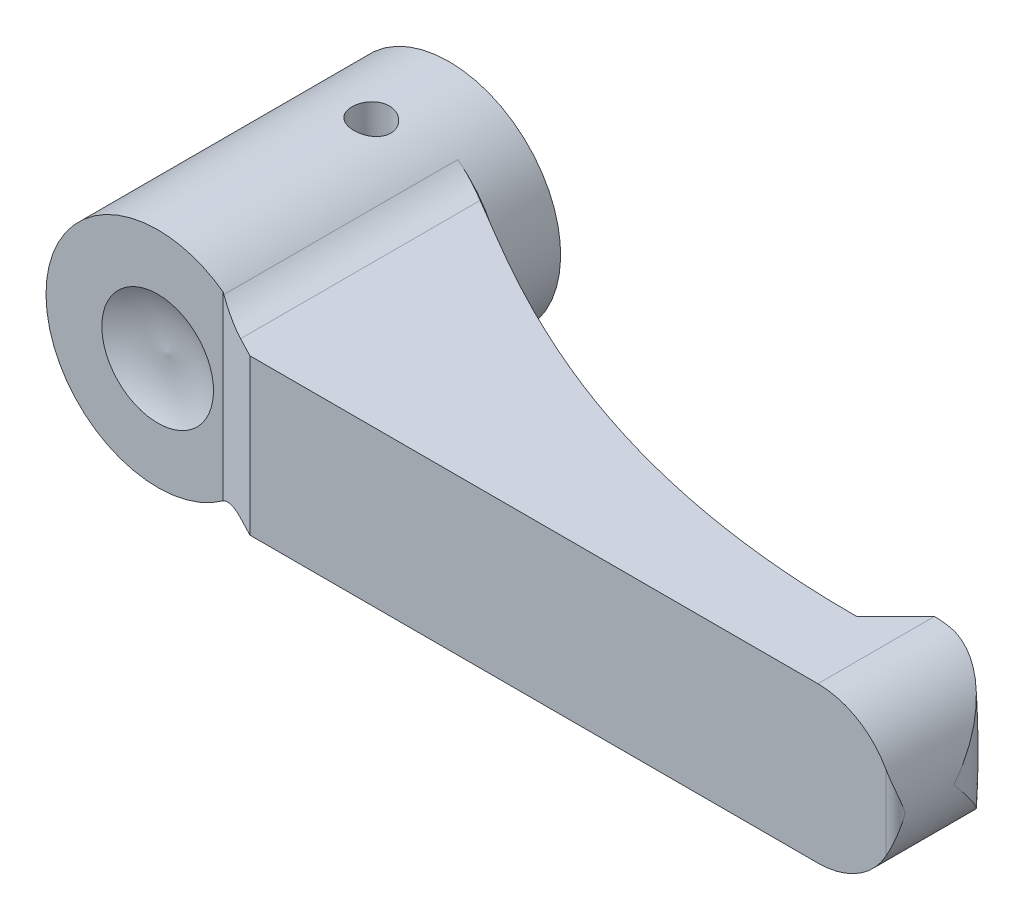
ISO-10303-21;
HEADER;
FILE_DESCRIPTION(('STEP AP214'),'2;1');
FILE_NAME('part.step','',(''),(''),'','','');
FILE_SCHEMA(('AUTOMOTIVE_DESIGN { 1 0 10303 214 1 1 1 1 }'));
ENDSEC;
DATA;
#1=APPLICATION_CONTEXT('core data for automotive mechanical design processes');
#2=APPLICATION_PROTOCOL_DEFINITION('international standard','automotive_design',2000,#1);
#3=PRODUCT_CONTEXT('',#1,'mechanical');
#4=PRODUCT('Part','Part','',(#3));
#5=PRODUCT_RELATED_PRODUCT_CATEGORY('part','',(#4));
#6=PRODUCT_DEFINITION_FORMATION('','',#4);
#7=PRODUCT_DEFINITION_CONTEXT('part definition',#1,'design');
#8=PRODUCT_DEFINITION('design','',#6,#7);
#9=PRODUCT_DEFINITION_SHAPE('','',#8);
#10=(LENGTH_UNIT() NAMED_UNIT(*) SI_UNIT(.MILLI.,.METRE.));
#11=(NAMED_UNIT(*) PLANE_ANGLE_UNIT() SI_UNIT($,.RADIAN.));
#12=(NAMED_UNIT(*) SI_UNIT($,.STERADIAN.) SOLID_ANGLE_UNIT());
#13=UNCERTAINTY_MEASURE_WITH_UNIT(LENGTH_MEASURE(1.E-05),#10,'distance_accuracy_value','');
#14=(GEOMETRIC_REPRESENTATION_CONTEXT(3) GLOBAL_UNCERTAINTY_ASSIGNED_CONTEXT((#13)) GLOBAL_UNIT_ASSIGNED_CONTEXT((#10,
#11,#12)) REPRESENTATION_CONTEXT('',''));
#15=CARTESIAN_POINT('',(0.,0.,0.));
#16=DIRECTION('',(0.,0.,1.));
#17=DIRECTION('',(1.,0.,0.));
#18=AXIS2_PLACEMENT_3D('',#15,#16,#17);
#19=CARTESIAN_POINT('',(70.,0.,0.));
#20=DIRECTION('',(0.,0.,1.));
#21=DIRECTION('',(0.,-1.,0.));
#22=AXIS2_PLACEMENT_3D('',#19,#20,#21);
#23=CYLINDRICAL_SURFACE('',#22,8.);
#24=CARTESIAN_POINT('',(78.0000000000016,0.,27.0000000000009));
#25=CARTESIAN_POINT('',(78.0000000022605,-0.00486120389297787,26.9960089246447));
#26=CARTESIAN_POINT('',(77.9999955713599,-0.00972252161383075,26.9920177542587));
#27=CARTESIAN_POINT('',(77.9989483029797,-0.58405443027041,26.5204877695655));
#28=CARTESIAN_POINT('',(77.9370711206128,-1.15500055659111,26.0517240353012));
#29=CARTESIAN_POINT('',(77.7514953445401,-1.99948975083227,25.3597836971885));
#30=CARTESIAN_POINT('',(77.6739526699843,-2.27949191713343,25.1306013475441));
#31=CARTESIAN_POINT('',(77.4870803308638,-2.83353834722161,24.6779396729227));
#32=CARTESIAN_POINT('',(77.3777660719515,-3.10758542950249,24.4544576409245));
#33=CARTESIAN_POINT('',(77.158011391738,-3.57947098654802,24.0707969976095));
#34=CARTESIAN_POINT('',(77.0547236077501,-3.77919112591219,23.9087940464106));
#35=CARTESIAN_POINT('',(76.8293579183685,-4.17268162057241,23.5906589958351));
#36=CARTESIAN_POINT('',(76.7072800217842,-4.36645197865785,23.434526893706));
#37=CARTESIAN_POINT('',(76.4440741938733,-4.74627991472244,23.1299270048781));
#38=CARTESIAN_POINT('',(76.3029817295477,-4.93235102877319,22.9814456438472));
#39=CARTESIAN_POINT('',(76.0012195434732,-5.29538728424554,22.6937634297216));
#40=CARTESIAN_POINT('',(75.8405556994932,-5.47235513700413,22.5545598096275));
#41=CARTESIAN_POINT('',(75.4165970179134,-5.89822057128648,22.2230365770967));
#42=CARTESIAN_POINT('',(75.1411575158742,-6.14067929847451,22.0374513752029));
#43=CARTESIAN_POINT('',(74.6952152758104,-6.47996071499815,21.7852421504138));
#44=CARTESIAN_POINT('',(74.5411204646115,-6.58897740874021,21.7055402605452));
#45=CARTESIAN_POINT('',(74.2221056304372,-6.7978022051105,21.5562519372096));
#46=CARTESIAN_POINT('',(74.057188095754,-6.89761241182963,21.4866631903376));
#47=CARTESIAN_POINT('',(73.7528561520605,-7.06680215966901,21.3726727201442));
#48=CARTESIAN_POINT('',(73.6153706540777,-7.13816743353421,21.3260516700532));
#49=CARTESIAN_POINT('',(73.3344178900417,-7.2736485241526,21.2410484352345));
#50=CARTESIAN_POINT('',(73.1909519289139,-7.3377659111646,21.2026644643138));
#51=CARTESIAN_POINT('',(72.8986978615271,-7.45804989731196,21.1350731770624));
#52=CARTESIAN_POINT('',(72.7499124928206,-7.51422051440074,21.1058612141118));
#53=CARTESIAN_POINT('',(72.4477810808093,-7.61799616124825,21.0575238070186));
#54=CARTESIAN_POINT('',(72.2944357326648,-7.66560248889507,21.0383968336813));
#55=CARTESIAN_POINT('',(72.004220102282,-7.74614579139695,21.0128670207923));
#56=CARTESIAN_POINT('',(71.8677702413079,-7.78018225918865,21.0051431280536));
#57=CARTESIAN_POINT('',(71.5930665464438,-7.84104076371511,20.9985383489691));
#58=CARTESIAN_POINT('',(71.4548130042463,-7.86786395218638,20.9996560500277));
#59=CARTESIAN_POINT('',(71.177661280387,-7.91409027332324,21.0111450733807));
#60=CARTESIAN_POINT('',(71.0387643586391,-7.93350434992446,21.0215026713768));
#61=CARTESIAN_POINT('',(70.7612209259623,-7.96492491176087,21.0517421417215));
#62=CARTESIAN_POINT('',(70.6225743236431,-7.97693515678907,21.0716191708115));
#63=CARTESIAN_POINT('',(70.4031503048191,-7.99025258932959,21.1109014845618));
#64=CARTESIAN_POINT('',(70.3219349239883,-7.99392882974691,21.1271639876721));
#65=CARTESIAN_POINT('',(70.1602682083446,-7.99880327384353,21.1630309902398));
#66=CARTESIAN_POINT('',(70.0798161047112,-8.00000431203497,21.1826316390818));
#67=CARTESIAN_POINT('',(69.9998,-7.9999999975,21.203909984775));
#68=B_SPLINE_CURVE_WITH_KNOTS('',3,(#24,#25,#26,#27,#28,#29,#30,#31,#32,#33,#34,#35,#36,#37,#38,
#39,#40,#41,#42,#43,#44,#45,#46,#47,#48,#49,#50,#51,#52,#53,#54,#55,#56,#57,#58,#59,#60,#61,#62,
#63,#64,#65,#66,#67),.UNSPECIFIED.,.F.,.F.,(4,2,2,2,2,2,2,2,2,2,2,2,2,2,2,2,2,2,2,2,2,4),(0.,
0.0188694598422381,2.22925012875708,3.33844824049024,4.44710941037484,5.27783212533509,
6.10855445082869,6.93774817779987,7.76669348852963,8.99514930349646,9.60925882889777,
10.223227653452,10.7080989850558,11.1928650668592,11.6773851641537,12.1618317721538,
12.5839133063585,13.0059274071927,13.4273157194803,13.8484898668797,14.0971192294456,
14.3454637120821),.UNSPECIFIED.);
#69=CARTESIAN_POINT('',(71.5774647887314,-7.84293343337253,21.));
#70=VERTEX_POINT('',#69);
#71=CARTESIAN_POINT('',(78.,0.,27.));
#72=VERTEX_POINT('',#71);
#73=EDGE_CURVE('E284',#70,#72,#68,.F.);
#74=ORIENTED_EDGE('',*,*,#73,.T.);
#75=CARTESIAN_POINT('',(78.0000000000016,0.,27.0000000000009));
#76=CARTESIAN_POINT('',(78.0000000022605,0.00486120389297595,26.9960089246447));
#77=CARTESIAN_POINT('',(77.9999955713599,0.00972252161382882,26.9920177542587));
#78=CARTESIAN_POINT('',(77.9989483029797,0.584054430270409,26.5204877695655));
#79=CARTESIAN_POINT('',(77.9370711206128,1.15500055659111,26.0517240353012));
#80=CARTESIAN_POINT('',(77.7514953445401,1.99948975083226,25.3597836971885));
#81=CARTESIAN_POINT('',(77.6739526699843,2.27949191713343,25.1306013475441));
#82=CARTESIAN_POINT('',(77.4870803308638,2.83353834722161,24.6779396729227));
#83=CARTESIAN_POINT('',(77.3777660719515,3.10758542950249,24.4544576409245));
#84=CARTESIAN_POINT('',(77.158011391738,3.57947098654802,24.0707969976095));
#85=CARTESIAN_POINT('',(77.0547236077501,3.77919112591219,23.9087940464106));
#86=CARTESIAN_POINT('',(76.8293579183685,4.17268162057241,23.5906589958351));
#87=CARTESIAN_POINT('',(76.7072800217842,4.36645197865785,23.434526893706));
#88=CARTESIAN_POINT('',(76.4440741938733,4.74627991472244,23.1299270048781));
#89=CARTESIAN_POINT('',(76.3029817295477,4.93235102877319,22.9814456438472));
#90=CARTESIAN_POINT('',(76.0012195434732,5.29538728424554,22.6937634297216));
#91=CARTESIAN_POINT('',(75.8405556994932,5.47235513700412,22.5545598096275));
#92=CARTESIAN_POINT('',(75.4165970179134,5.89822057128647,22.2230365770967));
#93=CARTESIAN_POINT('',(75.1411575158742,6.1406792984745,22.0374513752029));
#94=CARTESIAN_POINT('',(74.6952152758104,6.47996071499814,21.7852421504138));
#95=CARTESIAN_POINT('',(74.5411204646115,6.58897740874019,21.7055402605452));
#96=CARTESIAN_POINT('',(74.2221056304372,6.79780220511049,21.5562519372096));
#97=CARTESIAN_POINT('',(74.057188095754,6.89761241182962,21.4866631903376));
#98=CARTESIAN_POINT('',(73.7528561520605,7.06680215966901,21.3726727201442));
#99=CARTESIAN_POINT('',(73.6153706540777,7.13816743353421,21.3260516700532));
#100=CARTESIAN_POINT('',(73.3344178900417,7.2736485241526,21.2410484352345));
#101=CARTESIAN_POINT('',(73.1909519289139,7.3377659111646,21.2026644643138));
#102=CARTESIAN_POINT('',(72.8986978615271,7.45804989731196,21.1350731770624));
#103=CARTESIAN_POINT('',(72.7499124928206,7.51422051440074,21.1058612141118));
#104=CARTESIAN_POINT('',(72.4477810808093,7.61799616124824,21.0575238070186));
#105=CARTESIAN_POINT('',(72.2944357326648,7.66560248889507,21.0383968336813));
#106=CARTESIAN_POINT('',(72.004220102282,7.74614579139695,21.0128670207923));
#107=CARTESIAN_POINT('',(71.8677702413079,7.78018225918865,21.0051431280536));
#108=CARTESIAN_POINT('',(71.5930665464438,7.84104076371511,20.9985383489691));
#109=CARTESIAN_POINT('',(71.4548130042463,7.86786395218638,20.9996560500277));
#110=CARTESIAN_POINT('',(71.177661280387,7.91409027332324,21.0111450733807));
#111=CARTESIAN_POINT('',(71.0387643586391,7.93350434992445,21.0215026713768));
#112=CARTESIAN_POINT('',(70.7612209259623,7.96492491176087,21.0517421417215));
#113=CARTESIAN_POINT('',(70.6225743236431,7.97693515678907,21.0716191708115));
#114=CARTESIAN_POINT('',(70.4031503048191,7.99025258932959,21.1109014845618));
#115=CARTESIAN_POINT('',(70.3219349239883,7.99392882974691,21.1271639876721));
#116=CARTESIAN_POINT('',(70.1602682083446,7.99880327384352,21.1630309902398));
#117=CARTESIAN_POINT('',(70.0798161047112,8.00000431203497,21.1826316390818));
#118=CARTESIAN_POINT('',(69.9998,7.9999999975,21.203909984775));
#119=B_SPLINE_CURVE_WITH_KNOTS('',3,(#75,#76,#77,#78,#79,#80,#81,#82,#83,#84,#85,#86,#87,#88,
#89,#90,#91,#92,#93,#94,#95,#96,#97,#98,#99,#100,#101,#102,#103,#104,#105,#106,#107,#108,#109,
#110,#111,#112,#113,#114,#115,#116,#117,#118),.UNSPECIFIED.,.F.,.F.,(4,2,2,2,2,2,2,2,2,2,2,2,2,
2,2,2,2,2,2,2,2,4),(0.,0.0188694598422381,2.22925012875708,3.33844824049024,4.44710941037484,
5.27783212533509,6.10855445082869,6.93774817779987,7.76669348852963,8.99514930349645,
9.60925882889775,10.223227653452,10.7080989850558,11.1928650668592,11.6773851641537,
12.1618317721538,12.5839133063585,13.0059274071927,13.4273157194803,13.8484898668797,
14.0971192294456,14.3454637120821),.UNSPECIFIED.);
#120=CARTESIAN_POINT('',(71.5774647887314,7.84293343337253,21.));
#121=VERTEX_POINT('',#120);
#122=EDGE_CURVE('E160',#72,#121,#119,.T.);
#123=ORIENTED_EDGE('',*,*,#122,.T.);
#124=CARTESIAN_POINT('',(70.,0.,21.));
#125=DIRECTION('',(0.,0.,-1.));
#126=DIRECTION('',(0.,1.,0.));
#127=AXIS2_PLACEMENT_3D('',#124,#125,#126);
#128=CIRCLE('',#127,8.);
#129=CARTESIAN_POINT('',(70.,8.,21.));
#130=VERTEX_POINT('',#129);
#131=EDGE_CURVE('E348',#121,#130,#128,.F.);
#132=ORIENTED_EDGE('',*,*,#131,.T.);
#133=DIRECTION('',(0.,0.,1.));
#134=VECTOR('',#133,1.);
#135=CARTESIAN_POINT('',(70.,8.,0.));
#136=LINE('',#135,#134);
#137=CARTESIAN_POINT('',(70.,8.,33.));
#138=VERTEX_POINT('',#137);
#139=EDGE_CURVE('E316',#130,#138,#136,.T.);
#140=ORIENTED_EDGE('',*,*,#139,.T.);
#141=CARTESIAN_POINT('',(70.,0.,33.));
#142=DIRECTION('',(0.,0.,1.));
#143=DIRECTION('',(0.,-1.,0.));
#144=AXIS2_PLACEMENT_3D('',#141,#142,#143);
#145=CIRCLE('',#144,8.);
#146=CARTESIAN_POINT('',(77.,3.87298334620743,33.));
#147=VERTEX_POINT('',#146);
#148=EDGE_CURVE('E337',#147,#138,#145,.T.);
#149=ORIENTED_EDGE('',*,*,#148,.F.);
#150=CARTESIAN_POINT('',(77.,3.87298334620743,33.));
#151=CARTESIAN_POINT('',(77.0320487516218,3.8150611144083,32.9999909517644));
#152=CARTESIAN_POINT('',(77.0633658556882,3.75675902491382,32.9984605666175));
#153=CARTESIAN_POINT('',(77.1244803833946,3.63952511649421,32.9926983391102));
#154=CARTESIAN_POINT('',(77.1542784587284,3.58059358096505,32.9884676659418));
#155=CARTESIAN_POINT('',(77.241218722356,3.40324230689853,32.9722589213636));
#156=CARTESIAN_POINT('',(77.2960525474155,3.28400247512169,32.9567609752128));
#157=CARTESIAN_POINT('',(77.3991566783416,3.04456972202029,32.918521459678));
#158=CARTESIAN_POINT('',(77.4474555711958,2.92438355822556,32.8958129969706));
#159=CARTESIAN_POINT('',(77.5378429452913,2.68282861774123,32.8446429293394));
#160=CARTESIAN_POINT('',(77.5799268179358,2.56145903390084,32.8161770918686));
#161=CARTESIAN_POINT('',(77.6827368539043,2.24038507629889,32.7351721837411));
#162=CARTESIAN_POINT('',(77.7382927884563,2.03996193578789,32.6788382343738));
#163=CARTESIAN_POINT('',(77.8332865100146,1.63779800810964,32.5581494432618));
#164=CARTESIAN_POINT('',(77.8727175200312,1.43605670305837,32.4937912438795));
#165=CARTESIAN_POINT('',(77.967421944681,0.829293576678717,32.2932012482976));
#166=CARTESIAN_POINT('',(77.999127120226,0.422667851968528,32.1494356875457));
#167=CARTESIAN_POINT('',(77.9999940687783,0.0112434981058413,32.003975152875));
#168=CARTESIAN_POINT('',(77.9999999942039,0.00562166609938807,32.0019875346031));
#169=CARTESIAN_POINT('',(78.,0.,32.0000000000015));
#170=B_SPLINE_CURVE_WITH_KNOTS('',3,(#150,#151,#152,#153,#154,#155,#156,#157,#158,#159,#160,
#161,#162,#163,#164,#165,#166,#167,#168,#169),.UNSPECIFIED.,.F.,.F.,(4,2,2,2,2,2,2,2,2,4),(0.,
0.198535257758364,0.396984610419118,0.792983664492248,1.18719018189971,1.58168756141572,
2.22713013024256,2.87284368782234,4.16406208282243,4.18195063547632),.UNSPECIFIED.);
#171=CARTESIAN_POINT('',(78.,0.,32.0000000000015));
#172=VERTEX_POINT('',#171);
#173=EDGE_CURVE('E170',#172,#147,#170,.F.);
#174=ORIENTED_EDGE('',*,*,#173,.F.);
#175=CARTESIAN_POINT('',(77.,-3.87298334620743,33.));
#176=CARTESIAN_POINT('',(77.0320487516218,-3.8150611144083,32.9999909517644));
#177=CARTESIAN_POINT('',(77.0633658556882,-3.75675902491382,32.9984605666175));
#178=CARTESIAN_POINT('',(77.1244803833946,-3.63952511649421,32.9926983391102));
#179=CARTESIAN_POINT('',(77.1542784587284,-3.58059358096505,32.9884676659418));
#180=CARTESIAN_POINT('',(77.241218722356,-3.40324230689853,32.9722589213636));
#181=CARTESIAN_POINT('',(77.2960525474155,-3.28400247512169,32.9567609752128));
#182=CARTESIAN_POINT('',(77.3991566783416,-3.04456972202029,32.918521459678));
#183=CARTESIAN_POINT('',(77.4474555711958,-2.92438355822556,32.8958129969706));
#184=CARTESIAN_POINT('',(77.5378429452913,-2.68282861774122,32.8446429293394));
#185=CARTESIAN_POINT('',(77.5799268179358,-2.56145903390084,32.8161770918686));
#186=CARTESIAN_POINT('',(77.6827368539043,-2.24038507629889,32.7351721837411));
#187=CARTESIAN_POINT('',(77.7382927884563,-2.03996193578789,32.6788382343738));
#188=CARTESIAN_POINT('',(77.8332865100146,-1.63779800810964,32.5581494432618));
#189=CARTESIAN_POINT('',(77.8727175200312,-1.43605670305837,32.4937912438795));
#190=CARTESIAN_POINT('',(77.967421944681,-0.829293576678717,32.2932012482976));
#191=CARTESIAN_POINT('',(77.999127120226,-0.422667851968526,32.1494356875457));
#192=CARTESIAN_POINT('',(77.9999940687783,-0.0112434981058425,32.003975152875));
#193=CARTESIAN_POINT('',(77.9999999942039,-0.00562166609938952,32.0019875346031));
#194=CARTESIAN_POINT('',(78.,0.,32.0000000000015));
#195=B_SPLINE_CURVE_WITH_KNOTS('',3,(#175,#176,#177,#178,#179,#180,#181,#182,#183,#184,#185,
#186,#187,#188,#189,#190,#191,#192,#193,#194),.UNSPECIFIED.,.F.,.F.,(4,2,2,2,2,2,2,2,2,4),(0.,
0.198535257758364,0.396984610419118,0.792983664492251,1.18719018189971,1.58168756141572,
2.22713013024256,2.87284368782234,4.16406208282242,4.18195063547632),.UNSPECIFIED.);
#196=CARTESIAN_POINT('',(77.,-3.87298334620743,33.));
#197=VERTEX_POINT('',#196);
#198=EDGE_CURVE('E178',#197,#172,#195,.T.);
#199=ORIENTED_EDGE('',*,*,#198,.F.);
#200=CARTESIAN_POINT('',(70.,-8.,33.));
#201=VERTEX_POINT('',#200);
#202=EDGE_CURVE('E338',#201,#197,#145,.T.);
#203=ORIENTED_EDGE('',*,*,#202,.F.);
#204=DIRECTION('',(0.,0.,1.));
#205=VECTOR('',#204,1.);
#206=CARTESIAN_POINT('',(70.,-8.,0.));
#207=LINE('',#206,#205);
#208=CARTESIAN_POINT('',(70.,-8.,21.));
#209=VERTEX_POINT('',#208);
#210=EDGE_CURVE('E322',#209,#201,#207,.T.);
#211=ORIENTED_EDGE('',*,*,#210,.F.);
#212=EDGE_CURVE('E184',#209,#70,#128,.F.);
#213=ORIENTED_EDGE('',*,*,#212,.T.);
#214=EDGE_LOOP('',(#74,#123,#132,#140,#149,#174,#199,#203,#211,#213));
#215=FACE_BOUND('',#214,.T.);
#216=ADVANCED_FACE('F14',(#215),#23,.T.);
#217=CARTESIAN_POINT('',(72.,-16.,21.));
#218=DIRECTION('',(0.,0.,-1.));
#219=DIRECTION('',(0.,1.,0.));
#220=AXIS2_PLACEMENT_3D('',#217,#218,#219);
#221=PLANE('',#220);
#222=ORIENTED_EDGE('',*,*,#131,.F.);
#223=CARTESIAN_POINT('',(-1.,0.,21.));
#224=DIRECTION('',(0.,0.,-1.));
#225=DIRECTION('',(0.,1.,0.));
#226=AXIS2_PLACEMENT_3D('',#223,#224,#225);
#227=CIRCLE('',#226,72.999999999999);
#228=EDGE_CURVE('E43',#121,#70,#227,.T.);
#229=ORIENTED_EDGE('',*,*,#228,.T.);
#230=ORIENTED_EDGE('',*,*,#212,.F.);
#231=DIRECTION('',(0.,1.,0.));
#232=VECTOR('',#231,1.);
#233=CARTESIAN_POINT('',(70.,-16.,21.));
#234=LINE('',#233,#232);
#235=EDGE_CURVE('E306',#209,#130,#234,.T.);
#236=ORIENTED_EDGE('',*,*,#235,.T.);
#237=EDGE_LOOP('',(#222,#229,#230,#236));
#238=FACE_BOUND('',#237,.T.);
#239=ADVANCED_FACE('F139',(#238),#221,.T.);
#240=CARTESIAN_POINT('',(10.5,0.,0.));
#241=DIRECTION('',(0.,0.,1.));
#242=DIRECTION('',(0.,-1.,0.));
#243=AXIS2_PLACEMENT_3D('',#240,#241,#242);
#244=PLANE('',#243);
#245=CARTESIAN_POINT('',(0.,0.,0.));
#246=DIRECTION('',(0.,0.,-1.));
#247=DIRECTION('',(0.,1.,0.));
#248=AXIS2_PLACEMENT_3D('',#245,#246,#247);
#249=CIRCLE('',#248,5.);
#250=CARTESIAN_POINT('',(0.,5.,0.));
#251=VERTEX_POINT('',#250);
#252=EDGE_CURVE('E272',#251,#251,#249,.T.);
#253=ORIENTED_EDGE('',*,*,#252,.F.);
#254=EDGE_LOOP('',(#253));
#255=FACE_BOUND('',#254,.T.);
#256=CARTESIAN_POINT('',(-1.,0.,0.));
#257=DIRECTION('',(0.,0.,-1.));
#258=DIRECTION('',(0.,1.,0.));
#259=AXIS2_PLACEMENT_3D('',#256,#257,#258);
#260=CIRCLE('',#259,11.5);
#261=CARTESIAN_POINT('',(-1.,11.5,0.));
#262=VERTEX_POINT('',#261);
#263=EDGE_CURVE('E331',#262,#262,#260,.T.);
#264=ORIENTED_EDGE('',*,*,#263,.T.);
#265=EDGE_LOOP('',(#264));
#266=FACE_BOUND('',#265,.T.);
#267=ADVANCED_FACE('F145',(#255,#266),#244,.F.);
#268=CARTESIAN_POINT('',(0.,0.,33.));
#269=DIRECTION('',(0.,0.,1.));
#270=DIRECTION('',(0.,-1.,0.));
#271=AXIS2_PLACEMENT_3D('',#268,#269,#270);
#272=PLANE('',#271);
#273=DIRECTION('',(1.,0.,0.));
#274=VECTOR('',#273,1.);
#275=CARTESIAN_POINT('',(9.5,8.,33.));
#276=LINE('',#275,#274);
#277=CARTESIAN_POINT('',(11.5,8.,33.));
#278=VERTEX_POINT('',#277);
#279=EDGE_CURVE('E311',#278,#138,#276,.T.);
#280=ORIENTED_EDGE('',*,*,#279,.F.);
#281=DIRECTION('',(0.,1.,0.));
#282=VECTOR('',#281,1.);
#283=CARTESIAN_POINT('',(11.5,-16.,33.));
#284=LINE('',#283,#282);
#285=CARTESIAN_POINT('',(11.5,-8.,33.));
#286=VERTEX_POINT('',#285);
#287=EDGE_CURVE('E355',#286,#278,#284,.T.);
#288=ORIENTED_EDGE('',*,*,#287,.F.);
#289=DIRECTION('',(-1.,0.,0.));
#290=VECTOR('',#289,1.);
#291=CARTESIAN_POINT('',(70.,-8.,33.));
#292=LINE('',#291,#290);
#293=EDGE_CURVE('E375',#201,#286,#292,.T.);
#294=ORIENTED_EDGE('',*,*,#293,.F.);
#295=ORIENTED_EDGE('',*,*,#202,.T.);
#296=DIRECTION('',(0.,1.,0.));
#297=VECTOR('',#296,1.);
#298=CARTESIAN_POINT('',(77.,-16.,33.));
#299=LINE('',#298,#297);
#300=EDGE_CURVE('E353',#197,#147,#299,.T.);
#301=ORIENTED_EDGE('',*,*,#300,.T.);
#302=ORIENTED_EDGE('',*,*,#148,.T.);
#303=EDGE_LOOP('',(#280,#288,#294,#295,#301,#302));
#304=FACE_BOUND('',#303,.T.);
#305=ADVANCED_FACE('F251',(#304),#272,.T.);
#306=CARTESIAN_POINT('',(-1.,0.,0.));
#307=DIRECTION('',(0.,0.,-1.));
#308=DIRECTION('',(0.,1.,0.));
#309=AXIS2_PLACEMENT_3D('',#306,#307,#308);
#310=CYLINDRICAL_SURFACE('',#309,11.5);
#311=CARTESIAN_POINT('',(-1.,11.5,10.7320508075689));
#312=CARTESIAN_POINT('',(-1.09714914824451,11.4999992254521,10.6759567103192));
#313=CARTESIAN_POINT('',(-1.18962095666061,11.4987601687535,10.6116389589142));
#314=CARTESIAN_POINT('',(-1.36251431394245,11.4946116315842,10.4683944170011));
#315=CARTESIAN_POINT('',(-1.44292394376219,11.4917005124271,10.389453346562));
#316=CARTESIAN_POINT('',(-1.58932370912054,11.4851240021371,10.2192770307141));
#317=CARTESIAN_POINT('',(-1.65532247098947,11.4814590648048,10.1280491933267));
#318=CARTESIAN_POINT('',(-1.77109611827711,11.4742663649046,9.93584413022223));
#319=CARTESIAN_POINT('',(-1.82087420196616,11.4707385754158,9.83486883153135));
#320=CARTESIAN_POINT('',(-1.90293927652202,11.4645719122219,9.6256835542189));
#321=CARTESIAN_POINT('',(-1.93517623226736,11.4619355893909,9.51745385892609));
#322=CARTESIAN_POINT('',(-1.98101048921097,11.4581042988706,9.29708991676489));
#323=CARTESIAN_POINT('',(-1.9946077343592,11.4569093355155,9.18495565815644));
#324=CARTESIAN_POINT('',(-2.00275243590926,11.4561994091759,8.96034331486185));
#325=CARTESIAN_POINT('',(-1.99735918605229,11.4566792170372,8.84786739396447));
#326=CARTESIAN_POINT('',(-1.96781175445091,11.4592127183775,8.62542641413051));
#327=CARTESIAN_POINT('',(-1.94365752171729,11.4612664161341,8.51546136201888));
#328=CARTESIAN_POINT('',(-1.87731479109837,11.4665346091,8.30125059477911));
#329=CARTESIAN_POINT('',(-1.83514202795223,11.4697480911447,8.1969999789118));
#330=CARTESIAN_POINT('',(-1.73395928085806,11.476666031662,7.99703328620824));
#331=CARTESIAN_POINT('',(-1.67494875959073,11.480370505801,7.90131748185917));
#332=CARTESIAN_POINT('',(-1.54149876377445,11.4874386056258,7.72077051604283));
#333=CARTESIAN_POINT('',(-1.4670044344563,11.4908009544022,7.63597983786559));
#334=CARTESIAN_POINT('',(-1.30480939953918,11.4962454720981,7.48009088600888));
#335=CARTESIAN_POINT('',(-1.21710888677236,11.4983276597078,7.40899241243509));
#336=CARTESIAN_POINT('',(-1.03117338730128,11.500332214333,7.28265046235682));
#337=CARTESIAN_POINT('',(-0.932959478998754,11.5002588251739,7.22737604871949));
#338=CARTESIAN_POINT('',(-0.728692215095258,11.4972523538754,7.13409215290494));
#339=CARTESIAN_POINT('',(-0.622639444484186,11.4943194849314,7.09608138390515));
#340=CARTESIAN_POINT('',(-0.406751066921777,11.4851913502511,7.03864293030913));
#341=CARTESIAN_POINT('',(-0.296956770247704,11.4790249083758,7.01905526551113));
#342=CARTESIAN_POINT('',(-0.0758812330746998,11.463345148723,6.99835866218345));
#343=CARTESIAN_POINT('',(0.0353999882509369,11.4538318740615,6.9972494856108));
#344=CARTESIAN_POINT('',(0.256258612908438,11.4317159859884,7.01339777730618));
#345=CARTESIAN_POINT('',(0.36583663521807,11.4191145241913,7.03064840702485));
#346=CARTESIAN_POINT('',(0.580352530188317,11.391408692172,7.08287168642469));
#347=CARTESIAN_POINT('',(0.685289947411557,11.3763040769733,7.11784607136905));
#348=CARTESIAN_POINT('',(0.889443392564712,11.3441995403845,7.20516899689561));
#349=CARTESIAN_POINT('',(0.988536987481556,11.3271725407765,7.25779373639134));
#350=CARTESIAN_POINT('',(1.17649958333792,11.2925637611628,7.37878291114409));
#351=CARTESIAN_POINT('',(1.26536722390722,11.2749819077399,7.44714943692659));
#352=CARTESIAN_POINT('',(1.43192231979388,11.2402456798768,7.59910166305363));
#353=CARTESIAN_POINT('',(1.50939729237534,11.2231034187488,7.68292336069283));
#354=CARTESIAN_POINT('',(1.64914489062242,11.1909422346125,7.86277199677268));
#355=CARTESIAN_POINT('',(1.71141801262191,11.1759232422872,7.9587985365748));
#356=CARTESIAN_POINT('',(1.81839968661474,11.1494237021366,8.15960960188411));
#357=CARTESIAN_POINT('',(1.86324915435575,11.1379149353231,8.2643151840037));
#358=CARTESIAN_POINT('',(1.93460320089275,11.119329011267,8.48016998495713));
#359=CARTESIAN_POINT('',(1.96111194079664,11.1122508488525,8.59131773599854));
#360=CARTESIAN_POINT('',(1.99432687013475,11.1033461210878,8.81327006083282));
#361=CARTESIAN_POINT('',(2.00161112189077,11.1013662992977,8.92398215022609));
#362=CARTESIAN_POINT('',(1.99779302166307,11.1023980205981,9.14505767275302));
#363=CARTESIAN_POINT('',(1.98669268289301,11.1054090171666,9.25542114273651));
#364=CARTESIAN_POINT('',(1.94684221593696,11.1160482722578,9.47073760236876));
#365=CARTESIAN_POINT('',(1.91839252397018,11.1235979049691,9.57575041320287));
#366=CARTESIAN_POINT('',(1.84503054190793,11.142586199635,9.77947902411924));
#367=CARTESIAN_POINT('',(1.80011676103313,11.1540252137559,9.87819425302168));
#368=CARTESIAN_POINT('',(1.69425224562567,11.1800722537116,10.0684410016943));
#369=CARTESIAN_POINT('',(1.63303555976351,11.1947320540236,10.1598172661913));
#370=CARTESIAN_POINT('',(1.49667639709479,11.2259292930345,10.3311470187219));
#371=CARTESIAN_POINT('',(1.42153151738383,11.2424670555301,10.4110985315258));
#372=CARTESIAN_POINT('',(1.25682075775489,11.2767031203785,10.5598339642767));
#373=CARTESIAN_POINT('',(1.16688713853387,11.2944214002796,10.6282064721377));
#374=CARTESIAN_POINT('',(0.976722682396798,11.3292497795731,10.7489131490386));
#375=CARTESIAN_POINT('',(0.876491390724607,11.3463598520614,10.8012466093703));
#376=CARTESIAN_POINT('',(0.667422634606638,11.3789712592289,10.8887846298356));
#377=CARTESIAN_POINT('',(0.558513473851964,11.3944560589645,10.9238244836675));
#378=CARTESIAN_POINT('',(0.335958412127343,11.4226873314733,10.9748830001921));
#379=CARTESIAN_POINT('',(0.222312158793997,11.4354336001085,10.9909002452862));
#380=CARTESIAN_POINT('',(-0.00455740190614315,11.4573942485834,11.0031686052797));
#381=CARTESIAN_POINT('',(-0.117759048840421,11.4666612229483,10.9997278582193));
#382=CARTESIAN_POINT('',(-0.34211137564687,11.4817156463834,10.9737491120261));
#383=CARTESIAN_POINT('',(-0.453263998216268,11.4875065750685,10.9512302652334));
#384=CARTESIAN_POINT('',(-0.638132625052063,11.4945611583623,10.8971401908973));
#385=CARTESIAN_POINT('',(-0.71320955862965,11.4966567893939,10.8702069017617));
#386=CARTESIAN_POINT('',(-0.859644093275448,11.4993764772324,10.8075820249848));
#387=CARTESIAN_POINT('',(-0.931001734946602,11.5000005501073,10.7718905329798));
#388=CARTESIAN_POINT('',(-1.,11.5,10.7320508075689));
#389=B_SPLINE_CURVE_WITH_KNOTS('',3,(#311,#312,#313,#314,#315,#316,#317,#318,#319,#320,#321,
#322,#323,#324,#325,#326,#327,#328,#329,#330,#331,#332,#333,#334,#335,#336,#337,#338,#339,#340,
#341,#342,#343,#344,#345,#346,#347,#348,#349,#350,#351,#352,#353,#354,#355,#356,#357,#358,#359,
#360,#361,#362,#363,#364,#365,#366,#367,#368,#369,#370,#371,#372,#373,#374,#375,#376,#377,#378,
#379,#380,#381,#382,#383,#384,#385,#386,#387,#388),.UNSPECIFIED.,.T.,.F.,(4,2,2,2,2,2,2,2,2,2,2,
2,2,2,2,2,2,2,2,2,2,2,2,2,2,2,2,2,2,2,2,2,2,2,2,2,2,2,4),(0.,0.336250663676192,
0.672831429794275,1.00921016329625,1.34552253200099,1.68278925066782,2.0200569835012,
2.3562726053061,2.69248914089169,3.02841267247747,3.36434692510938,3.70149222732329,
4.03863260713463,4.37510928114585,4.71156087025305,5.04506309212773,5.3785610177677,
5.7119347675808,6.04534116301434,6.38422917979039,6.72316222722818,7.06777914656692,
7.41238481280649,7.75414234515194,8.09582231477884,8.42710463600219,8.75835068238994,
9.08401733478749,9.40971348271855,9.74108814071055,10.0725200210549,10.4139866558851,
10.7554683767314,11.100142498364,11.4448423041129,11.7840988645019,12.1230152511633,
12.3618332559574,12.6006486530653),.UNSPECIFIED.);
#390=CARTESIAN_POINT('',(-1.,11.5,10.7320508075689));
#391=VERTEX_POINT('',#390);
#392=EDGE_CURVE('E261',#391,#391,#389,.T.);
#393=ORIENTED_EDGE('',*,*,#392,.T.);
#394=EDGE_LOOP('',(#393));
#395=FACE_BOUND('',#394,.T.);
#396=CARTESIAN_POINT('',(-1.,0.,6.));
#397=DIRECTION('',(0.,0.,-1.));
#398=DIRECTION('',(0.,1.,0.));
#399=AXIS2_PLACEMENT_3D('',#396,#397,#398);
#400=CIRCLE('',#399,11.5);
#401=CARTESIAN_POINT('',(5.9,9.2,6.));
#402=VERTEX_POINT('',#401);
#403=CARTESIAN_POINT('',(5.9,-9.2,6.));
#404=VERTEX_POINT('',#403);
#405=EDGE_CURVE('E278',#402,#404,#400,.T.);
#406=ORIENTED_EDGE('',*,*,#405,.T.);
#407=DIRECTION('',(0.,0.,1.));
#408=VECTOR('',#407,1.);
#409=CARTESIAN_POINT('',(5.9,-9.2,0.));
#410=LINE('',#409,#408);
#411=CARTESIAN_POINT('',(5.9,-9.2,30.0782608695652));
#412=VERTEX_POINT('',#411);
#413=EDGE_CURVE('E378',#404,#412,#410,.T.);
#414=ORIENTED_EDGE('',*,*,#413,.T.);
#415=CARTESIAN_POINT('',(-1.,0.,26.4782608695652));
#416=DIRECTION('',(-0.46256600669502,0.,0.886584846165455));
#417=DIRECTION('',(-0.886584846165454,0.,-0.46256600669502));
#418=AXIS2_PLACEMENT_3D('',#415,#416,#417);
#419=ELLIPSE('',#418,12.9711217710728,11.5);
#420=CARTESIAN_POINT('',(5.75,-9.31061222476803,30.));
#421=VERTEX_POINT('',#420);
#422=EDGE_CURVE('E363',#421,#412,#419,.T.);
#423=ORIENTED_EDGE('',*,*,#422,.F.);
#424=CARTESIAN_POINT('',(-1.,0.,30.));
#425=DIRECTION('',(0.,0.,-1.));
#426=DIRECTION('',(0.,1.,0.));
#427=AXIS2_PLACEMENT_3D('',#424,#425,#426);
#428=CIRCLE('',#427,11.5);
#429=CARTESIAN_POINT('',(5.75,9.31061222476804,30.));
#430=VERTEX_POINT('',#429);
#431=EDGE_CURVE('E334',#421,#430,#428,.T.);
#432=ORIENTED_EDGE('',*,*,#431,.T.);
#433=CARTESIAN_POINT('',(5.9,9.2,30.0782608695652));
#434=VERTEX_POINT('',#433);
#435=EDGE_CURVE('E367',#434,#430,#419,.T.);
#436=ORIENTED_EDGE('',*,*,#435,.F.);
#437=DIRECTION('',(0.,0.,1.));
#438=VECTOR('',#437,1.);
#439=CARTESIAN_POINT('',(5.9,9.2,0.));
#440=LINE('',#439,#438);
#441=EDGE_CURVE('E324',#402,#434,#440,.T.);
#442=ORIENTED_EDGE('',*,*,#441,.F.);
#443=EDGE_LOOP('',(#406,#414,#423,#432,#436,#442));
#444=FACE_BOUND('',#443,.T.);
#445=ORIENTED_EDGE('',*,*,#263,.F.);
#446=EDGE_LOOP('',(#445));
#447=FACE_BOUND('',#446,.T.);
#448=ADVANCED_FACE('F249',(#395,#444,#447),#310,.T.);
#449=CARTESIAN_POINT('',(9.5,13.9999999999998,0.));
#450=DIRECTION('',(0.,0.,1.));
#451=DIRECTION('',(0.,-1.,0.));
#452=AXIS2_PLACEMENT_3D('',#449,#450,#451);
#453=CYLINDRICAL_SURFACE('',#452,5.99999999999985);
#454=DIRECTION('',(0.,0.,1.));
#455=VECTOR('',#454,1.);
#456=CARTESIAN_POINT('',(9.5,8.,0.));
#457=LINE('',#456,#455);
#458=CARTESIAN_POINT('',(9.5,8.,7.28758016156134));
#459=VERTEX_POINT('',#458);
#460=CARTESIAN_POINT('',(9.5,8.,31.9565217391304));
#461=VERTEX_POINT('',#460);
#462=EDGE_CURVE('E321',#459,#461,#457,.T.);
#463=ORIENTED_EDGE('',*,*,#462,.F.);
#464=CARTESIAN_POINT('',(9.5002,8.00000000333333,7.28769770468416));
#465=CARTESIAN_POINT('',(9.36624921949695,8.00000900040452,7.20899771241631));
#466=CARTESIAN_POINT('',(9.23131717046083,8.00447857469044,7.13187097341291));
#467=CARTESIAN_POINT('',(8.95955874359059,8.0228308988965,6.98168748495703));
#468=CARTESIAN_POINT('',(8.82272962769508,8.03672903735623,6.90863760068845));
#469=CARTESIAN_POINT('',(8.54589499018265,8.07467908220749,6.76687883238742));
#470=CARTESIAN_POINT('',(8.40587130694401,8.09886083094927,6.6982388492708));
#471=CARTESIAN_POINT('',(8.12504336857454,8.15790206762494,6.56778628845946));
#472=CARTESIAN_POINT('',(7.98423967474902,8.19275466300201,6.50596933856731));
#473=CARTESIAN_POINT('',(7.61960975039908,8.29753510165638,6.35682937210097));
#474=CARTESIAN_POINT('',(7.39546154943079,8.376050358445,6.27577478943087));
#475=CARTESIAN_POINT('',(7.06315288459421,8.51582708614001,6.17554167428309));
#476=CARTESIAN_POINT('',(6.95335074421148,8.56590854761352,6.14574498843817));
#477=CARTESIAN_POINT('',(6.73553957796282,8.67341703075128,6.09391983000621));
#478=CARTESIAN_POINT('',(6.62752971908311,8.7308405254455,6.07188764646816));
#479=CARTESIAN_POINT('',(6.4142266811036,8.85285815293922,6.03632129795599));
#480=CARTESIAN_POINT('',(6.30893267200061,8.91745006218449,6.02278450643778));
#481=CARTESIAN_POINT('',(6.10156963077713,9.0536655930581,6.00457439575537));
#482=CARTESIAN_POINT('',(5.999515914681,9.12531747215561,5.99993835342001));
#483=CARTESIAN_POINT('',(5.8998,9.20015000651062,6.00000000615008));
#484=B_SPLINE_CURVE_WITH_KNOTS('',3,(#464,#465,#466,#467,#468,#469,#470,#471,#472,#473,#474,
#475,#476,#477,#478,#479,#480,#481,#482,#483),.UNSPECIFIED.,.F.,.F.,(4,2,2,2,2,2,2,2,2,4),(0.,
0.466072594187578,0.932907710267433,1.40582084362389,1.87842915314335,2.62785798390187,
3.00040185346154,3.37276742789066,3.74501782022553,4.11882384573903),.UNSPECIFIED.);
#485=EDGE_CURVE('E236',#459,#402,#484,.T.);
#486=ORIENTED_EDGE('',*,*,#485,.T.);
#487=ORIENTED_EDGE('',*,*,#441,.T.);
#488=CARTESIAN_POINT('',(9.5,13.9999999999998,31.9565217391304));
#489=DIRECTION('',(-0.46256600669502,0.,0.886584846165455));
#490=DIRECTION('',(0.886584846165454,0.,0.46256600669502));
#491=AXIS2_PLACEMENT_3D('',#488,#489,#490);
#492=ELLIPSE('',#491,6.76754179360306,5.99999999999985);
#493=EDGE_CURVE('E370',#461,#434,#492,.F.);
#494=ORIENTED_EDGE('',*,*,#493,.F.);
#495=EDGE_LOOP('',(#463,#486,#487,#494));
#496=FACE_BOUND('',#495,.T.);
#497=ADVANCED_FACE('F245',(#496),#453,.F.);
#498=CARTESIAN_POINT('',(9.5,8.,0.));
#499=DIRECTION('',(0.,-1.,0.));
#500=DIRECTION('',(1.,0.,0.));
#501=AXIS2_PLACEMENT_3D('',#498,#499,#500);
#502=PLANE('',#501);
#503=CARTESIAN_POINT('',(66.9866570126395,8.,-65.4946214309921));
#504=DIRECTION('',(0.,-1.,0.));
#505=DIRECTION('',(1.,0.,0.));
#506=AXIS2_PLACEMENT_3D('',#503,#504,#505);
#507=CIRCLE('',#506,90.4999999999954);
#508=CARTESIAN_POINT('',(65.2494614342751,8.,24.9887038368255));
#509=VERTEX_POINT('',#508);
#510=CARTESIAN_POINT('',(66.,8.,25.));
#511=VERTEX_POINT('',#510);
#512=EDGE_CURVE('E312',#509,#511,#507,.F.);
#513=ORIENTED_EDGE('',*,*,#512,.F.);
#514=CARTESIAN_POINT('',(64.3297577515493,8.,24.6385207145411));
#515=CARTESIAN_POINT('',(64.2937982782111,8.,24.5955944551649));
#516=CARTESIAN_POINT('',(64.2614211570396,8.,24.5496163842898));
#517=CARTESIAN_POINT('',(64.2048093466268,8.,24.452845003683));
#518=CARTESIAN_POINT('',(64.1805837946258,8.,24.4020463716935));
#519=CARTESIAN_POINT('',(64.1410258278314,8.,24.2971043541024));
#520=CARTESIAN_POINT('',(64.125691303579,8.,24.242961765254));
#521=CARTESIAN_POINT('',(64.1043706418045,8.,24.1328801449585));
#522=CARTESIAN_POINT('',(64.098382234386,8.,24.076941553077));
#523=CARTESIAN_POINT('',(64.0959285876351,8.,23.9650457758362));
#524=CARTESIAN_POINT('',(64.0994311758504,8.,23.9090892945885));
#525=CARTESIAN_POINT('',(64.1157871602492,8.,23.7985589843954));
#526=CARTESIAN_POINT('',(64.1286408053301,8.,23.7439851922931));
#527=CARTESIAN_POINT('',(64.1633092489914,8.,23.6377955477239));
#528=CARTESIAN_POINT('',(64.1851193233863,8.,23.5861781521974));
#529=CARTESIAN_POINT('',(64.237060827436,8.,23.4873165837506));
#530=CARTESIAN_POINT('',(64.267192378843,8.,23.4400724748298));
#531=CARTESIAN_POINT('',(64.3350467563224,8.,23.3510795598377));
#532=CARTESIAN_POINT('',(64.3728008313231,8.,23.3093545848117));
#533=CARTESIAN_POINT('',(64.4547346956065,8.,23.2327813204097));
#534=CARTESIAN_POINT('',(64.4989146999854,8.,23.1979332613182));
#535=CARTESIAN_POINT('',(64.5927745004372,8.,23.1358436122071));
#536=CARTESIAN_POINT('',(64.6424904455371,8.,23.1086566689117));
#537=CARTESIAN_POINT('',(64.7457590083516,8.,23.0629517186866));
#538=CARTESIAN_POINT('',(64.799311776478,8.,23.0444340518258));
#539=CARTESIAN_POINT('',(64.909115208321,8.,23.016473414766));
#540=CARTESIAN_POINT('',(64.9653814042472,8.,23.0070914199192));
#541=CARTESIAN_POINT('',(65.0786909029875,8.,22.9978712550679));
#542=CARTESIAN_POINT('',(65.1357342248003,8.,22.9980333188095));
#543=CARTESIAN_POINT('',(65.2491835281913,8.,23.0079153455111));
#544=CARTESIAN_POINT('',(65.3055866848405,8.,23.0176677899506));
#545=CARTESIAN_POINT('',(65.4159521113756,8.,23.0465149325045));
#546=CARTESIAN_POINT('',(65.4699143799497,8.,23.0656096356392));
#547=CARTESIAN_POINT('',(65.5737856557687,8.,23.1125887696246));
#548=CARTESIAN_POINT('',(65.6236997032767,8.,23.1404620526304));
#549=CARTESIAN_POINT('',(65.7181068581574,8.,23.2042351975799));
#550=CARTESIAN_POINT('',(65.7626000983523,8.,23.2401348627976));
#551=CARTESIAN_POINT('',(65.8446445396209,8.,23.3187442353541));
#552=CARTESIAN_POINT('',(65.8822312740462,8.,23.3614168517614));
#553=CARTESIAN_POINT('',(65.9496467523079,8.,23.4525045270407));
#554=CARTESIAN_POINT('',(65.9794757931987,8.,23.5009193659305));
#555=CARTESIAN_POINT('',(66.030310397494,8.,23.6017550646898));
#556=CARTESIAN_POINT('',(66.0513759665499,8.,23.6541456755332));
#557=CARTESIAN_POINT('',(66.0843561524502,8.,23.7617319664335));
#558=CARTESIAN_POINT('',(66.0962710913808,8.,23.8169275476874));
#559=CARTESIAN_POINT('',(66.1105541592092,8.,23.9282249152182));
#560=CARTESIAN_POINT('',(66.1129754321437,8.,23.9843198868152));
#561=CARTESIAN_POINT('',(66.108346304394,8.,24.0961170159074));
#562=CARTESIAN_POINT('',(66.1012960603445,8.,24.1518191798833));
#563=CARTESIAN_POINT('',(66.0779553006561,8.,24.2611419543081));
#564=CARTESIAN_POINT('',(66.0616821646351,8.,24.314766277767));
#565=CARTESIAN_POINT('',(66.0203868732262,8.,24.418532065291));
#566=CARTESIAN_POINT('',(65.9953646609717,8.,24.4686735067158));
#567=CARTESIAN_POINT('',(65.9372236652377,8.,24.5641975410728));
#568=CARTESIAN_POINT('',(65.904083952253,8.,24.6095673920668));
#569=CARTESIAN_POINT('',(65.8306997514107,8.,24.6941413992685));
#570=CARTESIAN_POINT('',(65.7904550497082,8.,24.7333453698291));
#571=CARTESIAN_POINT('',(65.7037490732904,8.,24.8047291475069));
#572=CARTESIAN_POINT('',(65.6572520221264,8.,24.8368654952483));
#573=CARTESIAN_POINT('',(65.5595521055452,8.,24.8929384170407));
#574=CARTESIAN_POINT('',(65.5083490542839,8.,24.916874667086));
#575=CARTESIAN_POINT('',(65.4023120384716,8.,24.956037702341));
#576=CARTESIAN_POINT('',(65.3474554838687,8.,24.971203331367));
#577=CARTESIAN_POINT('',(65.2359817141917,8.,24.9921586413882));
#578=CARTESIAN_POINT('',(65.179364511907,8.,24.9979483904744));
#579=CARTESIAN_POINT('',(65.0656888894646,8.,25.0000031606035));
#580=CARTESIAN_POINT('',(65.0086296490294,8.,24.9962230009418));
#581=CARTESIAN_POINT('',(64.8959377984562,8.,24.9791421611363));
#582=CARTESIAN_POINT('',(64.8403055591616,8.,24.9658390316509));
#583=CARTESIAN_POINT('',(64.7320103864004,8.,24.9300573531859));
#584=CARTESIAN_POINT('',(64.6793508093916,8.,24.9075686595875));
#585=CARTESIAN_POINT('',(64.5786236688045,8.,24.8540471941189));
#586=CARTESIAN_POINT('',(64.5305506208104,8.,24.8230248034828));
#587=CARTESIAN_POINT('',(64.4569260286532,8.,24.7661317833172));
#588=CARTESIAN_POINT('',(64.4295801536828,8.,24.7425435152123));
#589=CARTESIAN_POINT('',(64.3775797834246,8.,24.6925659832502));
#590=CARTESIAN_POINT('',(64.3529252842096,8.,24.6661767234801));
#591=CARTESIAN_POINT('',(64.3297577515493,8.,24.6385207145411));
#592=B_SPLINE_CURVE_WITH_KNOTS('',3,(#514,#515,#516,#517,#518,#519,#520,#521,#522,#523,#524,
#525,#526,#527,#528,#529,#530,#531,#532,#533,#534,#535,#536,#537,#538,#539,#540,#541,#542,#543,
#544,#545,#546,#547,#548,#549,#550,#551,#552,#553,#554,#555,#556,#557,#558,#559,#560,#561,#562,
#563,#564,#565,#566,#567,#568,#569,#570,#571,#572,#573,#574,#575,#576,#577,#578,#579,#580,#581,
#582,#583,#584,#585,#586,#587,#588,#589,#590,#591),.UNSPECIFIED.,.T.,.F.,(4,2,2,2,2,2,2,2,2,2,2,
2,2,2,2,2,2,2,2,2,2,2,2,2,2,2,2,2,2,2,2,2,2,2,2,2,2,2,4),(0.,0.167862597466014,
0.335912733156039,0.503922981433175,0.671892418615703,0.839293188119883,1.00669841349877,
1.17401545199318,1.34133493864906,1.5093548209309,1.67738032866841,1.84657565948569,
2.01577762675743,2.18610133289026,2.35642921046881,2.52733596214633,2.69824280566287,
2.86893348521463,3.03961998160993,3.2094020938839,3.37917770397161,3.54777088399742,
3.7163581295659,3.88400029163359,4.05163968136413,4.21896421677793,4.38628983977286,
4.55405150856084,4.72181822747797,4.89058937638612,5.05936719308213,5.22930810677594,
5.39924778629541,5.56999126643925,5.74077867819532,5.91175522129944,6.08252468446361,
6.19067331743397,6.29882179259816),.UNSPECIFIED.);
#593=CARTESIAN_POINT('',(65.0998996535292,8.,24.999129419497));
#594=VERTEX_POINT('',#593);
#595=EDGE_CURVE('E35',#509,#594,#592,.T.);
#596=ORIENTED_EDGE('',*,*,#595,.T.);
#597=CARTESIAN_POINT('',(35.9789577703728,8.,20.1784765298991));
#598=CARTESIAN_POINT('',(34.5516939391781,8.,19.7039362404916));
#599=CARTESIAN_POINT('',(33.1353514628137,8.,19.1962185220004));
#600=CARTESIAN_POINT('',(30.3268539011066,8.,18.1171748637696));
#601=CARTESIAN_POINT('',(28.9347034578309,8.,17.5458368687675));
#602=CARTESIAN_POINT('',(26.8658677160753,8.,16.6439667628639));
#603=CARTESIAN_POINT('',(26.1793456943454,8.,16.3357969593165));
#604=CARTESIAN_POINT('',(24.8129147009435,8.,15.7051360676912));
#605=CARTESIAN_POINT('',(24.133005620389,8.,15.3826452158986));
#606=CARTESIAN_POINT('',(22.7800904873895,8.,14.724204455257));
#607=CARTESIAN_POINT('',(22.1070817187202,8.,14.3882601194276));
#608=CARTESIAN_POINT('',(20.7675596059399,8.,13.7036927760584));
#609=CARTESIAN_POINT('',(20.1010461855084,8.,13.3550699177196));
#610=CARTESIAN_POINT('',(18.7688903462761,8.,12.6434474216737));
#611=CARTESIAN_POINT('',(18.1032974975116,8.,12.2803551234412));
#612=CARTESIAN_POINT('',(16.7777620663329,8.,11.5439578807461));
#613=CARTESIAN_POINT('',(16.1178197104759,8.,11.1706525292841));
#614=CARTESIAN_POINT('',(14.8015486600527,8.,10.4152883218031));
#615=CARTESIAN_POINT('',(14.1452275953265,8.,10.0332162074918));
#616=CARTESIAN_POINT('',(13.1630807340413,8.,9.45626275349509));
#617=CARTESIAN_POINT('',(12.8361118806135,8.,9.26331859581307));
#618=CARTESIAN_POINT('',(12.182634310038,8.,8.87665223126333));
#619=CARTESIAN_POINT('',(11.8561255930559,8.,8.68293002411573));
#620=CARTESIAN_POINT('',(11.2049393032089,8.,8.29634806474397));
#621=CARTESIAN_POINT('',(10.8802612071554,8.,8.10348919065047));
#622=CARTESIAN_POINT('',(10.2305467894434,8.,7.71836770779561));
#623=CARTESIAN_POINT('',(9.90551046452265,8.,7.52610510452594));
#624=CARTESIAN_POINT('',(9.25430541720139,8.,7.14302485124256));
#625=CARTESIAN_POINT('',(8.92813610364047,8.,6.95220820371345));
#626=CARTESIAN_POINT('',(8.27416216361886,8.,6.57340660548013));
#627=CARTESIAN_POINT('',(7.94635757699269,8.,6.38542158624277));
#628=CARTESIAN_POINT('',(7.28930251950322,8.,6.01455249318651));
#629=CARTESIAN_POINT('',(6.96006048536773,8.,5.83165353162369));
#630=CARTESIAN_POINT('',(6.29790805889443,8.,5.4724744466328));
#631=CARTESIAN_POINT('',(5.96499721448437,8.,5.29619515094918));
#632=CARTESIAN_POINT('',(5.2946225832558,8.,4.95344643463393));
#633=CARTESIAN_POINT('',(4.95716451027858,8.,4.78696589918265));
#634=CARTESIAN_POINT('',(4.27588643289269,8.,4.46763805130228));
#635=CARTESIAN_POINT('',(3.93206869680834,8.,4.31478598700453));
#636=CARTESIAN_POINT('',(3.50899555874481,8.,4.14040806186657));
#637=CARTESIAN_POINT('',(3.43346265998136,8.,4.10979881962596));
#638=CARTESIAN_POINT('',(3.28200877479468,8.,4.04954238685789));
#639=CARTESIAN_POINT('',(3.20608776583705,8.,4.01989525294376));
#640=CARTESIAN_POINT('',(2.97770332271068,8.,3.93248861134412));
#641=CARTESIAN_POINT('',(2.82464367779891,8.,3.87627430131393));
#642=CARTESIAN_POINT('',(2.51689018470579,8.,3.76856278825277));
#643=CARTESIAN_POINT('',(2.36219653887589,8.,3.71706500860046));
#644=CARTESIAN_POINT('',(2.05112891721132,8.,3.61941358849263));
#645=CARTESIAN_POINT('',(1.89475499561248,8.,3.57325977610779));
#646=CARTESIAN_POINT('',(1.58249458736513,8.,3.48754812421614));
#647=CARTESIAN_POINT('',(1.42663054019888,8.,3.44790890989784));
#648=CARTESIAN_POINT('',(1.11338817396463,8.,3.37511768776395));
#649=CARTESIAN_POINT('',(0.956009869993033,8.,3.34196561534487));
#650=CARTESIAN_POINT('',(0.639887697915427,8.,3.28275414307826));
#651=CARTESIAN_POINT('',(0.481143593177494,8.,3.25669599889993));
#652=CARTESIAN_POINT('',(0.162590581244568,8.,3.2122171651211));
#653=CARTESIAN_POINT('',(0.00278172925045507,8.,3.19379608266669));
#654=CARTESIAN_POINT('',(-0.320131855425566,8.,3.16477135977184));
#655=CARTESIAN_POINT('',(-0.483248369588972,8.,3.15429770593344));
#656=CARTESIAN_POINT('',(-0.809807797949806,8.,3.14191503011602));
#657=CARTESIAN_POINT('',(-0.973250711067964,8.,3.1400059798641));
#658=CARTESIAN_POINT('',(-1.29997864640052,8.,3.14479972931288));
#659=CARTESIAN_POINT('',(-1.46326369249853,8.,3.15150091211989));
#660=CARTESIAN_POINT('',(-1.78926468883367,8.,3.17334608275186));
#661=CARTESIAN_POINT('',(-1.95198063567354,8.,3.18849012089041));
#662=CARTESIAN_POINT('',(-2.27821471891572,8.,3.22706995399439));
#663=CARTESIAN_POINT('',(-2.44172233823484,8.,3.25059412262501));
#664=CARTESIAN_POINT('',(-2.7674394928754,8.,3.30537382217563));
#665=CARTESIAN_POINT('',(-2.92964894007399,8.,3.33662987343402));
#666=CARTESIAN_POINT('',(-3.25252312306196,8.,3.40623497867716));
#667=CARTESIAN_POINT('',(-3.41318792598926,8.,3.44458372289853));
#668=CARTESIAN_POINT('',(-3.73282657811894,8.,3.52768229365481));
#669=CARTESIAN_POINT('',(-3.89180056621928,8.,3.57243158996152));
#670=CARTESIAN_POINT('',(-4.32321891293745,8.,3.70231881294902));
#671=CARTESIAN_POINT('',(-4.59396026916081,8.,3.79313154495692));
#672=CARTESIAN_POINT('',(-5.13050203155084,8.,3.98842599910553));
#673=CARTESIAN_POINT('',(-5.39630052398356,8.,4.0929128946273));
#674=CARTESIAN_POINT('',(-5.92379552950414,8.,4.31277582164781));
#675=CARTESIAN_POINT('',(-6.18548520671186,8.,4.42816813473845));
#676=CARTESIAN_POINT('',(-6.7049648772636,8.,4.66728461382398));
#677=CARTESIAN_POINT('',(-6.96275531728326,8.,4.79100781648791));
#678=CARTESIAN_POINT('',(-7.47650629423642,8.,5.04555064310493));
#679=CARTESIAN_POINT('',(-7.73244972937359,8.,5.17640460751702));
#680=CARTESIAN_POINT('',(-8.24174555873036,8.,5.44305320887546));
#681=CARTESIAN_POINT('',(-8.49509789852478,8.,5.5788479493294));
#682=CARTESIAN_POINT('',(-8.99957411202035,8.,5.85404167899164));
#683=CARTESIAN_POINT('',(-9.25069957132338,8.,5.99343777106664));
#684=CARTESIAN_POINT('',(-9.75140699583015,8.,6.27496201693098));
#685=CARTESIAN_POINT('',(-10.0009889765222,8.,6.41709014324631));
#686=CARTESIAN_POINT('',(-10.5022883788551,8.,6.70517278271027));
#687=CARTESIAN_POINT('',(-10.7539909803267,8.,6.85115303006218));
#688=CARTESIAN_POINT('',(-11.2566056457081,8.,7.14446943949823));
#689=CARTESIAN_POINT('',(-11.5075177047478,8.,7.29180560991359));
#690=CARTESIAN_POINT('',(-12.2596084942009,8.,7.73506461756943));
#691=CARTESIAN_POINT('',(-12.7600723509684,8.,8.03219759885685));
#692=CARTESIAN_POINT('',(-13.7594234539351,8.,8.62554653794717));
#693=CARTESIAN_POINT('',(-14.2583107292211,8.,8.92176245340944));
#694=CARTESIAN_POINT('',(-15.2573646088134,8.,9.5120290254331));
#695=CARTESIAN_POINT('',(-15.7575312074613,8.,9.80607969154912));
#696=CARTESIAN_POINT('',(-16.947902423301,8.,10.499875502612));
#697=CARTESIAN_POINT('',(-17.6390907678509,8.,10.8979395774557));
#698=CARTESIAN_POINT('',(-19.027209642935,8.,11.6839510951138));
#699=CARTESIAN_POINT('',(-19.7241401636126,8.,12.0718985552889));
#700=CARTESIAN_POINT('',(-21.1246595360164,8.,12.8356069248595));
#701=CARTESIAN_POINT('',(-21.8282483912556,8.,13.2113678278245));
#702=CARTESIAN_POINT('',(-23.2425883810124,8.,13.9491568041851));
#703=CARTESIAN_POINT('',(-23.9533394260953,8.,14.3111850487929));
#704=CARTESIAN_POINT('',(-25.3828772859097,8.,15.0206455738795));
#705=CARTESIAN_POINT('',(-26.1016706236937,8.,15.3680647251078));
#706=CARTESIAN_POINT('',(-27.5467196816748,8.,16.0470305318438));
#707=CARTESIAN_POINT('',(-28.2729754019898,8.,16.3785771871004));
#708=CARTESIAN_POINT('',(-29.7328930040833,8.,17.0250504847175));
#709=CARTESIAN_POINT('',(-30.4665551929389,8.,17.3399764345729));
#710=CARTESIAN_POINT('',(-31.9410564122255,8.,17.9525638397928));
#711=CARTESIAN_POINT('',(-32.681895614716,8.,18.2502248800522));
#712=CARTESIAN_POINT('',(-34.90957848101,8.,19.1144597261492));
#713=CARTESIAN_POINT('',(-36.4067947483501,8.,19.6545972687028));
#714=CARTESIAN_POINT('',(-39.4259015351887,8.,20.6606757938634));
#715=CARTESIAN_POINT('',(-40.9477918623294,8.,21.126617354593));
#716=CARTESIAN_POINT('',(-44.0132819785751,8.,21.9818615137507));
#717=CARTESIAN_POINT('',(-45.556885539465,8.,22.3711506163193));
#718=CARTESIAN_POINT('',(-48.6618480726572,8.,23.070989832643));
#719=CARTESIAN_POINT('',(-50.2232069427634,8.,23.3815403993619));
#720=CARTESIAN_POINT('',(-53.2905098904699,8.,23.9104403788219));
#721=CARTESIAN_POINT('',(-54.7958570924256,8.,24.1322551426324));
#722=CARTESIAN_POINT('',(-57.8156365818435,8.,24.5015552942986));
#723=CARTESIAN_POINT('',(-59.3300687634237,8.,24.6490415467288));
#724=CARTESIAN_POINT('',(-62.3642364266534,8.,24.8689590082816));
#725=CARTESIAN_POINT('',(-63.8839714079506,8.,24.941397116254));
#726=CARTESIAN_POINT('',(-66.9251696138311,8.,25.0107863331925));
#727=CARTESIAN_POINT('',(-68.4466328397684,8.,25.0077373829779));
#728=CARTESIAN_POINT('',(-71.4866556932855,8.,24.925963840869));
#729=CARTESIAN_POINT('',(-73.0052164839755,8.,24.84728253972));
#730=CARTESIAN_POINT('',(-76.0365474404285,8.,24.6143263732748));
#731=CARTESIAN_POINT('',(-77.5493175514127,8.,24.4600507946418));
#732=CARTESIAN_POINT('',(-80.5651380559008,8.,24.0761672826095));
#733=CARTESIAN_POINT('',(-82.0681892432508,8.,23.8465655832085));
#734=CARTESIAN_POINT('',(-85.0608932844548,8.,23.3124886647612));
#735=CARTESIAN_POINT('',(-86.5505466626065,8.,23.0080163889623));
#736=CARTESIAN_POINT('',(-89.2902868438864,8.,22.3761762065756));
#737=CARTESIAN_POINT('',(-90.5427610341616,8.,22.0591100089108));
#738=CARTESIAN_POINT('',(-93.0331817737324,8.,21.3718886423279));
#739=CARTESIAN_POINT('',(-94.2711271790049,8.,21.0017293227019));
#740=CARTESIAN_POINT('',(-96.7298279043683,8.,20.2090660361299));
#741=CARTESIAN_POINT('',(-97.9505870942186,8.,19.7865740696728));
#742=CARTESIAN_POINT('',(-100.373092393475,8.,18.8898689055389));
#743=CARTESIAN_POINT('',(-101.574836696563,8.,18.4156508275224));
#744=CARTESIAN_POINT('',(-103.956818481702,8.,17.4164329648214));
#745=CARTESIAN_POINT('',(-105.137059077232,8.,16.8914406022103));
#746=CARTESIAN_POINT('',(-107.474163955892,8.,15.7914942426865));
#747=CARTESIAN_POINT('',(-108.631025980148,8.,15.2165354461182));
#748=CARTESIAN_POINT('',(-110.919058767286,8.,14.0177664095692));
#749=CARTESIAN_POINT('',(-112.050231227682,8.,13.3939594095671));
#750=CARTESIAN_POINT('',(-114.284993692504,8.,12.098519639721));
#751=CARTESIAN_POINT('',(-115.388581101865,8.,11.4268823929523));
#752=CARTESIAN_POINT('',(-117.55321514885,8.,10.0452283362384));
#753=CARTESIAN_POINT('',(-118.614609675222,8.,9.33575651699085));
#754=CARTESIAN_POINT('',(-120.706563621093,8.,7.87253037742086));
#755=CARTESIAN_POINT('',(-121.737120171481,8.,7.118771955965));
#756=CARTESIAN_POINT('',(-123.765351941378,8.,5.56843155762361));
#757=CARTESIAN_POINT('',(-124.763030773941,8.,4.77185431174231));
#758=CARTESIAN_POINT('',(-126.723851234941,8.,3.13722065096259));
#759=CARTESIAN_POINT('',(-127.686989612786,8.,2.29916034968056));
#760=CARTESIAN_POINT('',(-130.521560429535,8.,-0.274715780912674));
#761=CARTESIAN_POINT('',(-132.338920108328,8.,-2.07081672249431));
#762=CARTESIAN_POINT('',(-135.815066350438,8.,-5.80997139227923));
#763=CARTESIAN_POINT('',(-137.47385258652,8.,-7.75302542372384));
#764=CARTESIAN_POINT('',(-140.61668413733,8.,-11.7666404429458));
#765=CARTESIAN_POINT('',(-142.101223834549,8.,-13.8368139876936));
#766=CARTESIAN_POINT('',(-144.89042665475,8.,-18.0949516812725));
#767=CARTESIAN_POINT('',(-146.195090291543,8.,-20.282915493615));
#768=CARTESIAN_POINT('',(-148.615292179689,8.,-24.7611881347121));
#769=CARTESIAN_POINT('',(-149.730822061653,8.,-27.0515014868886));
#770=CARTESIAN_POINT('',(-151.764700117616,8.,-31.7180678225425));
#771=CARTESIAN_POINT('',(-152.683048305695,8.,-34.0943207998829));
#772=CARTESIAN_POINT('',(-154.315047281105,8.,-38.9130373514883));
#773=CARTESIAN_POINT('',(-155.028934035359,8.,-41.3554210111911));
#774=CARTESIAN_POINT('',(-156.248332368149,8.,-46.2916618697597));
#775=CARTESIAN_POINT('',(-156.753844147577,8.,-48.7855190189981));
#776=CARTESIAN_POINT('',(-157.552876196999,8.,-53.8069153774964));
#777=CARTESIAN_POINT('',(-157.846400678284,8.,-56.3344539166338));
#778=CARTESIAN_POINT('',(-158.21937890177,8.,-61.4052770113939));
#779=CARTESIAN_POINT('',(-158.298832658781,8.,-63.9485615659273));
#780=CARTESIAN_POINT('',(-158.243114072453,8.,-69.0317049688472));
#781=CARTESIAN_POINT('',(-158.108032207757,8.,-71.5715648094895));
#782=CARTESIAN_POINT('',(-157.62437543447,8.,-76.630874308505));
#783=CARTESIAN_POINT('',(-157.275800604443,8.,-79.1503239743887));
#784=CARTESIAN_POINT('',(-156.367643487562,8.,-84.1509074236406));
#785=CARTESIAN_POINT('',(-155.808060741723,8.,-86.6320411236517));
#786=CARTESIAN_POINT('',(-154.481879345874,8.,-91.5383516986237));
#787=CARTESIAN_POINT('',(-153.715280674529,8.,-93.9635285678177));
#788=CARTESIAN_POINT('',(-151.980541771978,8.,-98.7406746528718));
#789=CARTESIAN_POINT('',(-151.012403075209,8.,-101.092644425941));
#790=CARTESIAN_POINT('',(-148.88148496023,8.,-105.706691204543));
#791=CARTESIAN_POINT('',(-147.718705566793,8.,-107.968768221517));
#792=CARTESIAN_POINT('',(-145.206789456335,8.,-112.386987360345));
#793=CARTESIAN_POINT('',(-143.857651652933,8.,-114.543128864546));
#794=CARTESIAN_POINT('',(-140.982641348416,8.,-118.734172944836));
#795=CARTESIAN_POINT('',(-139.456768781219,8.,-120.769075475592));
#796=CARTESIAN_POINT('',(-136.238475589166,8.,-124.704068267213));
#797=CARTESIAN_POINT('',(-134.545984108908,8.,-126.604100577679));
#798=CARTESIAN_POINT('',(-131.007067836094,8.,-130.254947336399));
#799=CARTESIAN_POINT('',(-129.160643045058,8.,-132.005761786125));
#800=CARTESIAN_POINT('',(-125.327055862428,8.,-135.345775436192));
#801=CARTESIAN_POINT('',(-123.339896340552,8.,-136.934977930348));
#802=CARTESIAN_POINT('',(-119.238966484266,8.,-139.940620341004));
#803=CARTESIAN_POINT('',(-117.125196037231,8.,-141.357060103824));
#804=CARTESIAN_POINT('',(-112.783644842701,8.,-144.008732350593));
#805=CARTESIAN_POINT('',(-110.555740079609,8.,-145.24376183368));
#806=CARTESIAN_POINT('',(-106.004071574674,8.,-147.522094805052));
#807=CARTESIAN_POINT('',(-103.680307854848,8.,-148.565398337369));
#808=CARTESIAN_POINT('',(-98.9529454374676,8.,-150.453230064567));
#809=CARTESIAN_POINT('',(-96.5493440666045,8.,-151.297751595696));
#810=CARTESIAN_POINT('',(-92.8977826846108,8.,-152.41094407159));
#811=CARTESIAN_POINT('',(-91.6727346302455,8.,-152.75644602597));
#812=CARTESIAN_POINT('',(-89.20925514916,8.,-153.395754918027));
#813=CARTESIAN_POINT('',(-87.9708249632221,8.,-153.689566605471));
#814=CARTESIAN_POINT('',(-85.4791798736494,8.,-154.225793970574));
#815=CARTESIAN_POINT('',(-84.2259326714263,8.,-154.468059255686));
#816=CARTESIAN_POINT('',(-81.7104828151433,8.,-154.899743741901));
#817=CARTESIAN_POINT('',(-80.4482809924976,8.,-155.089167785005));
#818=CARTESIAN_POINT('',(-77.9169367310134,8.,-155.414945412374));
#819=CARTESIAN_POINT('',(-76.6477936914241,8.,-155.551294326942));
#820=CARTESIAN_POINT('',(-74.1050293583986,8.,-155.770730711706));
#821=CARTESIAN_POINT('',(-72.8314084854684,8.,-155.853823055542));
#822=CARTESIAN_POINT('',(-70.28171079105,8.,-155.966722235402));
#823=CARTESIAN_POINT('',(-69.0056337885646,8.,-155.996524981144));
#824=CARTESIAN_POINT('',(-66.4534638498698,8.,-156.002897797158));
#825=CARTESIAN_POINT('',(-65.1773709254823,8.,-155.979472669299));
#826=CARTESIAN_POINT('',(-62.6271489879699,8.,-155.879578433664));
#827=CARTESIAN_POINT('',(-61.3530201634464,8.,-155.803104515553));
#828=CARTESIAN_POINT('',(-58.8091419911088,8.,-155.597423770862));
#829=CARTESIAN_POINT('',(-57.5393922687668,8.,-155.468221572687));
#830=CARTESIAN_POINT('',(-54.9948160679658,8.,-155.156112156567));
#831=CARTESIAN_POINT('',(-53.7200480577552,8.,-154.972728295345));
#832=CARTESIAN_POINT('',(-51.1793112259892,8.,-154.553324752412));
#833=CARTESIAN_POINT('',(-49.9133417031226,8.,-154.317309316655));
#834=CARTESIAN_POINT('',(-47.3921324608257,8.,-153.793379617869));
#835=CARTESIAN_POINT('',(-46.1368932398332,8.,-153.505462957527));
#836=CARTESIAN_POINT('',(-43.6392133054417,8.,-152.878681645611));
#837=CARTESIAN_POINT('',(-42.3967725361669,8.,-152.539817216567));
#838=CARTESIAN_POINT('',(-39.9278000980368,8.,-151.81266375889));
#839=CARTESIAN_POINT('',(-38.7012537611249,8.,-151.424424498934));
#840=CARTESIAN_POINT('',(-36.2644989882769,8.,-150.599680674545));
#841=CARTESIAN_POINT('',(-35.0542906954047,8.,-150.163175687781));
#842=CARTESIAN_POINT('',(-32.6519091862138,8.,-149.243769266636));
#843=CARTESIAN_POINT('',(-31.4597326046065,8.,-148.760876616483));
#844=CARTESIAN_POINT('',(-29.0943442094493,8.,-147.750932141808));
#845=CARTESIAN_POINT('',(-27.9211313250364,8.,-147.223882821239));
#846=CARTESIAN_POINT('',(-25.6436012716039,8.,-146.151882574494));
#847=CARTESIAN_POINT('',(-24.5384759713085,8.,-145.608646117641));
#848=CARTESIAN_POINT('',(-22.8940025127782,8.,-144.76834457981));
#849=CARTESIAN_POINT('',(-22.3480925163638,8.,-144.484027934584));
#850=CARTESIAN_POINT('',(-21.2604384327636,8.,-143.907513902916));
#851=CARTESIAN_POINT('',(-20.7186943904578,8.,-143.615316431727));
#852=CARTESIAN_POINT('',(-19.6393960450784,8.,-143.023953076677));
#853=CARTESIAN_POINT('',(-19.1018397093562,8.,-142.724790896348));
#854=CARTESIAN_POINT('',(-18.0302001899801,8.,-142.120306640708));
#855=CARTESIAN_POINT('',(-17.4961170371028,8.,-141.814984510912));
#856=CARTESIAN_POINT('',(-16.4307912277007,8.,-141.199429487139));
#857=CARTESIAN_POINT('',(-15.899548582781,8.,-140.889196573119));
#858=CARTESIAN_POINT('',(-14.8389775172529,8.,-140.265479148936));
#859=CARTESIAN_POINT('',(-14.3096491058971,8.,-139.951994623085));
#860=CARTESIAN_POINT('',(-13.4938958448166,8.,-139.467933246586));
#861=CARTESIAN_POINT('',(-13.2072798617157,8.,-139.297677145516));
#862=CARTESIAN_POINT('',(-12.6339101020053,8.,-138.957397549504));
#863=CARTESIAN_POINT('',(-12.3471563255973,8.,-138.787374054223));
#864=CARTESIAN_POINT('',(-11.7731047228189,8.,-138.448124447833));
#865=CARTESIAN_POINT('',(-11.4858068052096,8.,-138.278898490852));
#866=CARTESIAN_POINT('',(-10.9102815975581,8.,-137.942023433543));
#867=CARTESIAN_POINT('',(-10.6220542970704,8.,-137.774374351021));
#868=CARTESIAN_POINT('',(-10.0437075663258,8.,-137.441350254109));
#869=CARTESIAN_POINT('',(-9.75358594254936,8.,-137.275979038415));
#870=CARTESIAN_POINT('',(-9.17123864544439,8.,-136.948988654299));
#871=CARTESIAN_POINT('',(-8.87901302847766,8.,-136.787369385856));
#872=CARTESIAN_POINT('',(-8.29178884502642,8.,-136.469517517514));
#873=CARTESIAN_POINT('',(-7.99679147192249,8.,-136.313282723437));
#874=CARTESIAN_POINT('',(-7.4029457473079,8.,-136.00816598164));
#875=CARTESIAN_POINT('',(-7.10409687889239,8.,-135.859285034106));
#876=CARTESIAN_POINT('',(-6.48694637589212,8.,-135.564620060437));
#877=CARTESIAN_POINT('',(-6.16840390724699,8.,-135.419335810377));
#878=CARTESIAN_POINT('',(-5.52486159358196,8.,-135.143969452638));
#879=CARTESIAN_POINT('',(-5.1998639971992,8.,-135.013882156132));
#880=CARTESIAN_POINT('',(-4.54333392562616,8.,-134.774492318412));
#881=CARTESIAN_POINT('',(-4.21182497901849,8.,-134.665126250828));
#882=CARTESIAN_POINT('',(-3.54112608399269,8.,-134.473019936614));
#883=CARTESIAN_POINT('',(-3.20193938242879,8.,-134.390268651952));
#884=CARTESIAN_POINT('',(-2.58393777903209,8.,-134.27079867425));
#885=CARTESIAN_POINT('',(-2.30626151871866,8.,-134.228247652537));
#886=CARTESIAN_POINT('',(-1.74826058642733,8.,-134.167313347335));
#887=CARTESIAN_POINT('',(-1.46793646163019,8.,-134.148925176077));
#888=CARTESIAN_POINT('',(-0.907335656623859,8.,-134.137647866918));
#889=CARTESIAN_POINT('',(-0.627060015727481,8.,-134.144707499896));
#890=CARTESIAN_POINT('',(-0.0682121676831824,8.,-134.183700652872));
#891=CARTESIAN_POINT('',(0.210359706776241,8.,-134.215638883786));
#892=CARTESIAN_POINT('',(0.678323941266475,8.,-134.288813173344));
#893=CARTESIAN_POINT('',(0.868676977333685,8.,-134.324127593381));
#894=CARTESIAN_POINT('',(1.24730878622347,8.,-134.404563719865));
#895=CARTESIAN_POINT('',(1.43558729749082,8.,-134.449686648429));
#896=CARTESIAN_POINT('',(1.99712317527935,8.,-134.598151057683));
#897=CARTESIAN_POINT('',(2.3669576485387,8.,-134.714567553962));
#898=CARTESIAN_POINT('',(2.91611813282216,8.,-134.90925887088));
#899=CARTESIAN_POINT('',(3.099037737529,8.,-134.977849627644));
#900=CARTESIAN_POINT('',(3.46267137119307,8.,-135.120693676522));
#901=CARTESIAN_POINT('',(3.64338536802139,8.,-135.19494705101));
#902=CARTESIAN_POINT('',(4.00270806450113,8.,-135.348205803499));
#903=CARTESIAN_POINT('',(4.18131737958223,8.,-135.427209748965));
#904=CARTESIAN_POINT('',(4.53668637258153,8.,-135.589233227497));
#905=CARTESIAN_POINT('',(4.71344616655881,8.,-135.672252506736));
#906=CARTESIAN_POINT('',(5.28387260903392,8.,-135.946819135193));
#907=CARTESIAN_POINT('',(5.67429385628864,8.,-136.145104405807));
#908=CARTESIAN_POINT('',(6.44932832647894,8.,-136.552758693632));
#909=CARTESIAN_POINT('',(6.83394028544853,8.,-136.762130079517));
#910=CARTESIAN_POINT('',(7.59945700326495,8.,-137.188117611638));
#911=CARTESIAN_POINT('',(7.98035905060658,8.,-137.40473860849));
#912=CARTESIAN_POINT('',(8.73965551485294,8.,-137.842235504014));
#913=CARTESIAN_POINT('',(9.1180501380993,8.,-138.063111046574));
#914=CARTESIAN_POINT('',(9.87413404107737,8.,-138.507446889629));
#915=CARTESIAN_POINT('',(10.2518212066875,8.,-138.730910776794));
#916=CARTESIAN_POINT('',(11.0067782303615,8.,-139.178554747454));
#917=CARTESIAN_POINT('',(11.3840480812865,8.,-139.402734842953));
#918=CARTESIAN_POINT('',(12.1387072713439,8.,-139.850573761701));
#919=CARTESIAN_POINT('',(12.5160965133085,8.,-140.074232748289));
#920=CARTESIAN_POINT('',(13.2716553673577,8.,-140.52022562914));
#921=CARTESIAN_POINT('',(13.6498249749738,8.,-140.742559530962));
#922=CARTESIAN_POINT('',(14.4058957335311,8.,-141.184356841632));
#923=CARTESIAN_POINT('',(14.7837923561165,8.,-141.403827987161));
#924=CARTESIAN_POINT('',(15.5410581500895,8.,-141.840214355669));
#925=CARTESIAN_POINT('',(15.9204273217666,8.,-142.057129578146));
#926=CARTESIAN_POINT('',(17.0611689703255,8.,-142.703382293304));
#927=CARTESIAN_POINT('',(17.8251186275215,8.,-143.128193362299));
#928=CARTESIAN_POINT('',(19.3607525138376,8.,-143.96280375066));
#929=CARTESIAN_POINT('',(20.1324331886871,8.,-144.372609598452));
#930=CARTESIAN_POINT('',(21.6844937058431,8.,-145.175479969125));
#931=CARTESIAN_POINT('',(22.4648737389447,8.,-145.56854412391));
#932=CARTESIAN_POINT('',(23.8809060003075,8.,-146.261282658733));
#933=CARTESIAN_POINT('',(24.5149837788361,8.,-146.56417577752));
#934=CARTESIAN_POINT('',(25.7888997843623,8.,-147.157569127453));
#935=CARTESIAN_POINT('',(26.4287379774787,8.,-147.448069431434));
#936=CARTESIAN_POINT('',(28.3568843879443,8.,-148.300225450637));
#937=CARTESIAN_POINT('',(29.6538211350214,8.,-148.842534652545));
#938=CARTESIAN_POINT('',(32.2695965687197,8.,-149.872348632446));
#939=CARTESIAN_POINT('',(33.5884400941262,8.,-150.359841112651));
#940=CARTESIAN_POINT('',(36.2459385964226,8.,-151.277472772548));
#941=CARTESIAN_POINT('',(37.5845932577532,8.,-151.707612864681));
#942=CARTESIAN_POINT('',(40.2876132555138,8.,-152.511037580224));
#943=CARTESIAN_POINT('',(41.6520846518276,8.,-152.883965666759));
#944=CARTESIAN_POINT('',(44.396385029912,8.,-153.568312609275));
#945=CARTESIAN_POINT('',(45.7762140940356,8.,-153.879731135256));
#946=CARTESIAN_POINT('',(48.5486341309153,8.,-154.439846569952));
#947=CARTESIAN_POINT('',(49.941225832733,8.,-154.688539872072));
#948=CARTESIAN_POINT('',(52.7362947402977,8.,-155.122217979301));
#949=CARTESIAN_POINT('',(54.1387718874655,8.,-155.307203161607));
#950=CARTESIAN_POINT('',(56.9149698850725,8.,-155.608849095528));
#951=CARTESIAN_POINT('',(58.2885151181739,8.,-155.727127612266));
#952=CARTESIAN_POINT('',(61.0395266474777,8.,-155.901993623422));
#953=CARTESIAN_POINT('',(62.4169929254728,8.,-155.95858140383));
#954=CARTESIAN_POINT('',(65.1730273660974,8.,-156.009750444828));
#955=CARTESIAN_POINT('',(66.5515954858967,8.,-156.004334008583));
#956=CARTESIAN_POINT('',(69.3070881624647,8.,-155.931349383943));
#957=CARTESIAN_POINT('',(70.6840127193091,8.,-155.863781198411));
#958=CARTESIAN_POINT('',(73.4297651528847,8.,-155.666760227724));
#959=CARTESIAN_POINT('',(74.7986048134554,8.,-155.537471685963));
#960=CARTESIAN_POINT('',(77.5290579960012,8.,-155.217232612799));
#961=CARTESIAN_POINT('',(78.8906714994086,8.,-155.026281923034));
#962=CARTESIAN_POINT('',(81.6038349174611,8.,-154.583026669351));
#963=CARTESIAN_POINT('',(82.9553851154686,8.,-154.33072383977));
#964=CARTESIAN_POINT('',(85.6456704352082,8.,-153.76520521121));
#965=CARTESIAN_POINT('',(86.9844057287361,8.,-153.451990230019));
#966=CARTESIAN_POINT('',(89.5619552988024,8.,-152.786992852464));
#967=CARTESIAN_POINT('',(90.8017260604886,8.,-152.43891167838));
#968=CARTESIAN_POINT('',(93.265471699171,8.,-151.690375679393));
#969=CARTESIAN_POINT('',(94.4894452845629,8.,-151.289916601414));
#970=CARTESIAN_POINT('',(96.9190932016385,8.,-150.437394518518));
#971=CARTESIAN_POINT('',(98.1247700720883,8.,-149.985338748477));
#972=CARTESIAN_POINT('',(100.515923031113,8.,-149.030318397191));
#973=CARTESIAN_POINT('',(101.70139719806,8.,-148.527349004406));
#974=CARTESIAN_POINT('',(104.050552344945,8.,-147.471113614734));
#975=CARTESIAN_POINT('',(105.214220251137,8.,-146.917818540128));
#976=CARTESIAN_POINT('',(107.517041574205,8.,-145.762106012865));
#977=CARTESIAN_POINT('',(108.656192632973,8.,-145.159683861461));
#978=CARTESIAN_POINT('',(110.907687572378,8.,-143.90689176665));
#979=CARTESIAN_POINT('',(112.020033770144,8.,-143.256525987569));
#980=CARTESIAN_POINT('',(114.216092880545,8.,-141.908902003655));
#981=CARTESIAN_POINT('',(115.299803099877,8.,-141.211639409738));
#982=CARTESIAN_POINT('',(117.426286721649,8.,-139.778413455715));
#983=CARTESIAN_POINT('',(118.469352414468,8.,-139.042883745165));
#984=CARTESIAN_POINT('',(120.523566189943,8.,-137.52834234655));
#985=CARTESIAN_POINT('',(121.534711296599,8.,-136.749326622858));
#986=CARTESIAN_POINT('',(123.523083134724,8.,-135.149317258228));
#987=CARTESIAN_POINT('',(124.500313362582,8.,-134.328327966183));
#988=CARTESIAN_POINT('',(126.419227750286,8.,-132.645761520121));
#989=CARTESIAN_POINT('',(127.360908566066,8.,-131.784180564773));
#990=CARTESIAN_POINT('',(130.129422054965,8.,-129.141380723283));
#991=CARTESIAN_POINT('',(131.900738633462,8.,-127.301289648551));
#992=CARTESIAN_POINT('',(135.281300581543,8.,-123.478255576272));
#993=CARTESIAN_POINT('',(136.890545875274,8.,-121.495312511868));
#994=CARTESIAN_POINT('',(139.931722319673,8.,-117.405840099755));
#995=CARTESIAN_POINT('',(141.364109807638,8.,-115.29965039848));
#996=CARTESIAN_POINT('',(144.046171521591,8.,-110.974013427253));
#997=CARTESIAN_POINT('',(145.295846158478,8.,-108.754566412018));
#998=CARTESIAN_POINT('',(147.603640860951,8.,-104.218051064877));
#999=CARTESIAN_POINT('',(148.6617497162,8.,-101.900977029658));
#1000=CARTESIAN_POINT('',(150.578748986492,8.,-97.185834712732));
#1001=CARTESIAN_POINT('',(151.437639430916,8.,-94.7877664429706));
#1002=CARTESIAN_POINT('',(152.949235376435,8.,-89.9303716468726));
#1003=CARTESIAN_POINT('',(153.602164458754,8.,-87.4711146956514));
#1004=CARTESIAN_POINT('',(154.698448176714,8.,-82.5063255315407));
#1005=CARTESIAN_POINT('',(155.141802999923,8.,-80.0007933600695));
#1006=CARTESIAN_POINT('',(155.815764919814,8.,-74.9613439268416));
#1007=CARTESIAN_POINT('',(156.046377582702,8.,-72.4274274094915));
#1008=CARTESIAN_POINT('',(156.293228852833,8.,-67.3491735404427));
#1009=CARTESIAN_POINT('',(156.309467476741,8.,-64.8048361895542));
#1010=CARTESIAN_POINT('',(156.12749135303,8.,-59.7248627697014));
#1011=CARTESIAN_POINT('',(155.929362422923,8.,-57.1892236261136));
#1012=CARTESIAN_POINT('',(155.320199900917,8.,-52.1436505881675));
#1013=CARTESIAN_POINT('',(154.90916638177,8.,-49.6337166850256));
#1014=CARTESIAN_POINT('',(153.87710640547,8.,-44.6572985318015));
#1015=CARTESIAN_POINT('',(153.256071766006,8.,-42.190815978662));
#1016=CARTESIAN_POINT('',(151.808443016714,8.,-37.3189307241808));
#1017=CARTESIAN_POINT('',(150.981848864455,8.,-34.9135280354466));
#1018=CARTESIAN_POINT('',(149.128927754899,8.,-30.1807170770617));
#1019=CARTESIAN_POINT('',(148.10258597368,8.,-27.8533146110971));
#1020=CARTESIAN_POINT('',(145.85752919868,8.,-23.2932216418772));
#1021=CARTESIAN_POINT('',(144.638814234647,8.,-21.0605311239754));
#1022=CARTESIAN_POINT('',(142.017881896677,8.,-16.7060070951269));
#1023=CARTESIAN_POINT('',(140.615689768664,8.,-14.58415838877));
#1024=CARTESIAN_POINT('',(137.63766786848,8.,-10.4660289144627));
#1025=CARTESIAN_POINT('',(136.061838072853,8.,-8.46974816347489));
#1026=CARTESIAN_POINT('',(132.747268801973,8.,-4.61630754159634));
#1027=CARTESIAN_POINT('',(131.008480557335,8.,-2.75918961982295));
#1028=CARTESIAN_POINT('',(127.380794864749,8.,0.802127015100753));
#1029=CARTESIAN_POINT('',(125.491897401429,8.,2.50632571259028));
#1030=CARTESIAN_POINT('',(121.576533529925,8.,5.75052828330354));
#1031=CARTESIAN_POINT('',(119.550005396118,8.,7.29045767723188));
#1032=CARTESIAN_POINT('',(115.374687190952,8.,10.1943629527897));
#1033=CARTESIAN_POINT('',(113.225896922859,8.,11.5583385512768));
#1034=CARTESIAN_POINT('',(108.817397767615,8.,14.1030033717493));
#1035=CARTESIAN_POINT('',(106.557516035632,8.,15.2833942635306));
#1036=CARTESIAN_POINT('',(103.099829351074,8.,16.9080440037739));
#1037=CARTESIAN_POINT('',(101.935795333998,8.,17.4253308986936));
#1038=CARTESIAN_POINT('',(99.5870231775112,8.,18.4104595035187));
#1039=CARTESIAN_POINT('',(98.4022869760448,8.,18.8783058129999));
#1040=CARTESIAN_POINT('',(96.0156263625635,8.,19.7632262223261));
#1041=CARTESIAN_POINT('',(94.8137240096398,8.,20.1803598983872));
#1042=CARTESIAN_POINT('',(92.3935762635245,8.,20.9637760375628));
#1043=CARTESIAN_POINT('',(91.1753323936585,8.,21.3300632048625));
#1044=CARTESIAN_POINT('',(88.7244559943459,8.,22.0112495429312));
#1045=CARTESIAN_POINT('',(87.4918222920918,8.,22.3261444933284));
#1046=CARTESIAN_POINT('',(85.0145557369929,8.,22.9039762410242));
#1047=CARTESIAN_POINT('',(83.7699239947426,8.,23.1669177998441));
#1048=CARTESIAN_POINT('',(81.2677787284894,8.,23.6410326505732));
#1049=CARTESIAN_POINT('',(80.0102416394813,8.,23.852081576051));
#1050=CARTESIAN_POINT('',(77.4875439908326,8.,24.221275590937));
#1051=CARTESIAN_POINT('',(76.2223841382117,8.,24.3794255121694));
#1052=CARTESIAN_POINT('',(73.6863787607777,8.,24.6426644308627));
#1053=CARTESIAN_POINT('',(72.4155324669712,8.,24.7477460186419));
#1054=CARTESIAN_POINT('',(69.8706764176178,8.,24.9047142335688));
#1055=CARTESIAN_POINT('',(68.5966669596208,8.,24.9566056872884));
#1056=CARTESIAN_POINT('',(66.0439308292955,8.,25.007300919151));
#1057=CARTESIAN_POINT('',(64.765201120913,8.,25.0059517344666));
#1058=CARTESIAN_POINT('',(62.2090275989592,8.,24.9499242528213));
#1059=CARTESIAN_POINT('',(60.9315836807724,8.,24.8952507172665));
#1060=CARTESIAN_POINT('',(58.380257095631,8.,24.7328490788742));
#1061=CARTESIAN_POINT('',(57.1063739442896,8.,24.6251285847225));
#1062=CARTESIAN_POINT('',(54.5642749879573,8.,24.3570344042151));
#1063=CARTESIAN_POINT('',(53.2960587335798,8.,24.1966649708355));
#1064=CARTESIAN_POINT('',(50.6638824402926,8.,23.8085366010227));
#1065=CARTESIAN_POINT('',(49.300574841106,8.,23.5763388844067));
#1066=CARTESIAN_POINT('',(46.5861255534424,8.,23.0518920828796));
#1067=CARTESIAN_POINT('',(45.2349794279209,8.,22.7596659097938));
#1068=CARTESIAN_POINT('',(42.5571198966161,8.,22.1186561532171));
#1069=CARTESIAN_POINT('',(41.2302984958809,8.,21.7703249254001));
#1070=CARTESIAN_POINT('',(39.2519820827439,8.,21.2051784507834));
#1071=CARTESIAN_POINT('',(38.594341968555,8.,21.00962569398));
#1072=CARTESIAN_POINT('',(37.2833628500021,8.,20.6045090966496));
#1073=CARTESIAN_POINT('',(36.63002402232,8.,20.3949446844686));
#1074=CARTESIAN_POINT('',(35.9789577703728,8.,20.1784765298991));
#1075=B_SPLINE_CURVE_WITH_KNOTS('',3,(#597,#598,#599,#600,#601,#602,#603,#604,#605,#606,#607,
#608,#609,#610,#611,#612,#613,#614,#615,#616,#617,#618,#619,#620,#621,#622,#623,#624,#625,#626,
#627,#628,#629,#630,#631,#632,#633,#634,#635,#636,#637,#638,#639,#640,#641,#642,#643,#644,#645,
#646,#647,#648,#649,#650,#651,#652,#653,#654,#655,#656,#657,#658,#659,#660,#661,#662,#663,#664,
#665,#666,#667,#668,#669,#670,#671,#672,#673,#674,#675,#676,#677,#678,#679,#680,#681,#682,#683,
#684,#685,#686,#687,#688,#689,#690,#691,#692,#693,#694,#695,#696,#697,#698,#699,#700,#701,#702,
#703,#704,#705,#706,#707,#708,#709,#710,#711,#712,#713,#714,#715,#716,#717,#718,#719,#720,#721,
#722,#723,#724,#725,#726,#727,#728,#729,#730,#731,#732,#733,#734,#735,#736,#737,#738,#739,#740,
#741,#742,#743,#744,#745,#746,#747,#748,#749,#750,#751,#752,#753,#754,#755,#756,#757,#758,#759,
#760,#761,#762,#763,#764,#765,#766,#767,#768,#769,#770,#771,#772,#773,#774,#775,#776,#777,#778,
#779,#780,#781,#782,#783,#784,#785,#786,#787,#788,#789,#790,#791,#792,#793,#794,#795,#796,#797,
#798,#799,#800,#801,#802,#803,#804,#805,#806,#807,#808,#809,#810,#811,#812,#813,#814,#815,#816,
#817,#818,#819,#820,#821,#822,#823,#824,#825,#826,#827,#828,#829,#830,#831,#832,#833,#834,#835,
#836,#837,#838,#839,#840,#841,#842,#843,#844,#845,#846,#847,#848,#849,#850,#851,#852,#853,#854,
#855,#856,#857,#858,#859,#860,#861,#862,#863,#864,#865,#866,#867,#868,#869,#870,#871,#872,#873,
#874,#875,#876,#877,#878,#879,#880,#881,#882,#883,#884,#885,#886,#887,#888,#889,#890,#891,#892,
#893,#894,#895,#896,#897,#898,#899,#900,#901,#902,#903,#904,#905,#906,#907,#908,#909,#910,#911,
#912,#913,#914,#915,#916,#917,#918,#919,#920,#921,#922,#923,#924,#925,#926,#927,#928,#929,#930,
#931,#932,#933,#934,#935,#936,#937,#938,#939,#940,#941,#942,#943,#944,#945,#946,#947,#948,#949,
#950,#951,#952,#953,#954,#955,#956,#957,#958,#959,#960,#961,#962,#963,#964,#965,#966,#967,#968,
#969,#970,#971,#972,#973,#974,#975,#976,#977,#978,#979,#980,#981,#982,#983,#984,#985,#986,#987,
#988,#989,#990,#991,#992,#993,#994,#995,#996,#997,#998,#999,#1000,#1001,#1002,#1003,#1004,#1005,
#1006,#1007,#1008,#1009,#1010,#1011,#1012,#1013,#1014,#1015,#1016,#1017,#1018,#1019,#1020,#1021,
#1022,#1023,#1024,#1025,#1026,#1027,#1028,#1029,#1030,#1031,#1032,#1033,#1034,#1035,#1036,#1037,
#1038,#1039,#1040,#1041,#1042,#1043,#1044,#1045,#1046,#1047,#1048,#1049,#1050,#1051,#1052,#1053,
#1054,#1055,#1056,#1057,#1058,#1059,#1060,#1061,#1062,#1063,#1064,#1065,#1066,#1067,#1068,#1069,
#1070,#1071,#1072,#1073,#1074),.UNSPECIFIED.,.T.,.F.,(4,2,2,2,2,2,2,2,2,2,2,2,2,2,2,2,2,2,2,2,2,
2,2,2,2,2,2,2,2,2,2,2,2,2,2,2,2,2,2,2,2,2,2,2,2,2,2,2,2,2,2,2,2,2,2,2,2,2,2,2,2,2,2,2,2,2,2,2,2,
2,2,2,2,2,2,2,2,2,2,2,2,2,2,2,2,2,2,2,2,2,2,2,2,2,2,2,2,2,2,2,2,2,2,2,2,2,2,2,2,2,2,2,2,2,2,2,2,
2,2,2,2,2,2,2,2,2,2,2,2,2,2,2,2,2,2,2,2,2,2,2,2,2,2,2,2,2,2,2,2,2,2,2,2,2,2,2,2,2,2,2,2,2,2,2,2,
2,2,2,2,2,2,2,2,2,2,2,2,2,2,2,2,2,2,2,2,2,2,2,2,2,2,2,2,2,2,2,2,2,2,2,2,2,2,2,2,2,2,2,2,2,2,2,2,
2,2,2,2,2,2,2,2,2,2,2,2,2,2,2,2,2,2,2,2,2,2,2,2,2,4),(0.,4.51207256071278,9.02500156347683,
11.2824119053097,13.5397850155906,15.7962325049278,18.052653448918,20.3271150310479,
22.6016673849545,24.8799218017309,26.0188790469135,27.1578367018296,28.2907507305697,
29.4236751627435,30.5573239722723,31.6909453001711,32.820795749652,33.9507870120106,
35.0794707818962,36.2077594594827,36.4522524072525,36.6967597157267,37.1858561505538,
37.6748927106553,38.1639135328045,38.6462647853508,39.1286112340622,39.6110430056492,
40.0934499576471,40.5835864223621,41.0737212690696,41.5637640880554,42.0538098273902,
42.549184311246,43.04459214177,43.5399783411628,44.0353235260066,44.8915139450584,
45.7480292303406,46.6058441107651,47.4635599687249,48.3258521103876,49.1881623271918,
50.0497992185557,50.9114274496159,51.7843359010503,52.657249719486,54.40331840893,
56.1439188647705,57.884511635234,60.277305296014,62.6700948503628,65.0628856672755,
67.4556466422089,69.8505139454,72.2453812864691,74.6403483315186,77.035372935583,
81.8083467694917,86.5812834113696,91.3550596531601,96.1288084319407,100.691796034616,
105.254730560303,109.817245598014,114.379764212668,118.939672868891,123.499624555,
128.059198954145,132.618594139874,136.493412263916,140.368533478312,144.242767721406,
148.117367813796,151.991402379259,155.865809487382,159.739959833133,163.614473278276,
167.443368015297,171.272617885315,175.101445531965,178.930632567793,186.586102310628,
194.241587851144,201.874799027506,209.507988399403,217.141515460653,224.775041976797,
232.399722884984,240.024396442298,247.648918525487,255.273440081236,262.89474691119,
270.516050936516,278.137371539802,285.758692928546,293.379956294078,301.001218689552,
308.622525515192,316.24383519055,323.86839997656,331.492964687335,339.11737397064,
346.7417900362,354.374673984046,362.007556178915,369.640694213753,373.458289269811,
377.275533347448,381.103766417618,384.931648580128,388.75986745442,392.587735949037,
396.415898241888,400.243715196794,404.071879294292,407.89970743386,411.762266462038,
415.624513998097,419.486939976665,423.349349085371,427.207895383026,431.066475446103,
434.924326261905,438.781958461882,442.475538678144,444.322017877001,446.168516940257,
448.01405558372,449.859610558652,451.705173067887,453.550744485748,454.550856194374,
455.550966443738,456.55126263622,457.551570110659,458.553381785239,459.555166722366,
460.556538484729,461.558046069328,462.608090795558,463.657775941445,464.70418899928,
465.750167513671,466.591983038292,467.433628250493,468.273580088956,469.113691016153,
469.694233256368,470.274847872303,471.436450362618,472.022468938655,472.608496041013,
473.194347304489,473.780161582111,475.093505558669,476.407131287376,477.721654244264,
479.036067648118,480.352595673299,481.66914588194,482.985204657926,484.3012559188,
485.612262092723,486.923268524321,489.545479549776,492.166535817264,494.787649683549,
496.895643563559,499.003625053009,503.219599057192,507.436517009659,511.653367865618,
515.895514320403,520.137683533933,524.380096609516,528.622484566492,532.756995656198,
536.891487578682,541.025825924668,545.16016408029,549.283561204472,553.406968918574,
557.530260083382,561.653495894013,565.515473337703,569.377764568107,573.239514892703,
577.101630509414,580.965991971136,584.830723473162,588.695119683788,592.55987806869,
596.387693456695,600.215864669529,604.043640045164,607.871774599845,615.524155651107,
623.17654028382,630.808747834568,638.440938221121,646.073575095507,653.706210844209,
661.33053224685,668.954846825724,676.578961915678,684.203076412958,691.824139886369,
699.445200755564,707.066558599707,714.687918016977,722.309843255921,729.931767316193,
737.552643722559,745.173521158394,752.796686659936,760.419852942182,768.046460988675,
775.673081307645,783.311968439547,787.132439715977,790.952555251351,794.768138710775,
798.583368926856,802.398912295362,806.214105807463,810.038355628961,813.862256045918,
817.686690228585,821.510777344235,825.345852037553,829.180584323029,833.014766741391,
836.848639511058,840.996066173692,845.141912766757,849.255867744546,851.314028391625,
853.372273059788),.UNSPECIFIED.);
#1076=EDGE_CURVE('E231',#594,#459,#1075,.T.);
#1077=ORIENTED_EDGE('',*,*,#1076,.T.);
#1078=ORIENTED_EDGE('',*,*,#462,.T.);
#1079=DIRECTION('',(-0.886584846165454,0.,-0.46256600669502));
#1080=VECTOR('',#1079,1.);
#1081=CARTESIAN_POINT('',(-3.60549777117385,8.,25.1188707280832));
#1082=LINE('',#1081,#1080);
#1083=EDGE_CURVE('E366',#278,#461,#1082,.T.);
#1084=ORIENTED_EDGE('',*,*,#1083,.F.);
#1085=ORIENTED_EDGE('',*,*,#279,.T.);
#1086=ORIENTED_EDGE('',*,*,#139,.F.);
#1087=DIRECTION('',(0.707106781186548,0.,-0.707106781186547));
#1088=VECTOR('',#1087,1.);
#1089=CARTESIAN_POINT('',(50.25,8.,40.75));
#1090=LINE('',#1089,#1088);
#1091=EDGE_CURVE('E304',#511,#130,#1090,.T.);
#1092=ORIENTED_EDGE('',*,*,#1091,.F.);
#1093=EDGE_LOOP('',(#513,#596,#1077,#1078,#1084,#1085,#1086,#1092));
#1094=FACE_BOUND('',#1093,.T.);
#1095=ADVANCED_FACE('F154',(#1094),#502,.F.);
#1096=CARTESIAN_POINT('',(70.,-8.,0.));
#1097=DIRECTION('',(0.,1.,0.));
#1098=DIRECTION('',(-1.,0.,0.));
#1099=AXIS2_PLACEMENT_3D('',#1096,#1097,#1098);
#1100=PLANE('',#1099);
#1101=CARTESIAN_POINT('',(35.9789577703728,-8.,20.1784765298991));
#1102=CARTESIAN_POINT('',(37.2381270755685,-8.,20.5971252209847));
#1103=CARTESIAN_POINT('',(38.5058800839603,-8.,20.9899785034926));
#1104=CARTESIAN_POINT('',(41.0566756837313,-8.,21.7225861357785));
#1105=CARTESIAN_POINT('',(42.3397185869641,-8.,22.0623394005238));
#1106=CARTESIAN_POINT('',(44.9192331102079,-8.,22.6875748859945));
#1107=CARTESIAN_POINT('',(46.2157072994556,-8.,22.973046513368));
#1108=CARTESIAN_POINT('',(48.8199412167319,-8.,23.4887141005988));
#1109=CARTESIAN_POINT('',(50.1277036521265,-8.,23.7188963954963));
#1110=CARTESIAN_POINT('',(52.7505614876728,-8.,24.1229055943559));
#1111=CARTESIAN_POINT('',(54.0656481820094,-8.,24.296788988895));
#1112=CARTESIAN_POINT('',(56.7022355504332,-8.,24.5879284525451));
#1113=CARTESIAN_POINT('',(58.0237369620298,-8.,24.7051778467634));
#1114=CARTESIAN_POINT('',(60.6705570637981,-8.,24.882573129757));
#1115=CARTESIAN_POINT('',(61.9958757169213,-8.,24.942719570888));
#1116=CARTESIAN_POINT('',(64.6477162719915,-8.,25.0056120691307));
#1117=CARTESIAN_POINT('',(65.9742380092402,-8.,25.0083650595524));
#1118=CARTESIAN_POINT('',(68.6281037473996,-8.,24.9562964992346));
#1119=CARTESIAN_POINT('',(69.9554460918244,-8.,24.9013903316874));
#1120=CARTESIAN_POINT('',(72.6061372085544,-8.,24.7338761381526));
#1121=CARTESIAN_POINT('',(73.9294869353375,-8.,24.6212832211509));
#1122=CARTESIAN_POINT('',(76.5701846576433,-8.,24.338499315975));
#1123=CARTESIAN_POINT('',(77.8875318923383,-8.,24.1683012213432));
#1124=CARTESIAN_POINT('',(80.5136291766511,-8.,23.7705370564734));
#1125=CARTESIAN_POINT('',(81.8223786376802,-8.,23.5429670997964));
#1126=CARTESIAN_POINT('',(84.429413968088,-8.,23.0306848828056));
#1127=CARTESIAN_POINT('',(85.7276935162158,-8.,22.7459404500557));
#1128=CARTESIAN_POINT('',(88.3105442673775,-8.,22.1198749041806));
#1129=CARTESIAN_POINT('',(89.5951154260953,-8.,21.7785536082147));
#1130=CARTESIAN_POINT('',(92.1480262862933,-8.,21.0399518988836));
#1131=CARTESIAN_POINT('',(93.4163664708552,-8.,20.6426731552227));
#1132=CARTESIAN_POINT('',(95.9344026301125,-8.,19.7928698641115));
#1133=CARTESIAN_POINT('',(97.1840986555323,-8.,19.3403454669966));
#1134=CARTESIAN_POINT('',(99.6187016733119,-8.,18.3978153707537));
#1135=CARTESIAN_POINT('',(100.804339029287,-8.,17.9096950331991));
#1136=CARTESIAN_POINT('',(103.153973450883,-8.,16.8836207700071));
#1137=CARTESIAN_POINT('',(104.317968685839,-8.,16.3456626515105));
#1138=CARTESIAN_POINT('',(106.621978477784,-8.,15.2209558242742));
#1139=CARTESIAN_POINT('',(107.761995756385,-8.,14.6342126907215));
#1140=CARTESIAN_POINT('',(110.016233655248,-8.,13.4128592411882));
#1141=CARTESIAN_POINT('',(111.130451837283,-8.,12.7782444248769));
#1142=CARTESIAN_POINT('',(113.330464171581,-8.,11.4626200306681));
#1143=CARTESIAN_POINT('',(114.416271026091,-8.,10.7816316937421));
#1144=CARTESIAN_POINT('',(116.558125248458,-8.,9.37414653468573));
#1145=CARTESIAN_POINT('',(117.614169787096,-8.,8.64764540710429));
#1146=CARTESIAN_POINT('',(119.694385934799,-8.,7.15055648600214));
#1147=CARTESIAN_POINT('',(120.718560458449,-8.,6.37997274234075));
#1148=CARTESIAN_POINT('',(122.73337884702,-8.,4.79596056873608));
#1149=CARTESIAN_POINT('',(123.724019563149,-8.,3.98252813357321));
#1150=CARTESIAN_POINT('',(125.664333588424,-8.,2.31909200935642));
#1151=CARTESIAN_POINT('',(126.614208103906,-8.,1.4693230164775));
#1152=CARTESIAN_POINT('',(128.47731704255,-8.,-0.269636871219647));
#1153=CARTESIAN_POINT('',(129.390548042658,-8.,-1.15883143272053));
#1154=CARTESIAN_POINT('',(131.178568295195,-8.,-2.97492456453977));
#1155=CARTESIAN_POINT('',(132.053361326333,-8.,-3.90181941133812));
#1156=CARTESIAN_POINT('',(133.763051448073,-8.,-5.79174353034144));
#1157=CARTESIAN_POINT('',(134.597944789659,-8.,-6.75477618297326));
#1158=CARTESIAN_POINT('',(137.040462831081,-8.,-9.69554797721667));
#1159=CARTESIAN_POINT('',(138.586248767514,-8.,-11.7252893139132));
#1160=CARTESIAN_POINT('',(141.500692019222,-8.,-15.9077757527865));
#1161=CARTESIAN_POINT('',(142.869349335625,-8.,-18.0605208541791));
#1162=CARTESIAN_POINT('',(145.417487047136,-8.,-22.4696000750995));
#1163=CARTESIAN_POINT('',(146.597337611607,-8.,-24.7257200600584));
#1164=CARTESIAN_POINT('',(148.762626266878,-8.,-29.3293713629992));
#1165=CARTESIAN_POINT('',(149.748064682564,-8.,-31.6769025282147));
#1166=CARTESIAN_POINT('',(151.517483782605,-8.,-36.4466245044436));
#1167=CARTESIAN_POINT('',(152.301470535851,-8.,-38.8688130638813));
#1168=CARTESIAN_POINT('',(153.662417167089,-8.,-43.7706680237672));
#1169=CARTESIAN_POINT('',(154.239377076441,-8.,-46.2503344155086));
#1170=CARTESIAN_POINT('',(155.181783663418,-8.,-51.2475534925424));
#1171=CARTESIAN_POINT('',(155.547393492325,-8.,-53.7650754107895));
#1172=CARTESIAN_POINT('',(156.065181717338,-8.,-58.8219720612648));
#1173=CARTESIAN_POINT('',(156.217360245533,-8.,-61.3613467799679));
#1174=CARTESIAN_POINT('',(156.307200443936,-8.,-66.4439007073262));
#1175=CARTESIAN_POINT('',(156.244861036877,-8.,-68.9870799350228));
#1176=CARTESIAN_POINT('',(155.906107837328,-8.,-74.0591408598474));
#1177=CARTESIAN_POINT('',(155.629694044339,-8.,-76.588022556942));
#1178=CARTESIAN_POINT('',(154.864855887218,-8.,-81.6129028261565));
#1179=CARTESIAN_POINT('',(154.376482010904,-8.,-84.1089090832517));
#1180=CARTESIAN_POINT('',(153.191217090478,-8.,-89.0509109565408));
#1181=CARTESIAN_POINT('',(152.494326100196,-8.,-91.4969065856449));
#1182=CARTESIAN_POINT('',(150.897001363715,-8.,-96.3214940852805));
#1183=CARTESIAN_POINT('',(149.996568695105,-8.,-98.7000863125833));
#1184=CARTESIAN_POINT('',(147.998579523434,-8.,-103.372986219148));
#1185=CARTESIAN_POINT('',(146.901022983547,-8.,-105.667293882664));
#1186=CARTESIAN_POINT('',(144.516427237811,-8.,-110.155684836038));
#1187=CARTESIAN_POINT('',(143.229358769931,-8.,-112.349752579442));
#1188=CARTESIAN_POINT('',(140.475043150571,-8.,-116.621717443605));
#1189=CARTESIAN_POINT('',(139.007796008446,-8.,-118.699614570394));
#1190=CARTESIAN_POINT('',(135.903558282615,-8.,-122.724542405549));
#1191=CARTESIAN_POINT('',(134.266565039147,-8.,-124.671571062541));
#1192=CARTESIAN_POINT('',(130.83452086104,-8.,-128.420946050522));
#1193=CARTESIAN_POINT('',(129.039469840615,-8.,-130.223292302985));
#1194=CARTESIAN_POINT('',(125.30282995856,-8.,-133.671738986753));
#1195=CARTESIAN_POINT('',(123.36114271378,-8.,-135.317732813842));
#1196=CARTESIAN_POINT('',(119.346150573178,-8.,-138.440480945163));
#1197=CARTESIAN_POINT('',(117.272845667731,-8.,-139.917235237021));
#1198=CARTESIAN_POINT('',(113.009492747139,-8.,-142.691051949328));
#1199=CARTESIAN_POINT('',(110.819452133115,-8.,-143.988125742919));
#1200=CARTESIAN_POINT('',(106.33820477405,-8.,-146.393606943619));
#1201=CARTESIAN_POINT('',(104.046997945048,-8.,-147.502014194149));
#1202=CARTESIAN_POINT('',(99.3756754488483,-8.,-149.524178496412));
#1203=CARTESIAN_POINT('',(96.9954281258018,-8.,-150.437632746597));
#1204=CARTESIAN_POINT('',(93.3744453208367,-8.,-151.655306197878));
#1205=CARTESIAN_POINT('',(92.1588494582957,-8.,-152.035820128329));
#1206=CARTESIAN_POINT('',(89.7127797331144,-8.,-152.745451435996));
#1207=CARTESIAN_POINT('',(88.4823072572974,-8.,-153.074573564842));
#1208=CARTESIAN_POINT('',(86.0082765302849,-8.,-153.680974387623));
#1209=CARTESIAN_POINT('',(84.7647143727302,-8.,-153.958237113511));
#1210=CARTESIAN_POINT('',(82.2671663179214,-8.,-154.460346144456));
#1211=CARTESIAN_POINT('',(81.0131813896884,-8.,-154.685197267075));
#1212=CARTESIAN_POINT('',(78.4967864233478,-8.,-155.082195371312));
#1213=CARTESIAN_POINT('',(77.2343756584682,-8.,-155.254337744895));
#1214=CARTESIAN_POINT('',(74.7035743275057,-8.,-155.545649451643));
#1215=CARTESIAN_POINT('',(73.4351843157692,-8.,-155.664823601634));
#1216=CARTESIAN_POINT('',(70.888626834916,-8.,-155.850529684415));
#1217=CARTESIAN_POINT('',(69.6104413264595,-8.,-155.916814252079));
#1218=CARTESIAN_POINT('',(67.0525334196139,-8.,-155.995799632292));
#1219=CARTESIAN_POINT('',(65.7728111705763,-8.,-156.008505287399));
#1220=CARTESIAN_POINT('',(63.2138088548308,-8.,-155.980448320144));
#1221=CARTESIAN_POINT('',(61.934528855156,-8.,-155.939679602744));
#1222=CARTESIAN_POINT('',(59.3788948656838,-8.,-155.804893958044));
#1223=CARTESIAN_POINT('',(58.1025406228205,-8.,-155.710881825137));
#1224=CARTESIAN_POINT('',(55.555668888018,-8.,-155.470043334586));
#1225=CARTESIAN_POINT('',(54.28514812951,-8.,-155.323251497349));
#1226=CARTESIAN_POINT('',(51.7513606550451,-8.,-154.97734416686));
#1227=CARTESIAN_POINT('',(50.4880933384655,-8.,-154.778233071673));
#1228=CARTESIAN_POINT('',(47.970895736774,-8.,-154.32833199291));
#1229=CARTESIAN_POINT('',(46.7169648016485,-8.,-154.077545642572));
#1230=CARTESIAN_POINT('',(44.220398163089,-8.,-153.525084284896));
#1231=CARTESIAN_POINT('',(42.9777620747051,-8.,-153.223411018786));
#1232=CARTESIAN_POINT('',(40.7626808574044,-8.,-152.638075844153));
#1233=CARTESIAN_POINT('',(39.7877670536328,-8.,-152.363705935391));
#1234=CARTESIAN_POINT('',(37.8471156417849,-8.,-151.784248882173));
#1235=CARTESIAN_POINT('',(36.8813779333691,-8.,-151.479162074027));
#1236=CARTESIAN_POINT('',(34.9600570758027,-8.,-150.839013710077));
#1237=CARTESIAN_POINT('',(34.0044724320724,-8.,-150.503956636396));
#1238=CARTESIAN_POINT('',(32.104043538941,-8.,-149.80465153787));
#1239=CARTESIAN_POINT('',(31.1591993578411,-8.,-149.44040332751));
#1240=CARTESIAN_POINT('',(29.2818028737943,-8.,-148.684084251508));
#1241=CARTESIAN_POINT('',(28.349239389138,-8.,-148.292041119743));
#1242=CARTESIAN_POINT('',(26.4958962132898,-8.,-147.481026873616));
#1243=CARTESIAN_POINT('',(25.5751166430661,-8.,-147.062055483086));
#1244=CARTESIAN_POINT('',(23.7456008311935,-8.,-146.198740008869));
#1245=CARTESIAN_POINT('',(22.8368640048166,-8.,-145.754397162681));
#1246=CARTESIAN_POINT('',(21.0312471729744,-8.,-144.842323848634));
#1247=CARTESIAN_POINT('',(20.1343669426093,-8.,-144.374593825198));
#1248=CARTESIAN_POINT('',(18.4274255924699,-8.,-143.459049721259));
#1249=CARTESIAN_POINT('',(17.6164598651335,-8.,-143.012917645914));
#1250=CARTESIAN_POINT('',(16.40609630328,-8.,-142.332997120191));
#1251=CARTESIAN_POINT('',(16.0036678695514,-8.,-142.104576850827));
#1252=CARTESIAN_POINT('',(15.2005689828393,-8.,-141.644661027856));
#1253=CARTESIAN_POINT('',(14.7998985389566,-8.,-141.413165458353));
#1254=CARTESIAN_POINT('',(13.9995657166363,-8.,-140.947454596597));
#1255=CARTESIAN_POINT('',(13.5999048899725,-8.,-140.713236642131));
#1256=CARTESIAN_POINT('',(12.8015882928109,-8.,-140.243092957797));
#1257=CARTESIAN_POINT('',(12.4029325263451,-8.,-140.007167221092));
#1258=CARTESIAN_POINT('',(11.6060960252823,-8.,-139.534619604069));
#1259=CARTESIAN_POINT('',(11.20791524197,-8.,-139.297997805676));
#1260=CARTESIAN_POINT('',(10.4112222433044,-8.,-138.825313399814));
#1261=CARTESIAN_POINT('',(10.0127100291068,-8.,-138.589250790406));
#1262=CARTESIAN_POINT('',(9.34232330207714,-8.,-138.194744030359));
#1263=CARTESIAN_POINT('',(9.07081357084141,-8.,-138.035681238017));
#1264=CARTESIAN_POINT('',(8.5267628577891,-8.,-137.719330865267));
#1265=CARTESIAN_POINT('',(8.25422188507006,-8.,-137.562043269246));
#1266=CARTESIAN_POINT('',(7.70746320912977,-8.,-137.250033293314));
#1267=CARTESIAN_POINT('',(7.43324463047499,-8.,-137.095312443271));
#1268=CARTESIAN_POINT('',(6.88270521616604,-8.,-136.789653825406));
#1269=CARTESIAN_POINT('',(6.60638441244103,-8.,-136.638716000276));
#1270=CARTESIAN_POINT('',(6.0509099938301,-8.,-136.342039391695));
#1271=CARTESIAN_POINT('',(5.77175603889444,-8.,-136.196301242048));
#1272=CARTESIAN_POINT('',(5.2098224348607,-8.,-135.911884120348));
#1273=CARTESIAN_POINT('',(4.92704246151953,-8.,-135.773205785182));
#1274=CARTESIAN_POINT('',(4.35724770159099,-8.,-135.505437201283));
#1275=CARTESIAN_POINT('',(4.07023686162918,-8.,-135.376338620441));
#1276=CARTESIAN_POINT('',(3.49092789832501,-8.,-135.130695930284));
#1277=CARTESIAN_POINT('',(3.19863115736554,-8.,-135.01414859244));
#1278=CARTESIAN_POINT('',(2.60091468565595,-8.,-134.794830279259));
#1279=CARTESIAN_POINT('',(2.29534819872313,-8.,-134.692453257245));
#1280=CARTESIAN_POINT('',(1.6776148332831,-8.,-134.509746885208));
#1281=CARTESIAN_POINT('',(1.36544847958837,-8.,-134.429415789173));
#1282=CARTESIAN_POINT('',(0.737788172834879,-8.,-134.296570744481));
#1283=CARTESIAN_POINT('',(0.422343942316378,-8.,-134.243829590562));
#1284=CARTESIAN_POINT('',(-0.053476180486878,-8.,-134.18798680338));
#1285=CARTESIAN_POINT('',(-0.212538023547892,-8.,-134.173250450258));
#1286=CARTESIAN_POINT('',(-0.531196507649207,-8.,-134.151838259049));
#1287=CARTESIAN_POINT('',(-0.690793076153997,-8.,-134.145161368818));
#1288=CARTESIAN_POINT('',(-1.01132741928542,-8.,-134.140013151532));
#1289=CARTESIAN_POINT('',(-1.17226619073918,-8.,-134.141604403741));
#1290=CARTESIAN_POINT('',(-1.49384516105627,-8.,-134.153095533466));
#1291=CARTESIAN_POINT('',(-1.65448535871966,-8.,-134.162995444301));
#1292=CARTESIAN_POINT('',(-1.97507271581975,-8.,-134.190872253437));
#1293=CARTESIAN_POINT('',(-2.13501982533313,-8.,-134.208849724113));
#1294=CARTESIAN_POINT('',(-2.45387162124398,-8.,-134.252473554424));
#1295=CARTESIAN_POINT('',(-2.61277614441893,-8.,-134.278121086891));
#1296=CARTESIAN_POINT('',(-3.09009164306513,-8.,-134.366275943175));
#1297=CARTESIAN_POINT('',(-3.40652856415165,-8.,-134.439757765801));
#1298=CARTESIAN_POINT('',(-3.87606999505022,-8.,-134.56789023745));
#1299=CARTESIAN_POINT('',(-4.03174043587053,-8.,-134.61358921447));
#1300=CARTESIAN_POINT('',(-4.3414231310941,-8.,-134.710305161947));
#1301=CARTESIAN_POINT('',(-4.49543545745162,-8.,-134.761321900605));
#1302=CARTESIAN_POINT('',(-4.89608274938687,-8.,-134.900880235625));
#1303=CARTESIAN_POINT('',(-5.14140122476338,-8.,-134.993196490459));
#1304=CARTESIAN_POINT('',(-5.6281224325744,-8.,-135.187687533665));
#1305=CARTESIAN_POINT('',(-5.86952423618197,-8.,-135.289864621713));
#1306=CARTESIAN_POINT('',(-6.34906193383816,-8.,-135.502151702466));
#1307=CARTESIAN_POINT('',(-6.58719459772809,-8.,-135.612268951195));
#1308=CARTESIAN_POINT('',(-7.06046432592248,-8.,-135.838687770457));
#1309=CARTESIAN_POINT('',(-7.29560160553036,-8.,-135.954988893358));
#1310=CARTESIAN_POINT('',(-7.76417499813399,-8.,-136.192832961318));
#1311=CARTESIAN_POINT('',(-7.99760295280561,-8.,-136.314391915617));
#1312=CARTESIAN_POINT('',(-8.46244251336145,-8.,-136.561301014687));
#1313=CARTESIAN_POINT('',(-8.69385409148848,-8.,-136.686651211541));
#1314=CARTESIAN_POINT('',(-9.15496379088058,-8.,-136.940195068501));
#1315=CARTESIAN_POINT('',(-9.38466268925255,-8.,-137.068387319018));
#1316=CARTESIAN_POINT('',(-9.84282441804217,-8.,-137.326964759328));
#1317=CARTESIAN_POINT('',(-10.0712872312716,-8.,-137.457349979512));
#1318=CARTESIAN_POINT('',(-10.7587461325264,-8.,-137.852868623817));
#1319=CARTESIAN_POINT('',(-11.2163412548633,-8.,-138.120431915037));
#1320=CARTESIAN_POINT('',(-12.1298907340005,-8.,-138.658407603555));
#1321=CARTESIAN_POINT('',(-12.5858449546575,-8.,-138.928820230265));
#1322=CARTESIAN_POINT('',(-13.4966727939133,-8.,-139.46949209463));
#1323=CARTESIAN_POINT('',(-13.9515468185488,-8.,-139.739750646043));
#1324=CARTESIAN_POINT('',(-14.8621473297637,-8.,-140.278848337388));
#1325=CARTESIAN_POINT('',(-15.3178738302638,-8.,-140.547687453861));
#1326=CARTESIAN_POINT('',(-16.129945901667,-8.,-141.023460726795));
#1327=CARTESIAN_POINT('',(-16.4859753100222,-8.,-141.230933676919));
#1328=CARTESIAN_POINT('',(-17.1992722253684,-8.,-141.643735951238));
#1329=CARTESIAN_POINT('',(-17.5565397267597,-8.,-141.849065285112));
#1330=CARTESIAN_POINT('',(-18.6305328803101,-8.,-142.46121807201));
#1331=CARTESIAN_POINT('',(-19.3494532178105,-8.,-142.864208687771));
#1332=CARTESIAN_POINT('',(-20.7942686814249,-8.,-143.657484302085));
#1333=CARTESIAN_POINT('',(-21.5201637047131,-8.,-144.04776948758));
#1334=CARTESIAN_POINT('',(-22.9795460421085,-8.,-144.813874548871));
#1335=CARTESIAN_POINT('',(-23.7130332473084,-8.,-145.189694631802));
#1336=CARTESIAN_POINT('',(-25.1882528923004,-8.,-145.925706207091));
#1337=CARTESIAN_POINT('',(-25.9299890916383,-8.,-146.285890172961));
#1338=CARTESIAN_POINT('',(-27.4214244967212,-8.,-146.98938729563));
#1339=CARTESIAN_POINT('',(-28.1711237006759,-8.,-147.332700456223));
#1340=CARTESIAN_POINT('',(-29.6784363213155,-8.,-148.001626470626));
#1341=CARTESIAN_POINT('',(-30.4360501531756,-8.,-148.327238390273));
#1342=CARTESIAN_POINT('',(-31.958934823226,-8.,-148.960046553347));
#1343=CARTESIAN_POINT('',(-32.7242058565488,-8.,-149.267242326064));
#1344=CARTESIAN_POINT('',(-35.0270163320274,-8.,-150.15872197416));
#1345=CARTESIAN_POINT('',(-36.5756367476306,-8.,-150.714715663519));
#1346=CARTESIAN_POINT('',(-39.6991029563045,-8.,-151.747263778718));
#1347=CARTESIAN_POINT('',(-41.2739488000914,-8.,-152.223818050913));
#1348=CARTESIAN_POINT('',(-44.4465154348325,-8.,-153.094824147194));
#1349=CARTESIAN_POINT('',(-46.0442402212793,-8.,-153.489261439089));
#1350=CARTESIAN_POINT('',(-49.2581409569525,-8.,-154.193762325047));
#1351=CARTESIAN_POINT('',(-50.8743158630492,-8.,-154.503830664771));
#1352=CARTESIAN_POINT('',(-53.7698998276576,-8.,-154.980266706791));
#1353=CARTESIAN_POINT('',(-55.0466077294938,-8.,-155.163208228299));
#1354=CARTESIAN_POINT('',(-57.6065373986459,-8.,-155.475682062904));
#1355=CARTESIAN_POINT('',(-58.889759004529,-8.,-155.605215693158));
#1356=CARTESIAN_POINT('',(-61.4601065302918,-8.,-155.810392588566));
#1357=CARTESIAN_POINT('',(-62.7472311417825,-8.,-155.886052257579));
#1358=CARTESIAN_POINT('',(-65.3235433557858,-8.,-155.983235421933));
#1359=CARTESIAN_POINT('',(-66.6127309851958,-8.,-156.004758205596));
#1360=CARTESIAN_POINT('',(-69.1908343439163,-8.,-155.993481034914));
#1361=CARTESIAN_POINT('',(-70.4797500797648,-8.,-155.960682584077));
#1362=CARTESIAN_POINT('',(-73.0551620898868,-8.,-155.840699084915));
#1363=CARTESIAN_POINT('',(-74.3416581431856,-8.,-155.753509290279));
#1364=CARTESIAN_POINT('',(-76.9098204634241,-8.,-155.524794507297));
#1365=CARTESIAN_POINT('',(-78.1914867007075,-8.,-155.383269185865));
#1366=CARTESIAN_POINT('',(-80.7477947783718,-8.,-155.046038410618));
#1367=CARTESIAN_POINT('',(-82.0224359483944,-8.,-154.850327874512));
#1368=CARTESIAN_POINT('',(-84.5627674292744,-8.,-154.404927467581));
#1369=CARTESIAN_POINT('',(-85.8284540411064,-8.,-154.155216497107));
#1370=CARTESIAN_POINT('',(-88.348196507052,-8.,-153.602225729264));
#1371=CARTESIAN_POINT('',(-89.6022512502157,-8.,-153.298940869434));
#1372=CARTESIAN_POINT('',(-92.096182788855,-8.,-152.639355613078));
#1373=CARTESIAN_POINT('',(-93.3360612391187,-8.,-152.283061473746));
#1374=CARTESIAN_POINT('',(-95.7996503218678,-8.,-151.517997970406));
#1375=CARTESIAN_POINT('',(-97.02335940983,-8.,-151.109223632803));
#1376=CARTESIAN_POINT('',(-99.4522855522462,-8.,-150.239920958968));
#1377=CARTESIAN_POINT('',(-100.657502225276,-8.,-149.779391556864));
#1378=CARTESIAN_POINT('',(-103.047325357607,-8.,-148.807348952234));
#1379=CARTESIAN_POINT('',(-104.23192983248,-8.,-148.295830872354));
#1380=CARTESIAN_POINT('',(-106.57815937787,-8.,-147.222784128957));
#1381=CARTESIAN_POINT('',(-107.739786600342,-8.,-146.661260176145));
#1382=CARTESIAN_POINT('',(-110.038066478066,-8.,-145.489169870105));
#1383=CARTESIAN_POINT('',(-111.174716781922,-8.,-144.878598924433));
#1384=CARTESIAN_POINT('',(-114.522047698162,-8.,-142.987313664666));
#1385=CARTESIAN_POINT('',(-116.69356058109,-8.,-141.636287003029));
#1386=CARTESIAN_POINT('',(-120.914334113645,-8.,-138.755748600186));
#1387=CARTESIAN_POINT('',(-122.963595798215,-8.,-137.226238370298));
#1388=CARTESIAN_POINT('',(-126.925400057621,-8.,-133.999500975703));
#1389=CARTESIAN_POINT('',(-128.837952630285,-8.,-132.302286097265));
#1390=CARTESIAN_POINT('',(-132.512637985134,-8.,-128.752186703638));
#1391=CARTESIAN_POINT('',(-134.274770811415,-8.,-126.899302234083));
#1392=CARTESIAN_POINT('',(-137.630194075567,-8.,-123.057685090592));
#1393=CARTESIAN_POINT('',(-139.224042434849,-8.,-121.069439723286));
#1394=CARTESIAN_POINT('',(-142.238368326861,-8.,-116.965611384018));
#1395=CARTESIAN_POINT('',(-143.658846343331,-8.,-114.850028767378));
#1396=CARTESIAN_POINT('',(-146.316285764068,-8.,-110.506554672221));
#1397=CARTESIAN_POINT('',(-147.553245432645,-8.,-108.278662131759));
#1398=CARTESIAN_POINT('',(-149.83477972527,-8.,-103.726453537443));
#1399=CARTESIAN_POINT('',(-150.879354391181,-8.,-101.40213750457));
#1400=CARTESIAN_POINT('',(-152.76738857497,-8.,-96.6767861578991));
#1401=CARTESIAN_POINT('',(-153.611112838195,-8.,-94.2758566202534));
#1402=CARTESIAN_POINT('',(-155.093204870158,-8.,-89.4114308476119));
#1403=CARTESIAN_POINT('',(-155.731572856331,-8.,-86.9479346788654));
#1404=CARTESIAN_POINT('',(-156.798392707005,-8.,-81.9759109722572));
#1405=CARTESIAN_POINT('',(-157.226845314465,-8.,-79.467383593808));
#1406=CARTESIAN_POINT('',(-157.870778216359,-8.,-74.4231410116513));
#1407=CARTESIAN_POINT('',(-158.086258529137,-8.,-71.8874258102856));
#1408=CARTESIAN_POINT('',(-158.302653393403,-8.,-66.8081421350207));
#1409=CARTESIAN_POINT('',(-158.303676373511,-8.,-64.2645782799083));
#1410=CARTESIAN_POINT('',(-158.091421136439,-8.,-59.1864086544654));
#1411=CARTESIAN_POINT('',(-157.878143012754,-8.,-56.6518028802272));
#1412=CARTESIAN_POINT('',(-157.238811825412,-8.,-51.6096074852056));
#1413=CARTESIAN_POINT('',(-156.812761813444,-8.,-49.1020174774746));
#1414=CARTESIAN_POINT('',(-155.750927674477,-8.,-44.1316436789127));
#1415=CARTESIAN_POINT('',(-155.115143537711,-8.,-41.6688598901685));
#1416=CARTESIAN_POINT('',(-153.638437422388,-8.,-36.8058041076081));
#1417=CARTESIAN_POINT('',(-152.797532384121,-8.,-34.4055269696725));
#1418=CARTESIAN_POINT('',(-150.916554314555,-8.,-29.6843245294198));
#1419=CARTESIAN_POINT('',(-149.87648131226,-8.,-27.3633992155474));
#1420=CARTESIAN_POINT('',(-147.604527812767,-8.,-22.8172677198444));
#1421=CARTESIAN_POINT('',(-146.372637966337,-8.,-20.5920662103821));
#1422=CARTESIAN_POINT('',(-143.725870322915,-8.,-16.2532912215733));
#1423=CARTESIAN_POINT('',(-142.310992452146,-8.,-14.1397177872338));
#1424=CARTESIAN_POINT('',(-139.307741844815,-8.,-10.0383735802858));
#1425=CARTESIAN_POINT('',(-137.71930096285,-8.,-8.05065270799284));
#1426=CARTESIAN_POINT('',(-134.380708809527,-8.,-4.21600568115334));
#1427=CARTESIAN_POINT('',(-132.630557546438,-8.,-2.36907951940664));
#1428=CARTESIAN_POINT('',(-128.981292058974,-8.,1.17065188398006));
#1429=CARTESIAN_POINT('',(-127.082200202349,-8.,2.86348018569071));
#1430=CARTESIAN_POINT('',(-123.148358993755,-8.,6.08338751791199));
#1431=CARTESIAN_POINT('',(-121.113609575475,-8.,7.61046646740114));
#1432=CARTESIAN_POINT('',(-116.921098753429,-8.,10.489394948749));
#1433=CARTESIAN_POINT('',(-114.76323284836,-8.,11.8410923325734));
#1434=CARTESIAN_POINT('',(-110.341572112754,-8.,14.3582149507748));
#1435=CARTESIAN_POINT('',(-108.077777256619,-8.,15.5236401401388));
#1436=CARTESIAN_POINT('',(-103.459099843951,-8.,17.660650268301));
#1437=CARTESIAN_POINT('',(-101.104184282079,-8.,18.6321641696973));
#1438=CARTESIAN_POINT('',(-97.5174885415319,-8.,19.9384193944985));
#1439=CARTESIAN_POINT('',(-96.3127043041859,-8.,20.3487134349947));
#1440=CARTESIAN_POINT('',(-93.8870027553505,-8.,21.1183505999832));
#1441=CARTESIAN_POINT('',(-92.6660869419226,-8.,21.4776984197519));
#1442=CARTESIAN_POINT('',(-90.2071156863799,-8.,22.1457050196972));
#1443=CARTESIAN_POINT('',(-88.9690242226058,-8.,22.4542309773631));
#1444=CARTESIAN_POINT('',(-86.4810792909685,-8.,23.0189576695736));
#1445=CARTESIAN_POINT('',(-85.231226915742,-8.,23.2751632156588));
#1446=CARTESIAN_POINT('',(-82.7217551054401,-8.,23.7349057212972));
#1447=CARTESIAN_POINT('',(-81.4621347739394,-8.,23.9384377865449));
#1448=CARTESIAN_POINT('',(-78.9355849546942,-8.,24.2924936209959));
#1449=CARTESIAN_POINT('',(-77.6686561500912,-8.,24.4430222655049));
#1450=CARTESIAN_POINT('',(-75.1301615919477,-8.,24.6908563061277));
#1451=CARTESIAN_POINT('',(-73.8585980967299,-8.,24.7881848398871));
#1452=CARTESIAN_POINT('',(-71.3126325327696,-8.,24.9296348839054));
#1453=CARTESIAN_POINT('',(-70.0382307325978,-8.,24.9737612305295));
#1454=CARTESIAN_POINT('',(-67.4886002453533,-8.,25.0088587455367));
#1455=CARTESIAN_POINT('',(-66.2133715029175,-8.,24.999825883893));
#1456=CARTESIAN_POINT('',(-63.6645083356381,-8.,24.928749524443));
#1457=CARTESIAN_POINT('',(-62.3908737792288,-8.,24.8667107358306));
#1458=CARTESIAN_POINT('',(-59.8368753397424,-8.,24.689177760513));
#1459=CARTESIAN_POINT('',(-58.5565415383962,-8.,24.573250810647));
#1460=CARTESIAN_POINT('',(-56.0019171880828,-8.,24.288220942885));
#1461=CARTESIAN_POINT('',(-54.7276261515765,-8.,24.1191223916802));
#1462=CARTESIAN_POINT('',(-52.1870033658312,-8.,23.7282775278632));
#1463=CARTESIAN_POINT('',(-50.9206725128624,-8.,23.5065253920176));
#1464=CARTESIAN_POINT('',(-48.3982219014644,-8.,23.0110938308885));
#1465=CARTESIAN_POINT('',(-47.1421020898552,-8.,22.7374146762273));
#1466=CARTESIAN_POINT('',(-44.6441370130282,-8.,22.1395045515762));
#1467=CARTESIAN_POINT('',(-43.4022717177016,-8.,21.8153572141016));
#1468=CARTESIAN_POINT('',(-40.9326188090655,-8.,21.1172726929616));
#1469=CARTESIAN_POINT('',(-39.704831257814,-8.,20.7433352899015));
#1470=CARTESIAN_POINT('',(-37.2655105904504,-8.,19.9471467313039));
#1471=CARTESIAN_POINT('',(-36.0539719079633,-8.,19.524912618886));
#1472=CARTESIAN_POINT('',(-33.648320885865,-8.,18.6337212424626));
#1473=CARTESIAN_POINT('',(-32.4542074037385,-8.,18.164767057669));
#1474=CARTESIAN_POINT('',(-30.0576766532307,-8.,17.1710617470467));
#1475=CARTESIAN_POINT('',(-28.8556830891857,-8.,16.6452880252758));
#1476=CARTESIAN_POINT('',(-27.0677053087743,-8.,15.8238023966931));
#1477=CARTESIAN_POINT('',(-26.4741349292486,-8.,15.5444627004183));
#1478=CARTESIAN_POINT('',(-25.2920278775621,-8.,14.9753302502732));
#1479=CARTESIAN_POINT('',(-24.7034911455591,-8.,14.6855376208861));
#1480=CARTESIAN_POINT('',(-23.5264843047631,-8.,14.0935879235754));
#1481=CARTESIAN_POINT('',(-22.9380561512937,-8.,13.7913475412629));
#1482=CARTESIAN_POINT('',(-21.7661019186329,-8.,13.1775103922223));
#1483=CARTESIAN_POINT('',(-21.1825758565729,-8.,12.8659135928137));
#1484=CARTESIAN_POINT('',(-20.0209765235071,-8.,12.2347013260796));
#1485=CARTESIAN_POINT('',(-19.4428965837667,-8.,11.9150981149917));
#1486=CARTESIAN_POINT('',(-18.2908713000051,-8.,11.2685688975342));
#1487=CARTESIAN_POINT('',(-17.7169258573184,-8.,10.9416430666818));
#1488=CARTESIAN_POINT('',(-16.5675088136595,-8.,10.2791150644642));
#1489=CARTESIAN_POINT('',(-15.9920663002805,-8.,9.94346254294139));
#1490=CARTESIAN_POINT('',(-14.8434244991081,-8.,9.26823389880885));
#1491=CARTESIAN_POINT('',(-14.2702254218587,-8.,8.92865741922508));
#1492=CARTESIAN_POINT('',(-13.409168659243,-8.,8.41762689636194));
#1493=CARTESIAN_POINT('',(-13.1211092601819,-8.,8.24651090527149));
#1494=CARTESIAN_POINT('',(-12.5448175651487,-8.,7.90457049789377));
#1495=CARTESIAN_POINT('',(-12.2565852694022,-8.,7.73374608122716));
#1496=CARTESIAN_POINT('',(-11.6796700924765,-8.,7.39305895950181));
#1497=CARTESIAN_POINT('',(-11.3909873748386,-8.,7.2231959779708));
#1498=CARTESIAN_POINT('',(-10.8126334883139,-8.,6.88515871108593));
#1499=CARTESIAN_POINT('',(-10.5229623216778,-8.,6.71698442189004));
#1500=CARTESIAN_POINT('',(-9.94913152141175,-8.,6.38736077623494));
#1501=CARTESIAN_POINT('',(-9.66500883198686,-8.,6.22584727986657));
#1502=CARTESIAN_POINT('',(-9.09466969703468,-8.,5.90653428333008));
#1503=CARTESIAN_POINT('',(-8.80845321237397,-8.,5.74873485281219));
#1504=CARTESIAN_POINT('',(-8.2327474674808,-8.,5.4381243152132));
#1505=CARTESIAN_POINT('',(-7.94325386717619,-8.,5.28532121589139));
#1506=CARTESIAN_POINT('',(-7.36056001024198,-8.,4.98693366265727));
#1507=CARTESIAN_POINT('',(-7.06735988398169,-8.,4.84134895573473));
#1508=CARTESIAN_POINT('',(-6.47937557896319,-8.,4.56145007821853));
#1509=CARTESIAN_POINT('',(-6.18464056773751,-8.,4.42703339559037));
#1510=CARTESIAN_POINT('',(-5.58952765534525,-8.,4.17099378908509));
#1511=CARTESIAN_POINT('',(-5.28914855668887,-8.,4.04937361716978));
#1512=CARTESIAN_POINT('',(-4.68291157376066,-8.,3.82340062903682));
#1513=CARTESIAN_POINT('',(-4.37707265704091,-8.,3.71899749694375));
#1514=CARTESIAN_POINT('',(-3.75887905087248,-8.,3.53197513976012));
#1515=CARTESIAN_POINT('',(-3.44652949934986,-8.,3.4493393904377));
#1516=CARTESIAN_POINT('',(-2.99333720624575,-8.,3.34990953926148));
#1517=CARTESIAN_POINT('',(-2.85484698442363,-8.,3.32222533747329));
#1518=CARTESIAN_POINT('',(-2.5768434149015,-8.,3.27239957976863));
#1519=CARTESIAN_POINT('',(-2.43732992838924,-8.,3.25025879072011));
#1520=CARTESIAN_POINT('',(-2.15739472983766,-8.,3.21187257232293));
#1521=CARTESIAN_POINT('',(-2.01697247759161,-8.,3.19563105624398));
#1522=CARTESIAN_POINT('',(-1.73553997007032,-8.,3.16933509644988));
#1523=CARTESIAN_POINT('',(-1.59452964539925,-8.,3.1592814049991));
#1524=CARTESIAN_POINT('',(-1.17260306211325,-8.,3.13879662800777));
#1525=CARTESIAN_POINT('',(-0.89116456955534,-8.,3.13781473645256));
#1526=CARTESIAN_POINT('',(-0.329269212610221,-8.,3.16129284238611));
#1527=CARTESIAN_POINT('',(-0.0488128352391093,-8.,3.18576404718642));
#1528=CARTESIAN_POINT('',(0.412493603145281,-8.,3.24581916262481));
#1529=CARTESIAN_POINT('',(0.594261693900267,-8.,3.27463720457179));
#1530=CARTESIAN_POINT('',(0.956081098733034,-8.,3.34160073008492));
#1531=CARTESIAN_POINT('',(1.13613220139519,-8.,3.37974734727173));
#1532=CARTESIAN_POINT('',(1.67334176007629,-8.,3.5068350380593));
#1533=CARTESIAN_POINT('',(2.02754985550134,-8.,3.60842302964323));
#1534=CARTESIAN_POINT('',(2.55434663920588,-8.,3.78095964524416));
#1535=CARTESIAN_POINT('',(2.7302459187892,-8.,3.84226547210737));
#1536=CARTESIAN_POINT('',(3.07987190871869,-8.,3.97060187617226));
#1537=CARTESIAN_POINT('',(3.25359952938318,-8.,4.03762995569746));
#1538=CARTESIAN_POINT('',(3.59904970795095,-8.,4.17659086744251));
#1539=CARTESIAN_POINT('',(3.77077244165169,-8.,4.24852326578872));
#1540=CARTESIAN_POINT('',(4.11241083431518,-8.,4.39657651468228));
#1541=CARTESIAN_POINT('',(4.28232636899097,-8.,4.47269765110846));
#1542=CARTESIAN_POINT('',(4.81967057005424,-8.,4.72018787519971));
#1543=CARTESIAN_POINT('',(5.1840581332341,-8.,4.89815909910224));
#1544=CARTESIAN_POINT('',(5.9070272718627,-8.,5.2655734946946));
#1545=CARTESIAN_POINT('',(6.26560743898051,-8.,5.45501939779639));
#1546=CARTESIAN_POINT('',(6.97882817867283,-8.,5.84176903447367));
#1547=CARTESIAN_POINT('',(7.33346563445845,-8.,6.03907848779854));
#1548=CARTESIAN_POINT('',(8.03985986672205,-8.,6.43868688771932));
#1549=CARTESIAN_POINT('',(8.39161689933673,-8.,6.64098538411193));
#1550=CARTESIAN_POINT('',(9.09409324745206,-8.,7.04902310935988));
#1551=CARTESIAN_POINT('',(9.44480893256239,-8.,7.25476856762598));
#1552=CARTESIAN_POINT('',(10.145335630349,-8.,7.66780360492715));
#1553=CARTESIAN_POINT('',(10.4951466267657,-8.,7.87509321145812));
#1554=CARTESIAN_POINT('',(11.1943787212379,-8.,8.28999037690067));
#1555=CARTESIAN_POINT('',(11.5437999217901,-8.,8.49759776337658));
#1556=CARTESIAN_POINT('',(12.2429202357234,-8.,8.91233962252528));
#1557=CARTESIAN_POINT('',(12.5926193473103,-8.,9.11947409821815));
#1558=CARTESIAN_POINT('',(13.2911387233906,-8.,9.53165439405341));
#1559=CARTESIAN_POINT('',(13.6399559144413,-8.,9.73670541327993));
#1560=CARTESIAN_POINT('',(14.3385822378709,-8.,10.145110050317));
#1561=CARTESIAN_POINT('',(14.6883913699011,-8.,10.3484636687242));
#1562=CARTESIAN_POINT('',(15.7397641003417,-8.,10.9553330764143));
#1563=CARTESIAN_POINT('',(16.4432026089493,-8.,11.3556156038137));
#1564=CARTESIAN_POINT('',(17.8558136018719,-8.,12.14449715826));
#1565=CARTESIAN_POINT('',(18.5649805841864,-8.,12.5331060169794));
#1566=CARTESIAN_POINT('',(19.9903914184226,-8.,13.2970890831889));
#1567=CARTESIAN_POINT('',(20.7066350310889,-8.,13.6724637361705));
#1568=CARTESIAN_POINT('',(22.0120123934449,-8.,14.3397492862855));
#1569=CARTESIAN_POINT('',(22.5998760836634,-8.,14.634144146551));
#1570=CARTESIAN_POINT('',(23.7806452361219,-8.,15.2126448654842));
#1571=CARTESIAN_POINT('',(24.3735507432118,-8.,15.4967506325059));
#1572=CARTESIAN_POINT('',(26.1599894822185,-8.,16.332907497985));
#1573=CARTESIAN_POINT('',(27.3611678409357,-8.,16.8687586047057));
#1574=CARTESIAN_POINT('',(29.7875649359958,-8.,17.89585824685));
#1575=CARTESIAN_POINT('',(31.0128548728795,-8.,18.3869385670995));
#1576=CARTESIAN_POINT('',(33.4822488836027,-8.,19.3200193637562));
#1577=CARTESIAN_POINT('',(34.7263561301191,-8.,19.7620114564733));
#1578=CARTESIAN_POINT('',(35.9789577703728,-8.,20.1784765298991));
#1579=B_SPLINE_CURVE_WITH_KNOTS('',3,(#1101,#1102,#1103,#1104,#1105,#1106,#1107,#1108,#1109,
#1110,#1111,#1112,#1113,#1114,#1115,#1116,#1117,#1118,#1119,#1120,#1121,#1122,#1123,#1124,#1125,
#1126,#1127,#1128,#1129,#1130,#1131,#1132,#1133,#1134,#1135,#1136,#1137,#1138,#1139,#1140,#1141,
#1142,#1143,#1144,#1145,#1146,#1147,#1148,#1149,#1150,#1151,#1152,#1153,#1154,#1155,#1156,#1157,
#1158,#1159,#1160,#1161,#1162,#1163,#1164,#1165,#1166,#1167,#1168,#1169,#1170,#1171,#1172,#1173,
#1174,#1175,#1176,#1177,#1178,#1179,#1180,#1181,#1182,#1183,#1184,#1185,#1186,#1187,#1188,#1189,
#1190,#1191,#1192,#1193,#1194,#1195,#1196,#1197,#1198,#1199,#1200,#1201,#1202,#1203,#1204,#1205,
#1206,#1207,#1208,#1209,#1210,#1211,#1212,#1213,#1214,#1215,#1216,#1217,#1218,#1219,#1220,#1221,
#1222,#1223,#1224,#1225,#1226,#1227,#1228,#1229,#1230,#1231,#1232,#1233,#1234,#1235,#1236,#1237,
#1238,#1239,#1240,#1241,#1242,#1243,#1244,#1245,#1246,#1247,#1248,#1249,#1250,#1251,#1252,#1253,
#1254,#1255,#1256,#1257,#1258,#1259,#1260,#1261,#1262,#1263,#1264,#1265,#1266,#1267,#1268,#1269,
#1270,#1271,#1272,#1273,#1274,#1275,#1276,#1277,#1278,#1279,#1280,#1281,#1282,#1283,#1284,#1285,
#1286,#1287,#1288,#1289,#1290,#1291,#1292,#1293,#1294,#1295,#1296,#1297,#1298,#1299,#1300,#1301,
#1302,#1303,#1304,#1305,#1306,#1307,#1308,#1309,#1310,#1311,#1312,#1313,#1314,#1315,#1316,#1317,
#1318,#1319,#1320,#1321,#1322,#1323,#1324,#1325,#1326,#1327,#1328,#1329,#1330,#1331,#1332,#1333,
#1334,#1335,#1336,#1337,#1338,#1339,#1340,#1341,#1342,#1343,#1344,#1345,#1346,#1347,#1348,#1349,
#1350,#1351,#1352,#1353,#1354,#1355,#1356,#1357,#1358,#1359,#1360,#1361,#1362,#1363,#1364,#1365,
#1366,#1367,#1368,#1369,#1370,#1371,#1372,#1373,#1374,#1375,#1376,#1377,#1378,#1379,#1380,#1381,
#1382,#1383,#1384,#1385,#1386,#1387,#1388,#1389,#1390,#1391,#1392,#1393,#1394,#1395,#1396,#1397,
#1398,#1399,#1400,#1401,#1402,#1403,#1404,#1405,#1406,#1407,#1408,#1409,#1410,#1411,#1412,#1413,
#1414,#1415,#1416,#1417,#1418,#1419,#1420,#1421,#1422,#1423,#1424,#1425,#1426,#1427,#1428,#1429,
#1430,#1431,#1432,#1433,#1434,#1435,#1436,#1437,#1438,#1439,#1440,#1441,#1442,#1443,#1444,#1445,
#1446,#1447,#1448,#1449,#1450,#1451,#1452,#1453,#1454,#1455,#1456,#1457,#1458,#1459,#1460,#1461,
#1462,#1463,#1464,#1465,#1466,#1467,#1468,#1469,#1470,#1471,#1472,#1473,#1474,#1475,#1476,#1477,
#1478,#1479,#1480,#1481,#1482,#1483,#1484,#1485,#1486,#1487,#1488,#1489,#1490,#1491,#1492,#1493,
#1494,#1495,#1496,#1497,#1498,#1499,#1500,#1501,#1502,#1503,#1504,#1505,#1506,#1507,#1508,#1509,
#1510,#1511,#1512,#1513,#1514,#1515,#1516,#1517,#1518,#1519,#1520,#1521,#1522,#1523,#1524,#1525,
#1526,#1527,#1528,#1529,#1530,#1531,#1532,#1533,#1534,#1535,#1536,#1537,#1538,#1539,#1540,#1541,
#1542,#1543,#1544,#1545,#1546,#1547,#1548,#1549,#1550,#1551,#1552,#1553,#1554,#1555,#1556,#1557,
#1558,#1559,#1560,#1561,#1562,#1563,#1564,#1565,#1566,#1567,#1568,#1569,#1570,#1571,#1572,#1573,
#1574,#1575,#1576,#1577,#1578),.UNSPECIFIED.,.T.,.F.,(4,2,2,2,2,2,2,2,2,2,2,2,2,2,2,2,2,2,2,2,2,
2,2,2,2,2,2,2,2,2,2,2,2,2,2,2,2,2,2,2,2,2,2,2,2,2,2,2,2,2,2,2,2,2,2,2,2,2,2,2,2,2,2,2,2,2,2,2,2,
2,2,2,2,2,2,2,2,2,2,2,2,2,2,2,2,2,2,2,2,2,2,2,2,2,2,2,2,2,2,2,2,2,2,2,2,2,2,2,2,2,2,2,2,2,2,2,2,
2,2,2,2,2,2,2,2,2,2,2,2,2,2,2,2,2,2,2,2,2,2,2,2,2,2,2,2,2,2,2,2,2,2,2,2,2,2,2,2,2,2,2,2,2,2,2,2,
2,2,2,2,2,2,2,2,2,2,2,2,2,2,2,2,2,2,2,2,2,2,2,2,2,2,2,2,2,2,2,2,2,2,2,2,2,2,2,2,2,2,2,2,2,2,2,2,
2,2,2,2,2,2,2,2,2,2,2,2,2,2,2,2,2,2,2,2,2,2,2,2,2,4),(0.,3.98054730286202,7.96117593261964,
11.9425806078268,15.924968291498,19.9033475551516,23.8821955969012,27.8610051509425,
31.8393340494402,35.8235094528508,39.8066418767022,43.7902658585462,47.7741597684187,
51.7603017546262,55.7464566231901,59.7324925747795,63.7185176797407,67.5639288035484,
71.4096637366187,75.254959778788,79.1006177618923,82.9445259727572,86.7887983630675,
90.6327181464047,94.4769978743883,98.2993810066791,102.122120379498,105.94448310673,
109.76720428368,117.411268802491,125.055333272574,132.684222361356,140.313098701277,
147.941745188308,155.570390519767,163.193139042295,170.815882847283,178.438664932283,
186.061447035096,193.682414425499,201.30337984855,208.924304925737,216.545231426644,
224.167335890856,231.789439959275,239.411663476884,247.03389113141,254.661279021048,
262.288667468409,269.915572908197,277.542484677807,285.18115773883,289.001518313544,
292.82152545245,296.642706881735,300.463536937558,304.28470093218,308.105517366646,
311.944100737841,315.782337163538,319.6210111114,323.459339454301,327.295161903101,
331.130662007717,334.965892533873,338.800991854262,341.838862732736,344.876700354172,
347.914084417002,350.951487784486,353.985901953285,357.020347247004,360.054644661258,
363.088884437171,365.865442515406,367.25363872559,368.641842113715,370.031541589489,
371.421246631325,372.810794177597,374.200336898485,375.144349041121,376.088352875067,
377.03290049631,377.977433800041,378.922081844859,379.866814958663,380.810716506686,
381.754374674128,382.72049477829,383.686538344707,384.644495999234,385.123551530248,
385.602544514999,386.085168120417,386.567793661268,387.050453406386,387.533186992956,
388.506385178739,388.993041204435,389.47967602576,390.265732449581,391.051972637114,
391.838940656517,392.625851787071,393.4153558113,394.20487068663,394.994002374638,
395.783145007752,397.373349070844,398.963682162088,400.550990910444,402.138325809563,
403.374530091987,404.610728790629,407.083112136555,409.555459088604,412.027770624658,
414.501259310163,416.974747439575,419.448365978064,421.922047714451,426.85601624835,
431.789994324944,436.724844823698,441.65941768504,445.527599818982,449.395686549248,
453.262594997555,457.129554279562,460.996406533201,464.86359626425,468.7308097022,
472.59838598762,476.467476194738,480.336932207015,484.205931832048,488.075298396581,
491.944744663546,495.814561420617,499.684014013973,503.55382934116,511.216326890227,
518.878759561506,526.54063128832,534.202500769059,541.838113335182,549.473704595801,
557.109368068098,564.745029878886,572.370570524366,579.996103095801,587.621608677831,
595.247113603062,602.868763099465,610.490409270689,618.111946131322,625.733483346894,
633.354391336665,640.975298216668,648.596576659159,656.217858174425,663.842142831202,
671.466427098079,679.08956854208,686.712713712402,694.342428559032,701.972145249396,
709.604651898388,713.421929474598,717.238855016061,721.065603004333,724.891998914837,
728.718750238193,732.54514948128,736.369883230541,740.19426926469,744.018945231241,
747.84328143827,751.698875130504,755.554152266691,759.409855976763,763.265539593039,
767.114900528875,770.964278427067,774.812302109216,778.660072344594,782.594925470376,
784.562888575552,786.530828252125,788.515272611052,790.499723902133,792.481303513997,
794.462835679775,796.461352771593,798.460053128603,799.465205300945,800.47035616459,
801.475201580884,802.48004471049,803.460490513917,804.440954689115,805.422920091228,
806.40485105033,807.376445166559,808.34824780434,809.317158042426,810.285330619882,
810.70892899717,811.132585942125,811.556523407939,811.980512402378,812.823581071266,
813.667021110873,814.218893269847,814.770832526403,815.874730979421,816.433501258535,
816.992028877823,817.550507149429,818.109023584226,819.325258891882,820.541784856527,
821.759212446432,822.976530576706,824.196356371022,825.41620393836,826.635533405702,
827.854855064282,829.068718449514,830.282581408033,832.710553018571,835.136418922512,
837.56220308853,839.5344814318,841.506777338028,845.451628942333,849.410739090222,
853.37052437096),.UNSPECIFIED.);
#1580=CARTESIAN_POINT('',(9.5,-8.,7.28758016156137));
#1581=VERTEX_POINT('',#1580);
#1582=CARTESIAN_POINT('',(65.0998996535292,-8.,24.999129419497));
#1583=VERTEX_POINT('',#1582);
#1584=EDGE_CURVE('E225',#1581,#1583,#1579,.T.);
#1585=ORIENTED_EDGE('',*,*,#1584,.T.);
#1586=CARTESIAN_POINT('',(64.3297577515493,-8.,24.6385207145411));
#1587=CARTESIAN_POINT('',(64.366093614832,-8.,24.6818884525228));
#1588=CARTESIAN_POINT('',(64.406139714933,-8.,24.7222038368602));
#1589=CARTESIAN_POINT('',(64.4924766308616,-8.,24.7955595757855));
#1590=CARTESIAN_POINT('',(64.5387754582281,-8.,24.828590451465));
#1591=CARTESIAN_POINT('',(64.6362216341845,-8.,24.886402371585));
#1592=CARTESIAN_POINT('',(64.687365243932,-8.,24.9111897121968));
#1593=CARTESIAN_POINT('',(64.7930591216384,-8.,24.9518639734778));
#1594=CARTESIAN_POINT('',(64.847608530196,-8.,24.9677531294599));
#1595=CARTESIAN_POINT('',(64.9588538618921,-8.,24.9902671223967));
#1596=CARTESIAN_POINT('',(65.0155586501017,-8.,24.9968481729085));
#1597=CARTESIAN_POINT('',(65.1292728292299,-8.,25.0004262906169));
#1598=CARTESIAN_POINT('',(65.1862822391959,-8.,24.9974227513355));
#1599=CARTESIAN_POINT('',(65.2991483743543,-8.,24.981889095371));
#1600=CARTESIAN_POINT('',(65.3550015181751,-8.,24.9693329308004));
#1601=CARTESIAN_POINT('',(65.4638006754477,-8.,24.935004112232));
#1602=CARTESIAN_POINT('',(65.5167467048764,-8.,24.9132315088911));
#1603=CARTESIAN_POINT('',(65.6181105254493,-8.,24.8611190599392));
#1604=CARTESIAN_POINT('',(65.6665369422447,-8.,24.8307959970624));
#1605=CARTESIAN_POINT('',(65.7575734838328,-8.,24.7624062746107));
#1606=CARTESIAN_POINT('',(65.8001837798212,-8.,24.7243398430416));
#1607=CARTESIAN_POINT('',(65.8781127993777,-8.,24.6417724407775));
#1608=CARTESIAN_POINT('',(65.913471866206,-8.,24.5973095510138));
#1609=CARTESIAN_POINT('',(65.9761613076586,-8.,24.50304387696));
#1610=CARTESIAN_POINT('',(66.0034919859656,-8.,24.4532412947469));
#1611=CARTESIAN_POINT('',(66.0491506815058,-8.,24.350082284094));
#1612=CARTESIAN_POINT('',(66.0675399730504,-8.,24.2967529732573));
#1613=CARTESIAN_POINT('',(66.0950517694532,-8.,24.1877555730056));
#1614=CARTESIAN_POINT('',(66.1041745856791,-8.,24.1320875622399));
#1615=CARTESIAN_POINT('',(66.1128588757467,-8.,24.0203013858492));
#1616=CARTESIAN_POINT('',(66.1124695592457,-8.,23.964187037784));
#1617=CARTESIAN_POINT('',(66.1022626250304,-8.,23.8528231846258));
#1618=CARTESIAN_POINT('',(66.0924451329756,-8.,23.7975736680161));
#1619=CARTESIAN_POINT('',(66.0636901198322,-8.,23.6895745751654));
#1620=CARTESIAN_POINT('',(66.0447637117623,-8.,23.6368220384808));
#1621=CARTESIAN_POINT('',(65.9983506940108,-8.,23.5352287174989));
#1622=CARTESIAN_POINT('',(65.9708639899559,-8.,23.4863879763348));
#1623=CARTESIAN_POINT('',(65.9080266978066,-8.,23.3938291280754));
#1624=CARTESIAN_POINT('',(65.8726510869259,-8.,23.3501280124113));
#1625=CARTESIAN_POINT('',(65.7951070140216,-8.,23.2692387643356));
#1626=CARTESIAN_POINT('',(65.7529383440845,-8.,23.2320508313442));
#1627=CARTESIAN_POINT('',(65.6627234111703,-8.,23.1649907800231));
#1628=CARTESIAN_POINT('',(65.6146417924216,-8.,23.1351662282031));
#1629=CARTESIAN_POINT('',(65.5141798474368,-8.,23.0839497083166));
#1630=CARTESIAN_POINT('',(65.4617993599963,-8.,23.0625580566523));
#1631=CARTESIAN_POINT('',(65.3538469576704,-8.,23.0286682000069));
#1632=CARTESIAN_POINT('',(65.2982558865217,-8.,23.0162310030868));
#1633=CARTESIAN_POINT('',(65.1857766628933,-8.,23.0008213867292));
#1634=CARTESIAN_POINT('',(65.1288884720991,-8.,22.9978492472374));
#1635=CARTESIAN_POINT('',(65.0151688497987,-8.,23.0014570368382));
#1636=CARTESIAN_POINT('',(64.958338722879,-8.,23.0080782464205));
#1637=CARTESIAN_POINT('',(64.8465957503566,-8.,23.0307674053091));
#1638=CARTESIAN_POINT('',(64.791682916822,-8.,23.0468354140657));
#1639=CARTESIAN_POINT('',(64.6853450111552,-8.,23.087977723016));
#1640=CARTESIAN_POINT('',(64.6339196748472,-8.,23.1130513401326));
#1641=CARTESIAN_POINT('',(64.5360342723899,-8.,23.1715142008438));
#1642=CARTESIAN_POINT('',(64.4895741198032,-8.,23.204903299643));
#1643=CARTESIAN_POINT('',(64.4031729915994,-8.,23.2788949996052));
#1644=CARTESIAN_POINT('',(64.363203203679,-8.,23.3194639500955));
#1645=CARTESIAN_POINT('',(64.2907010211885,-8.,23.4067785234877));
#1646=CARTESIAN_POINT('',(64.2581683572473,-8.,23.4535239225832));
#1647=CARTESIAN_POINT('',(64.2017100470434,-8.,23.5515098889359));
#1648=CARTESIAN_POINT('',(64.1777250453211,-8.,23.6027162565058));
#1649=CARTESIAN_POINT('',(64.1387570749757,-8.,23.7084445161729));
#1650=CARTESIAN_POINT('',(64.1237733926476,-8.,23.762966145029));
#1651=CARTESIAN_POINT('',(64.1033228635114,-8.,23.8733957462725));
#1652=CARTESIAN_POINT('',(64.0977944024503,-8.,23.9292923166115));
#1653=CARTESIAN_POINT('',(64.0962291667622,-8.,24.0412330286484));
#1654=CARTESIAN_POINT('',(64.1001945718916,-8.,24.0972772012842));
#1655=CARTESIAN_POINT('',(64.1174787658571,-8.,24.2077631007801));
#1656=CARTESIAN_POINT('',(64.1307756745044,-8.,24.26220826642));
#1657=CARTESIAN_POINT('',(64.1662996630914,-8.,24.3680513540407));
#1658=CARTESIAN_POINT('',(64.1885159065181,-8.,24.4194528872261));
#1659=CARTESIAN_POINT('',(64.2310186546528,-8.,24.4988040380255));
#1660=CARTESIAN_POINT('',(64.2487460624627,-8.,24.528154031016));
#1661=CARTESIAN_POINT('',(64.2871147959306,-8.,24.5848826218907));
#1662=CARTESIAN_POINT('',(64.307756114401,-8.,24.6122612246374));
#1663=CARTESIAN_POINT('',(64.3297577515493,-8.,24.6385207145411));
#1664=B_SPLINE_CURVE_WITH_KNOTS('',3,(#1586,#1587,#1588,#1589,#1590,#1591,#1592,#1593,#1594,
#1595,#1596,#1597,#1598,#1599,#1600,#1601,#1602,#1603,#1604,#1605,#1606,#1607,#1608,#1609,#1610,
#1611,#1612,#1613,#1614,#1615,#1616,#1617,#1618,#1619,#1620,#1621,#1622,#1623,#1624,#1625,#1626,
#1627,#1628,#1629,#1630,#1631,#1632,#1633,#1634,#1635,#1636,#1637,#1638,#1639,#1640,#1641,#1642,
#1643,#1644,#1645,#1646,#1647,#1648,#1649,#1650,#1651,#1652,#1653,#1654,#1655,#1656,#1657,#1658,
#1659,#1660,#1661,#1662,#1663),.UNSPECIFIED.,.T.,.F.,(4,2,2,2,2,2,2,2,2,2,2,2,2,2,2,2,2,2,2,2,2,
2,2,2,2,2,2,2,2,2,2,2,2,2,2,2,2,2,4),(0.,0.169607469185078,0.339434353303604,0.509131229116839,
0.678785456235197,0.849235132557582,1.01969559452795,1.19062253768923,1.36154854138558,
1.53214136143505,1.70272915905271,1.87234045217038,2.04194532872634,2.21037094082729,
2.37879089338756,2.5463397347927,2.71388634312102,2.88122905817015,3.04857361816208,
3.21645672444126,3.38434497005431,3.55329093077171,3.7222432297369,3.89233600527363,
4.06243381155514,4.23326573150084,4.4040987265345,4.57491876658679,4.74573583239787,
4.91577254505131,5.08580309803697,5.25462882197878,5.42344115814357,5.59114918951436,
5.75889572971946,5.92625025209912,6.09340206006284,6.19610090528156,6.29879949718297),.UNSPECIFIED.);
#1665=CARTESIAN_POINT('',(65.2494614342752,-8.,24.9887038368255));
#1666=VERTEX_POINT('',#1665);
#1667=EDGE_CURVE('E479',#1583,#1666,#1664,.T.);
#1668=ORIENTED_EDGE('',*,*,#1667,.T.);
#1669=CARTESIAN_POINT('',(66.9866570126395,-8.,-65.4946214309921));
#1670=DIRECTION('',(0.,1.,0.));
#1671=DIRECTION('',(-1.,0.,0.));
#1672=AXIS2_PLACEMENT_3D('',#1669,#1670,#1671);
#1673=CIRCLE('',#1672,90.4999999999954);
#1674=CARTESIAN_POINT('',(66.,-8.,25.));
#1675=VERTEX_POINT('',#1674);
#1676=EDGE_CURVE('E344',#1675,#1666,#1673,.F.);
#1677=ORIENTED_EDGE('',*,*,#1676,.F.);
#1678=DIRECTION('',(-0.707106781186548,0.,0.707106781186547));
#1679=VECTOR('',#1678,1.);
#1680=CARTESIAN_POINT('',(80.5,-8.,10.5));
#1681=LINE('',#1680,#1679);
#1682=EDGE_CURVE('E347',#209,#1675,#1681,.T.);
#1683=ORIENTED_EDGE('',*,*,#1682,.F.);
#1684=ORIENTED_EDGE('',*,*,#210,.T.);
#1685=ORIENTED_EDGE('',*,*,#293,.T.);
#1686=DIRECTION('',(0.886584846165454,0.,0.46256600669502));
#1687=VECTOR('',#1686,1.);
#1688=CARTESIAN_POINT('',(43.9494799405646,-8.,49.9301634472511));
#1689=LINE('',#1688,#1687);
#1690=CARTESIAN_POINT('',(9.5,-8.,31.9565217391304));
#1691=VERTEX_POINT('',#1690);
#1692=EDGE_CURVE('E361',#1691,#286,#1689,.T.);
#1693=ORIENTED_EDGE('',*,*,#1692,.F.);
#1694=DIRECTION('',(0.,0.,1.));
#1695=VECTOR('',#1694,1.);
#1696=CARTESIAN_POINT('',(9.5,-8.,0.));
#1697=LINE('',#1696,#1695);
#1698=EDGE_CURVE('E326',#1581,#1691,#1697,.T.);
#1699=ORIENTED_EDGE('',*,*,#1698,.F.);
#1700=EDGE_LOOP('',(#1585,#1668,#1677,#1683,#1684,#1685,#1693,#1699));
#1701=FACE_BOUND('',#1700,.T.);
#1702=ADVANCED_FACE('F151',(#1701),#1100,.F.);
#1703=CARTESIAN_POINT('',(9.5,-13.9999999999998,0.));
#1704=DIRECTION('',(0.,0.,1.));
#1705=DIRECTION('',(0.,-1.,0.));
#1706=AXIS2_PLACEMENT_3D('',#1703,#1704,#1705);
#1707=CYLINDRICAL_SURFACE('',#1706,5.99999999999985);
#1708=ORIENTED_EDGE('',*,*,#413,.F.);
#1709=CARTESIAN_POINT('',(5.8998,-9.20015000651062,6.00000000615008));
#1710=CARTESIAN_POINT('',(6.0068126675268,-9.11983080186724,5.99991929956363));
#1711=CARTESIAN_POINT('',(6.11652115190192,-9.04318729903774,6.0052690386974));
#1712=CARTESIAN_POINT('',(6.33993123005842,-8.89788706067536,6.02625713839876));
#1713=CARTESIAN_POINT('',(6.45362646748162,-8.82921830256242,6.04187976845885));
#1714=CARTESIAN_POINT('',(6.6824920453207,-8.70106844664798,6.08258595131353));
#1715=CARTESIAN_POINT('',(6.79762563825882,-8.64148229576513,6.10754756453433));
#1716=CARTESIAN_POINT('',(7.02971552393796,-8.53060929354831,6.16604032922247));
#1717=CARTESIAN_POINT('',(7.14667236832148,-8.47932500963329,6.19957412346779));
#1718=CARTESIAN_POINT('',(7.38074064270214,-8.38532738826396,6.27394854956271));
#1719=CARTESIAN_POINT('',(7.49784634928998,-8.34256156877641,6.31474130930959));
#1720=CARTESIAN_POINT('',(7.73223992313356,-8.26499573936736,6.40273326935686));
#1721=CARTESIAN_POINT('',(7.84952779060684,-8.2301957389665,6.44993247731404));
#1722=CARTESIAN_POINT('',(8.20187107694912,-8.13706488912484,6.60008058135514));
#1723=CARTESIAN_POINT('',(8.43657428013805,-8.09033071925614,6.71130428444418));
#1724=CARTESIAN_POINT('',(8.80978314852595,-8.0381365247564,6.90178432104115));
#1725=CARTESIAN_POINT('',(8.94964235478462,-8.02366370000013,6.97629847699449));
#1726=CARTESIAN_POINT('',(9.22671137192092,-8.00463597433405,7.12924024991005));
#1727=CARTESIAN_POINT('',(9.36393248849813,-8.00001729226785,7.20763931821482));
#1728=CARTESIAN_POINT('',(9.5002,-8.00000000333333,7.28769770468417));
#1729=B_SPLINE_CURVE_WITH_KNOTS('',3,(#1709,#1710,#1711,#1712,#1713,#1714,#1715,#1716,#1717,
#1718,#1719,#1720,#1721,#1722,#1723,#1724,#1725,#1726,#1727,#1728),.UNSPECIFIED.,.F.,.F.,(4,2,2,
2,2,2,2,2,2,4),(0.,0.401143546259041,0.801674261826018,1.19714806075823,1.59274393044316,
1.98582155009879,2.37889963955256,3.16783555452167,3.64492158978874,4.11891018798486),.UNSPECIFIED.);
#1730=EDGE_CURVE('E9',#404,#1581,#1729,.T.);
#1731=ORIENTED_EDGE('',*,*,#1730,.T.);
#1732=ORIENTED_EDGE('',*,*,#1698,.T.);
#1733=CARTESIAN_POINT('',(9.5,-13.9999999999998,31.9565217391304));
#1734=DIRECTION('',(-0.46256600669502,0.,0.886584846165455));
#1735=DIRECTION('',(0.886584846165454,0.,0.46256600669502));
#1736=AXIS2_PLACEMENT_3D('',#1733,#1734,#1735);
#1737=ELLIPSE('',#1736,6.76754179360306,5.99999999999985);
#1738=EDGE_CURVE('E341',#412,#1691,#1737,.F.);
#1739=ORIENTED_EDGE('',*,*,#1738,.F.);
#1740=EDGE_LOOP('',(#1708,#1731,#1732,#1739));
#1741=FACE_BOUND('',#1740,.T.);
#1742=ADVANCED_FACE('F204',(#1741),#1707,.F.);
#1743=CARTESIAN_POINT('',(-1.,0.,30.));
#1744=DIRECTION('',(0.,0.,-1.));
#1745=DIRECTION('',(0.,1.,0.));
#1746=AXIS2_PLACEMENT_3D('',#1743,#1744,#1745);
#1747=PLANE('',#1746);
#1748=CARTESIAN_POINT('',(-1.,0.,30.));
#1749=DIRECTION('',(0.,0.,-1.));
#1750=DIRECTION('',(0.,1.,0.));
#1751=AXIS2_PLACEMENT_3D('',#1748,#1749,#1750);
#1752=CIRCLE('',#1751,5.75);
#1753=CARTESIAN_POINT('',(-1.,5.75,30.));
#1754=VERTEX_POINT('',#1753);
#1755=EDGE_CURVE('E267',#1754,#1754,#1752,.T.);
#1756=ORIENTED_EDGE('',*,*,#1755,.T.);
#1757=EDGE_LOOP('',(#1756));
#1758=FACE_BOUND('',#1757,.T.);
#1759=DIRECTION('',(0.,1.,0.));
#1760=VECTOR('',#1759,1.);
#1761=CARTESIAN_POINT('',(5.75,-16.,30.));
#1762=LINE('',#1761,#1760);
#1763=EDGE_CURVE('E359',#421,#430,#1762,.T.);
#1764=ORIENTED_EDGE('',*,*,#1763,.T.);
#1765=ORIENTED_EDGE('',*,*,#431,.F.);
#1766=EDGE_LOOP('',(#1764,#1765));
#1767=FACE_BOUND('',#1766,.T.);
#1768=ADVANCED_FACE('F16',(#1758,#1767),#1747,.F.);
#1769=CARTESIAN_POINT('',(5.75,-16.,30.));
#1770=DIRECTION('',(-0.46256600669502,0.,0.886584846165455));
#1771=DIRECTION('',(-0.886584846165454,0.,-0.46256600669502));
#1772=AXIS2_PLACEMENT_3D('',#1769,#1770,#1771);
#1773=PLANE('',#1772);
#1774=ORIENTED_EDGE('',*,*,#287,.T.);
#1775=ORIENTED_EDGE('',*,*,#1083,.T.);
#1776=ORIENTED_EDGE('',*,*,#493,.T.);
#1777=ORIENTED_EDGE('',*,*,#435,.T.);
#1778=ORIENTED_EDGE('',*,*,#1763,.F.);
#1779=ORIENTED_EDGE('',*,*,#422,.T.);
#1780=ORIENTED_EDGE('',*,*,#1738,.T.);
#1781=ORIENTED_EDGE('',*,*,#1692,.T.);
#1782=EDGE_LOOP('',(#1774,#1775,#1776,#1777,#1778,#1779,#1780,#1781));
#1783=FACE_BOUND('',#1782,.T.);
#1784=ADVANCED_FACE('F199',(#1783),#1773,.T.);
#1785=CARTESIAN_POINT('',(66.9866570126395,-16.,-65.4946214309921));
#1786=DIRECTION('',(0.,1.,0.));
#1787=DIRECTION('',(-1.,0.,0.));
#1788=AXIS2_PLACEMENT_3D('',#1785,#1786,#1787);
#1789=CYLINDRICAL_SURFACE('',#1788,90.4999999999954);
#1790=CARTESIAN_POINT('',(65.2494401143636,8.0002,24.9887034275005));
#1791=CARTESIAN_POINT('',(65.2847709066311,7.66871845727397,24.9893820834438));
#1792=CARTESIAN_POINT('',(65.3178343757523,7.33700577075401,24.9899961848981));
#1793=CARTESIAN_POINT('',(65.3794330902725,6.67311548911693,24.9911107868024));
#1794=CARTESIAN_POINT('',(65.4079677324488,6.34093783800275,24.9916112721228));
#1795=CARTESIAN_POINT('',(65.5394651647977,4.67717529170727,24.9938706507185));
#1796=CARTESIAN_POINT('',(65.6083388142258,3.34273701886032,24.9948902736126));
#1797=CARTESIAN_POINT('',(65.6772847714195,0.671934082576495,24.9959108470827));
#1798=CARTESIAN_POINT('',(65.6773427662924,-0.664430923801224,24.995911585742));
#1799=CARTESIAN_POINT('',(65.6172285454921,-3.00223958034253,24.9950219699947));
#1800=CARTESIAN_POINT('',(65.5720761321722,-4.00407923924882,24.9943538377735));
#1801=CARTESIAN_POINT('',(65.4414146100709,-6.00472426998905,24.992201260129));
#1802=CARTESIAN_POINT('',(65.3559210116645,-7.00353065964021,24.9907171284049));
#1803=CARTESIAN_POINT('',(65.2494401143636,-8.0002,24.9887034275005));
#1804=B_SPLINE_CURVE_WITH_KNOTS('',3,(#1790,#1791,#1792,#1793,#1794,#1795,#1796,#1797,#1798,
#1799,#1800,#1801,#1802,#1803),.UNSPECIFIED.,.F.,.F.,(4,2,2,2,2,2,4),(0.,1.00005039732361,
2.000233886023,6.00676399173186,10.0141274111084,13.0219215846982,16.0285602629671),.UNSPECIFIED.);
#1805=EDGE_CURVE('E28',#509,#1666,#1804,.T.);
#1806=ORIENTED_EDGE('',*,*,#1805,.F.);
#1807=ORIENTED_EDGE('',*,*,#512,.T.);
#1808=DIRECTION('',(0.,1.,0.));
#1809=VECTOR('',#1808,1.);
#1810=CARTESIAN_POINT('',(66.,-16.,25.));
#1811=LINE('',#1810,#1809);
#1812=EDGE_CURVE('E243',#1675,#511,#1811,.T.);
#1813=ORIENTED_EDGE('',*,*,#1812,.F.);
#1814=ORIENTED_EDGE('',*,*,#1676,.T.);
#1815=EDGE_LOOP('',(#1806,#1807,#1813,#1814));
#1816=FACE_BOUND('',#1815,.T.);
#1817=ADVANCED_FACE('F202',(#1816),#1789,.F.);
#1818=CARTESIAN_POINT('',(70.,-16.,21.));
#1819=DIRECTION('',(-0.707106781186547,0.,-0.707106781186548));
#1820=DIRECTION('',(0.707106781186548,0.,-0.707106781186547));
#1821=AXIS2_PLACEMENT_3D('',#1818,#1819,#1820);
#1822=PLANE('',#1821);
#1823=ORIENTED_EDGE('',*,*,#1091,.T.);
#1824=ORIENTED_EDGE('',*,*,#235,.F.);
#1825=ORIENTED_EDGE('',*,*,#1682,.T.);
#1826=ORIENTED_EDGE('',*,*,#1812,.T.);
#1827=EDGE_LOOP('',(#1823,#1824,#1825,#1826));
#1828=FACE_BOUND('',#1827,.T.);
#1829=ADVANCED_FACE('F196',(#1828),#1822,.T.);
#1830=CARTESIAN_POINT('',(77.0000000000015,-16.,32.0000000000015));
#1831=DIRECTION('',(0.,1.,0.));
#1832=DIRECTION('',(-1.,0.,0.));
#1833=AXIS2_PLACEMENT_3D('',#1830,#1831,#1832);
#1834=CYLINDRICAL_SURFACE('',#1833,0.999999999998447);
#1835=ORIENTED_EDGE('',*,*,#198,.T.);
#1836=ORIENTED_EDGE('',*,*,#173,.T.);
#1837=ORIENTED_EDGE('',*,*,#300,.F.);
#1838=EDGE_LOOP('',(#1835,#1836,#1837));
#1839=FACE_BOUND('',#1838,.T.);
#1840=ADVANCED_FACE('F191',(#1839),#1834,.T.);
#1841=CARTESIAN_POINT('',(-1.,0.,27.0000000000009));
#1842=DIRECTION('',(0.,0.,-1.));
#1843=DIRECTION('',(0.,1.,0.));
#1844=AXIS2_PLACEMENT_3D('',#1841,#1842,#1843);
#1845=TOROIDAL_SURFACE('',#1844,72.999999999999,6.00000000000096);
#1846=ORIENTED_EDGE('',*,*,#122,.F.);
#1847=ORIENTED_EDGE('',*,*,#73,.F.);
#1848=ORIENTED_EDGE('',*,*,#228,.F.);
#1849=EDGE_LOOP('',(#1846,#1847,#1848));
#1850=FACE_BOUND('',#1849,.T.);
#1851=ADVANCED_FACE('F195',(#1850),#1845,.T.);
#1852=CARTESIAN_POINT('',(-1.,0.,-65.4999977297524));
#1853=DIRECTION('',(0.,0.,-1.));
#1854=DIRECTION('',(0.,1.,0.));
#1855=AXIS2_PLACEMENT_3D('',#1852,#1853,#1854);
#1856=DEGENERATE_TOROIDAL_SURFACE('',#1855,66.9797289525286,90.5000000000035,.T.);
#1857=ORIENTED_EDGE('',*,*,#1076,.F.);
#1858=CARTESIAN_POINT('',(-1.,0.,24.999129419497));
#1859=DIRECTION('',(0.,0.,-1.));
#1860=DIRECTION('',(0.,1.,0.));
#1861=AXIS2_PLACEMENT_3D('',#1858,#1859,#1860);
#1862=CIRCLE('',#1861,66.582255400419);
#1863=EDGE_CURVE('E281',#594,#1583,#1862,.T.);
#1864=ORIENTED_EDGE('',*,*,#1863,.T.);
#1865=ORIENTED_EDGE('',*,*,#1584,.F.);
#1866=ORIENTED_EDGE('',*,*,#1730,.F.);
#1867=ORIENTED_EDGE('',*,*,#405,.F.);
#1868=ORIENTED_EDGE('',*,*,#485,.F.);
#1869=EDGE_LOOP('',(#1857,#1864,#1865,#1866,#1867,#1868));
#1870=FACE_BOUND('',#1869,.T.);
#1871=ADVANCED_FACE('F213',(#1870),#1856,.F.);
#1872=CARTESIAN_POINT('',(-1.,0.,23.9991390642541));
#1873=DIRECTION('',(0.,0.,-1.));
#1874=DIRECTION('',(0.,1.,0.));
#1875=AXIS2_PLACEMENT_3D('',#1872,#1873,#1874);
#1876=TOROIDAL_SURFACE('',#1875,66.5866473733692,1.00000000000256);
#1877=ORIENTED_EDGE('',*,*,#1805,.T.);
#1878=ORIENTED_EDGE('',*,*,#1667,.F.);
#1879=ORIENTED_EDGE('',*,*,#1863,.F.);
#1880=ORIENTED_EDGE('',*,*,#595,.F.);
#1881=EDGE_LOOP('',(#1877,#1878,#1879,#1880));
#1882=FACE_BOUND('',#1881,.T.);
#1883=ADVANCED_FACE('F217',(#1882),#1876,.F.);
#1884=CARTESIAN_POINT('',(0.,0.,25.));
#1885=DIRECTION('',(0.,0.,-1.));
#1886=DIRECTION('',(0.,1.,0.));
#1887=AXIS2_PLACEMENT_3D('',#1884,#1885,#1886);
#1888=PLANE('',#1887);
#1889=CARTESIAN_POINT('',(0.,0.,25.));
#1890=DIRECTION('',(0.,0.,-1.));
#1891=DIRECTION('',(0.,1.,0.));
#1892=AXIS2_PLACEMENT_3D('',#1889,#1890,#1891);
#1893=CIRCLE('',#1892,5.);
#1894=CARTESIAN_POINT('',(0.,5.,25.));
#1895=VERTEX_POINT('',#1894);
#1896=EDGE_CURVE('E275',#1895,#1895,#1893,.T.);
#1897=ORIENTED_EDGE('',*,*,#1896,.T.);
#1898=EDGE_LOOP('',(#1897));
#1899=FACE_BOUND('',#1898,.T.);
#1900=ADVANCED_FACE('F135',(#1899),#1888,.T.);
#1901=CARTESIAN_POINT('',(0.,0.,0.));
#1902=DIRECTION('',(0.,0.,-1.));
#1903=DIRECTION('',(0.,1.,0.));
#1904=AXIS2_PLACEMENT_3D('',#1901,#1902,#1903);
#1905=CYLINDRICAL_SURFACE('',#1904,5.);
#1906=ORIENTED_EDGE('',*,*,#252,.T.);
#1907=EDGE_LOOP('',(#1906));
#1908=FACE_BOUND('',#1907,.T.);
#1909=CARTESIAN_POINT('',(0.,5.,11.));
#1910=CARTESIAN_POINT('',(-0.107493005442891,4.99999271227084,10.9999901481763));
#1911=CARTESIAN_POINT('',(-0.215172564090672,4.99649294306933,10.9912822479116));
#1912=CARTESIAN_POINT('',(-0.427496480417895,4.98283453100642,10.9567522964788));
#1913=CARTESIAN_POINT('',(-0.532131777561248,4.97265778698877,10.9308837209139));
#1914=CARTESIAN_POINT('',(-0.734953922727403,4.94674209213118,10.8631239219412));
#1915=CARTESIAN_POINT('',(-0.833160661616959,4.93102136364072,10.8212851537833));
#1916=CARTESIAN_POINT('',(-1.02107197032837,4.89556610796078,10.7229808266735));
#1917=CARTESIAN_POINT('',(-1.11077947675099,4.87583297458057,10.6665203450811));
#1918=CARTESIAN_POINT('',(-1.28350100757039,4.83330886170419,10.5377645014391));
#1919=CARTESIAN_POINT('',(-1.36606227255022,4.81042296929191,10.4648933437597));
#1920=CARTESIAN_POINT('',(-1.51817500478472,4.76460576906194,10.3065999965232));
#1921=CARTESIAN_POINT('',(-1.58772010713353,4.74167444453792,10.2211717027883));
#1922=CARTESIAN_POINT('',(-1.71487456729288,4.69722791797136,10.0355719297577));
#1923=CARTESIAN_POINT('',(-1.77181498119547,4.67582115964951,9.9349135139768));
#1924=CARTESIAN_POINT('',(-1.86775471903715,4.63833647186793,9.72446360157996));
#1925=CARTESIAN_POINT('',(-1.90676256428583,4.62225601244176,9.61467647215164));
#1926=CARTESIAN_POINT('',(-1.96389882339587,4.59826357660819,9.3942876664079));
#1927=CARTESIAN_POINT('',(-1.98289396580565,4.59001420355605,9.28394876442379));
#1928=CARTESIAN_POINT('',(-2.00217296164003,4.58164004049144,9.06136500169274));
#1929=CARTESIAN_POINT('',(-2.00246601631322,4.58151125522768,8.94912110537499));
#1930=CARTESIAN_POINT('',(-1.98498936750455,4.58910500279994,8.73424332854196));
#1931=CARTESIAN_POINT('',(-1.96847531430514,4.5962817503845,8.63148428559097));
#1932=CARTESIAN_POINT('',(-1.91994688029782,4.61676187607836,8.43034044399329));
#1933=CARTESIAN_POINT('',(-1.88792979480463,4.63006632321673,8.33195641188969));
#1934=CARTESIAN_POINT('',(-1.80869473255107,4.6615948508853,8.13998216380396));
#1935=CARTESIAN_POINT('',(-1.76117986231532,4.67991379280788,8.04653076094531));
#1936=CARTESIAN_POINT('',(-1.65250646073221,4.7193811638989,7.86858418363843));
#1937=CARTESIAN_POINT('',(-1.59134280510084,4.74053065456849,7.78409239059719));
#1938=CARTESIAN_POINT('',(-1.45155059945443,4.78526736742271,7.619590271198));
#1939=CARTESIAN_POINT('',(-1.37193746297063,4.80891664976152,7.54043127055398));
#1940=CARTESIAN_POINT('',(-1.20031442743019,4.85459824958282,7.39631552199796));
#1941=CARTESIAN_POINT('',(-1.10830206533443,4.87663024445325,7.33136160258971));
#1942=CARTESIAN_POINT('',(-0.912077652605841,4.91714681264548,7.21638255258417));
#1943=CARTESIAN_POINT('',(-0.807660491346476,4.93555270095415,7.16667771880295));
#1944=CARTESIAN_POINT('',(-0.591023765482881,4.96614828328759,7.08583213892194));
#1945=CARTESIAN_POINT('',(-0.478808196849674,4.97834113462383,7.05468196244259));
#1946=CARTESIAN_POINT('',(-0.256895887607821,4.99456139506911,7.01355170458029));
#1947=CARTESIAN_POINT('',(-0.147443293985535,4.99902945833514,7.00242754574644));
#1948=CARTESIAN_POINT('',(0.0718453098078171,5.00068478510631,6.99828689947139));
#1949=CARTESIAN_POINT('',(0.181681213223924,4.99787393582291,7.00526571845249));
#1950=CARTESIAN_POINT('',(0.393432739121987,4.98557567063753,7.03629175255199));
#1951=CARTESIAN_POINT('',(0.495482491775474,4.97639391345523,7.05955798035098));
#1952=CARTESIAN_POINT('',(0.69413542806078,4.952594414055,7.12143570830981));
#1953=CARTESIAN_POINT('',(0.790737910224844,4.93797597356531,7.16004917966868));
#1954=CARTESIAN_POINT('',(0.979078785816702,4.90416594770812,7.25278493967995));
#1955=CARTESIAN_POINT('',(1.0705780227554,4.88484815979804,7.30734547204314));
#1956=CARTESIAN_POINT('',(1.24344359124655,4.84373364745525,7.42994032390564));
#1957=CARTESIAN_POINT('',(1.32480584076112,4.82193593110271,7.49798004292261));
#1958=CARTESIAN_POINT('',(1.48072304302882,4.77645117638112,7.65087001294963));
#1959=CARTESIAN_POINT('',(1.55447393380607,4.75273441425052,7.73653354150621));
#1960=CARTESIAN_POINT('',(1.68675119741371,4.70741672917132,7.91944008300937));
#1961=CARTESIAN_POINT('',(1.74527506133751,4.68581615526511,8.01668500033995));
#1962=CARTESIAN_POINT('',(1.84580750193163,4.64714299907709,8.22146169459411));
#1963=CARTESIAN_POINT('',(1.88765059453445,4.63011630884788,8.32908399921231));
#1964=CARTESIAN_POINT('',(1.95229621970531,4.60323673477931,8.55073365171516));
#1965=CARTESIAN_POINT('',(1.97511280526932,4.59337855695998,8.66475620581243));
#1966=CARTESIAN_POINT('',(1.9997156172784,4.58271759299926,8.88712790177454));
#1967=CARTESIAN_POINT('',(2.00289708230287,4.58131421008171,8.99529483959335));
#1968=CARTESIAN_POINT('',(1.99180315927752,4.58614836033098,9.21054485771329));
#1969=CARTESIAN_POINT('',(1.97752998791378,4.59238492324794,9.31762807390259));
#1970=CARTESIAN_POINT('',(1.93307136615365,4.61126649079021,9.52333218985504));
#1971=CARTESIAN_POINT('',(1.90353749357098,4.62364831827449,9.622120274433));
#1972=CARTESIAN_POINT('',(1.83000544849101,4.65324001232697,9.81337862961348));
#1973=CARTESIAN_POINT('',(1.78600328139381,4.67045121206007,9.90584714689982));
#1974=CARTESIAN_POINT('',(1.68187276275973,4.70898609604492,10.0876096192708));
#1975=CARTESIAN_POINT('',(1.62096533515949,4.73048882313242,10.1764186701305));
#1976=CARTESIAN_POINT('',(1.4858921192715,4.77463804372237,10.3429933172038));
#1977=CARTESIAN_POINT('',(1.41172233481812,4.79728488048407,10.4207555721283));
#1978=CARTESIAN_POINT('',(1.24650550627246,4.84293567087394,10.5682028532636));
#1979=CARTESIAN_POINT('',(1.15467600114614,4.86586757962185,10.6370373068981));
#1980=CARTESIAN_POINT('',(0.959900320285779,4.90800406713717,10.7583370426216));
#1981=CARTESIAN_POINT('',(0.856949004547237,4.92720691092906,10.8107947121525));
#1982=CARTESIAN_POINT('',(0.644738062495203,4.95939714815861,10.8966222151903));
#1983=CARTESIAN_POINT('',(0.535631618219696,4.97249363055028,10.9303293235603));
#1984=CARTESIAN_POINT('',(0.31287654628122,4.99144306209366,10.9786391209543));
#1985=CARTESIAN_POINT('',(0.199243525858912,4.99731899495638,10.9933024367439));
#1986=CARTESIAN_POINT('',(0.0569122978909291,4.99975899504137,10.9993953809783));
#1987=CARTESIAN_POINT('',(0.0284626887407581,5.00000192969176,11.0000026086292));
#1988=CARTESIAN_POINT('',(0.,5.,11.));
#1989=B_SPLINE_CURVE_WITH_KNOTS('',3,(#1909,#1910,#1911,#1912,#1913,#1914,#1915,#1916,#1917,
#1918,#1919,#1920,#1921,#1922,#1923,#1924,#1925,#1926,#1927,#1928,#1929,#1930,#1931,#1932,#1933,
#1934,#1935,#1936,#1937,#1938,#1939,#1940,#1941,#1942,#1943,#1944,#1945,#1946,#1947,#1948,#1949,
#1950,#1951,#1952,#1953,#1954,#1955,#1956,#1957,#1958,#1959,#1960,#1961,#1962,#1963,#1964,#1965,
#1966,#1967,#1968,#1969,#1970,#1971,#1972,#1973,#1974,#1975,#1976,#1977,#1978,#1979,#1980,#1981,
#1982,#1983,#1984,#1985,#1986,#1987,#1988),.UNSPECIFIED.,.T.,.F.,(4,2,2,2,2,2,2,2,2,2,2,2,2,2,2,
2,2,2,2,2,2,2,2,2,2,2,2,2,2,2,2,2,2,2,2,2,2,2,2,4),(0.,0.322402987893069,0.645683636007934,
0.967911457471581,1.29002753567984,1.62597381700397,1.96208394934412,2.31315258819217,
2.66405423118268,2.99904105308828,3.33386306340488,3.64538328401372,3.95695787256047,
4.27489126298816,4.59294421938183,4.93558349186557,5.27829092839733,5.62776913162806,
5.9770695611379,6.30569184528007,6.63422893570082,6.94800455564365,7.26182048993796,
7.58523513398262,7.90877959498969,8.25368474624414,8.59864669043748,8.94695045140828,
9.29499672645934,9.61799673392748,9.94095572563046,10.2511431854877,10.5614163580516,
10.8894546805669,11.2175920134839,11.5670042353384,11.9165786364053,12.2596430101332,
12.6016125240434,12.686980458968),.UNSPECIFIED.);
#1990=CARTESIAN_POINT('',(0.,5.,11.));
#1991=VERTEX_POINT('',#1990);
#1992=EDGE_CURVE('E18',#1991,#1991,#1989,.T.);
#1993=ORIENTED_EDGE('',*,*,#1992,.F.);
#1994=EDGE_LOOP('',(#1993));
#1995=FACE_BOUND('',#1994,.T.);
#1996=ORIENTED_EDGE('',*,*,#1896,.F.);
#1997=EDGE_LOOP('',(#1996));
#1998=FACE_BOUND('',#1997,.T.);
#1999=ADVANCED_FACE('F126',(#1908,#1995,#1998),#1905,.F.);
#2000=CARTESIAN_POINT('',(-1.,1.23616510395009,38.923300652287));
#2001=DIRECTION('',(-1.,0.,0.));
#2002=DIRECTION('',(0.,1.,0.));
#2003=AXIS2_PLACEMENT_3D('',#2000,#2001,#2002);
#2004=CIRCLE('',#2003,9.99999999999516);
#2005=TRIMMED_CURVE('',#2004,(PARAMETER_VALUE(-1.69472985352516)),
(PARAMETER_VALUE(1.69472985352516)),.T.,.PARAMETER.);
#2006=CARTESIAN_POINT('',(-1.,0.,38.923300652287));
#2007=DIRECTION('',(0.,0.,-1.));
#2008=AXIS1_PLACEMENT('',#2006,#2007);
#2009=SURFACE_OF_REVOLUTION('',#2005,#2008);
#2010=ORIENTED_EDGE('',*,*,#1755,.F.);
#2011=EDGE_LOOP('',(#2010));
#2012=FACE_BOUND('',#2011,.T.);
#2013=CARTESIAN_POINT('',(-1.,0.,29.));
#2014=VERTEX_POINT('',#2013);
#2015=VERTEX_LOOP('',#2014);
#2016=FACE_BOUND('',#2015,.T.);
#2017=ADVANCED_FACE('F123',(#2012,#2016),#2009,.F.);
#2018=CARTESIAN_POINT('',(0.,12.5,9.));
#2019=DIRECTION('',(0.,-1.,0.));
#2020=DIRECTION('',(1.,0.,0.));
#2021=AXIS2_PLACEMENT_3D('',#2018,#2019,#2020);
#2022=CYLINDRICAL_SURFACE('',#2021,2.);
#2023=ORIENTED_EDGE('',*,*,#1992,.T.);
#2024=EDGE_LOOP('',(#2023));
#2025=FACE_BOUND('',#2024,.T.);
#2026=ORIENTED_EDGE('',*,*,#392,.F.);
#2027=EDGE_LOOP('',(#2026));
#2028=FACE_BOUND('',#2027,.T.);
#2029=ADVANCED_FACE('F125',(#2025,#2028),#2022,.F.);
#2030=CLOSED_SHELL('',(#216,#239,#267,#305,#448,#497,#1095,#1702,#1742,#1768,#1784,#1817,#1829,
#1840,#1851,#1871,#1883,#1900,#1999,#2017,#2029));
#2031=MANIFOLD_SOLID_BREP('B1',#2030);
#2032=ADVANCED_BREP_SHAPE_REPRESENTATION('',(#18,#2031),#14);
#2033=SHAPE_DEFINITION_REPRESENTATION(#9,#2032);
ENDSEC;
END-ISO-10303-21;
